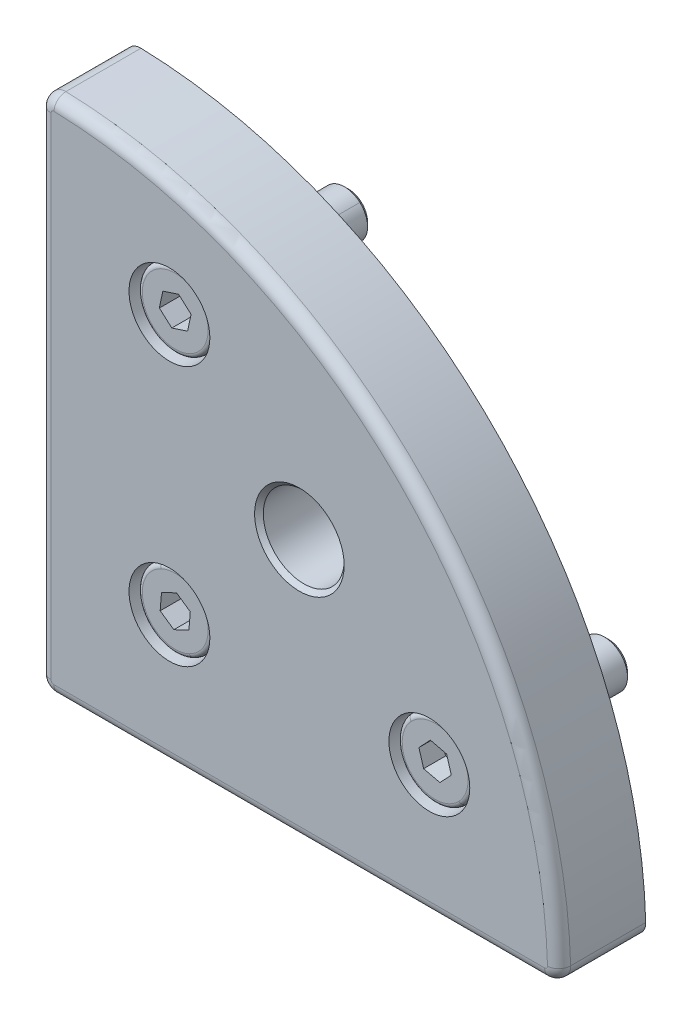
ISO-10303-21;
HEADER;
FILE_DESCRIPTION(('STEP AP214'),'2;1');
FILE_NAME('part.step','',(''),(''),'','','');
FILE_SCHEMA(('AUTOMOTIVE_DESIGN { 1 0 10303 214 1 1 1 1 }'));
ENDSEC;
DATA;
#1=APPLICATION_CONTEXT('core data for automotive mechanical design processes');
#2=APPLICATION_PROTOCOL_DEFINITION('international standard','automotive_design',2000,#1);
#3=PRODUCT_CONTEXT('',#1,'mechanical');
#4=PRODUCT('Part','Part','',(#3));
#5=PRODUCT_RELATED_PRODUCT_CATEGORY('part','',(#4));
#6=PRODUCT_DEFINITION_FORMATION('','',#4);
#7=PRODUCT_DEFINITION_CONTEXT('part definition',#1,'design');
#8=PRODUCT_DEFINITION('design','',#6,#7);
#9=PRODUCT_DEFINITION_SHAPE('','',#8);
#10=(LENGTH_UNIT() NAMED_UNIT(*) SI_UNIT(.MILLI.,.METRE.));
#11=(NAMED_UNIT(*) PLANE_ANGLE_UNIT() SI_UNIT($,.RADIAN.));
#12=(NAMED_UNIT(*) SI_UNIT($,.STERADIAN.) SOLID_ANGLE_UNIT());
#13=UNCERTAINTY_MEASURE_WITH_UNIT(LENGTH_MEASURE(1.E-05),#10,'distance_accuracy_value','');
#14=(GEOMETRIC_REPRESENTATION_CONTEXT(3) GLOBAL_UNCERTAINTY_ASSIGNED_CONTEXT((#13)) GLOBAL_UNIT_ASSIGNED_CONTEXT((#10,
#11,#12)) REPRESENTATION_CONTEXT('',''));
#15=CARTESIAN_POINT('',(0.,0.,0.));
#16=DIRECTION('',(0.,0.,1.));
#17=DIRECTION('',(1.,0.,0.));
#18=AXIS2_PLACEMENT_3D('',#15,#16,#17);
#19=CARTESIAN_POINT('',(-23.4140656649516,28.8549941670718,-1.11359000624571));
#20=DIRECTION('',(0.,0.,1.));
#21=DIRECTION('',(0.66714668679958,0.744926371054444,0.));
#22=AXIS2_PLACEMENT_3D('',#19,#20,#21);
#23=CONICAL_SURFACE('',#22,2.5,1.0471975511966);
#24=DIRECTION('',(-0.577765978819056,-0.6451251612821,0.5));
#25=VECTOR('',#24,1.);
#26=CARTESIAN_POINT('',(-25.0819323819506,26.9926782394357,-1.11359000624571));
#27=LINE('',#26,#25);
#28=CARTESIAN_POINT('',(-23.4140656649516,28.8549941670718,-2.55696567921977));
#29=VERTEX_POINT('',#28);
#30=CARTESIAN_POINT('',(-25.0819323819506,26.9926782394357,-1.11359000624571));
#31=VERTEX_POINT('',#30);
#32=EDGE_CURVE('P0_E333',#29,#31,#27,.T.);
#33=ORIENTED_EDGE('',*,*,#32,.F.);
#34=DIRECTION('',(0.577765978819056,0.6451251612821,0.5));
#35=VECTOR('',#34,1.);
#36=CARTESIAN_POINT('',(-21.7461989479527,30.7173100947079,-1.11359000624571));
#37=LINE('',#36,#35);
#38=CARTESIAN_POINT('',(-21.7461989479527,30.7173100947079,-1.11359000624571));
#39=VERTEX_POINT('',#38);
#40=EDGE_CURVE('P0_E336',#29,#39,#37,.T.);
#41=ORIENTED_EDGE('',*,*,#40,.T.);
#42=CARTESIAN_POINT('',(-23.4140656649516,28.8549941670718,-1.11359000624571));
#43=DIRECTION('',(0.,0.,1.));
#44=DIRECTION('',(0.66714668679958,0.744926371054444,0.));
#45=AXIS2_PLACEMENT_3D('',#42,#43,#44);
#46=CIRCLE('',#45,2.5);
#47=CARTESIAN_POINT('',(-24.1929452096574,31.2305670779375,-1.11359000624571));
#48=VERTEX_POINT('',#47);
#49=EDGE_CURVE('P0_E10',#39,#48,#46,.T.);
#50=ORIENTED_EDGE('',*,*,#49,.T.);
#51=CARTESIAN_POINT('',(-23.4140656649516,28.8549941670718,-1.11359000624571));
#52=DIRECTION('',(0.,0.,1.));
#53=DIRECTION('',(0.66714668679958,0.744926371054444,0.));
#54=AXIS2_PLACEMENT_3D('',#51,#52,#53);
#55=CIRCLE('',#54,2.5);
#56=CARTESIAN_POINT('',(-25.8608119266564,29.3682511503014,-1.11359000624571));
#57=VERTEX_POINT('',#56);
#58=EDGE_CURVE('P0_E26',#48,#57,#55,.T.);
#59=ORIENTED_EDGE('',*,*,#58,.T.);
#60=CARTESIAN_POINT('',(-23.4140656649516,28.8549941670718,-1.11359000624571));
#61=DIRECTION('',(0.,0.,1.));
#62=DIRECTION('',(0.66714668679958,0.744926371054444,0.));
#63=AXIS2_PLACEMENT_3D('',#60,#61,#62);
#64=CIRCLE('',#63,2.5);
#65=EDGE_CURVE('P0_E19',#57,#31,#64,.T.);
#66=ORIENTED_EDGE('',*,*,#65,.T.);
#67=EDGE_LOOP('',(#33,#41,#50,#59,#66));
#68=FACE_BOUND('',#67,.T.);
#69=ADVANCED_FACE('P0_F16',(#68),#23,.F.);
#70=CARTESIAN_POINT('',(-22.8214075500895,31.6802533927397,-1.11359000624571));
#71=DIRECTION('',(0.,0.,1.));
#72=DIRECTION('',(0.66714668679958,0.744926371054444,0.));
#73=AXIS2_PLACEMENT_3D('',#70,#71,#72);
#74=PLANE('',#73);
#75=ORIENTED_EDGE('',*,*,#49,.F.);
#76=DIRECTION('',(-0.744926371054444,0.66714668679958,0.));
#77=VECTOR('',#76,1.);
#78=CARTESIAN_POINT('',(-20.6709903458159,29.7543667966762,-1.11359000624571));
#79=LINE('',#78,#77);
#80=CARTESIAN_POINT('',(-22.8214075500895,31.6802533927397,-1.11359000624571));
#81=VERTEX_POINT('',#80);
#82=EDGE_CURVE('P0_E294',#39,#81,#79,.T.);
#83=ORIENTED_EDGE('',*,*,#82,.T.);
#84=DIRECTION('',(0.95022916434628,0.311551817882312,0.));
#85=VECTOR('',#84,1.);
#86=CARTESIAN_POINT('',(-25.5644828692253,30.7808807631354,-1.11359000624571));
#87=LINE('',#86,#85);
#88=EDGE_CURVE('P0_E275',#48,#81,#87,.T.);
#89=ORIENTED_EDGE('',*,*,#88,.F.);
#90=EDGE_LOOP('',(#75,#83,#89));
#91=FACE_BOUND('',#90,.T.);
#92=ADVANCED_FACE('P0_F598',(#91),#74,.T.);
#93=CARTESIAN_POINT('',(-22.8214075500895,31.6802533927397,-1.11359000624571));
#94=DIRECTION('',(0.,0.,1.));
#95=DIRECTION('',(0.66714668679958,0.744926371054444,0.));
#96=AXIS2_PLACEMENT_3D('',#93,#94,#95);
#97=PLANE('',#96);
#98=ORIENTED_EDGE('',*,*,#58,.F.);
#99=DIRECTION('',(0.95022916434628,0.311551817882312,0.));
#100=VECTOR('',#99,1.);
#101=CARTESIAN_POINT('',(-25.5644828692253,30.7808807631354,-1.11359000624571));
#102=LINE('',#101,#100);
#103=CARTESIAN_POINT('',(-25.5644828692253,30.7808807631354,-1.11359000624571));
#104=VERTEX_POINT('',#103);
#105=EDGE_CURVE('P0_E271',#104,#48,#102,.T.);
#106=ORIENTED_EDGE('',*,*,#105,.F.);
#107=DIRECTION('',(-0.205302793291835,-0.978698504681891,0.));
#108=VECTOR('',#107,1.);
#109=CARTESIAN_POINT('',(-25.5644828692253,30.7808807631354,-1.11359000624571));
#110=LINE('',#109,#108);
#111=EDGE_CURVE('P0_E207',#104,#57,#110,.T.);
#112=ORIENTED_EDGE('',*,*,#111,.T.);
#113=EDGE_LOOP('',(#98,#106,#112));
#114=FACE_BOUND('',#113,.T.);
#115=ADVANCED_FACE('P0_F599',(#114),#97,.T.);
#116=CARTESIAN_POINT('',(-22.8214075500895,31.6802533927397,-1.11359000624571));
#117=DIRECTION('',(0.,0.,1.));
#118=DIRECTION('',(0.66714668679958,0.744926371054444,0.));
#119=AXIS2_PLACEMENT_3D('',#116,#117,#118);
#120=PLANE('',#119);
#121=ORIENTED_EDGE('',*,*,#65,.F.);
#122=DIRECTION('',(-0.205302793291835,-0.978698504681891,0.));
#123=VECTOR('',#122,1.);
#124=CARTESIAN_POINT('',(-25.5644828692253,30.7808807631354,-1.11359000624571));
#125=LINE('',#124,#123);
#126=CARTESIAN_POINT('',(-26.1571409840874,27.9556215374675,-1.11359000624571));
#127=VERTEX_POINT('',#126);
#128=EDGE_CURVE('P0_E205',#57,#127,#125,.T.);
#129=ORIENTED_EDGE('',*,*,#128,.T.);
#130=DIRECTION('',(0.744926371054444,-0.66714668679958,0.));
#131=VECTOR('',#130,1.);
#132=CARTESIAN_POINT('',(-26.1571409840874,27.9556215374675,-1.11359000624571));
#133=LINE('',#132,#131);
#134=EDGE_CURVE('P0_E175',#127,#31,#133,.T.);
#135=ORIENTED_EDGE('',*,*,#134,.T.);
#136=EDGE_LOOP('',(#121,#129,#135));
#137=FACE_BOUND('',#136,.T.);
#138=ADVANCED_FACE('P0_F609',(#137),#120,.T.);
#139=CARTESIAN_POINT('',(-22.8214075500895,31.6802533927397,-1.11359000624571));
#140=DIRECTION('',(0.,0.,1.));
#141=DIRECTION('',(0.66714668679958,0.744926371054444,0.));
#142=AXIS2_PLACEMENT_3D('',#139,#140,#141);
#143=PLANE('',#142);
#144=CARTESIAN_POINT('',(-23.4140656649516,28.8549941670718,-1.11359000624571));
#145=DIRECTION('',(0.,0.,1.));
#146=DIRECTION('',(0.66714668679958,0.744926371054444,0.));
#147=AXIS2_PLACEMENT_3D('',#144,#145,#146);
#148=CIRCLE('',#147,2.5);
#149=CARTESIAN_POINT('',(-22.6351861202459,26.4794212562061,-1.11359000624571));
#150=VERTEX_POINT('',#149);
#151=EDGE_CURVE('P0_E170',#31,#150,#148,.T.);
#152=ORIENTED_EDGE('',*,*,#151,.F.);
#153=DIRECTION('',(0.744926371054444,-0.66714668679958,0.));
#154=VECTOR('',#153,1.);
#155=CARTESIAN_POINT('',(-26.1571409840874,27.9556215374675,-1.11359000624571));
#156=LINE('',#155,#154);
#157=CARTESIAN_POINT('',(-24.0067237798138,26.029734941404,-1.11359000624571));
#158=VERTEX_POINT('',#157);
#159=EDGE_CURVE('P0_E163',#31,#158,#156,.T.);
#160=ORIENTED_EDGE('',*,*,#159,.T.);
#161=DIRECTION('',(-0.95022916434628,-0.311551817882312,0.));
#162=VECTOR('',#161,1.);
#163=CARTESIAN_POINT('',(-21.263648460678,26.9291075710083,-1.11359000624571));
#164=LINE('',#163,#162);
#165=EDGE_CURVE('P0_E167',#150,#158,#164,.T.);
#166=ORIENTED_EDGE('',*,*,#165,.F.);
#167=EDGE_LOOP('',(#152,#160,#166));
#168=FACE_BOUND('',#167,.T.);
#169=ADVANCED_FACE('P0_F165',(#168),#143,.T.);
#170=CARTESIAN_POINT('',(-22.8214075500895,31.6802533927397,-1.11359000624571));
#171=DIRECTION('',(0.,0.,1.));
#172=DIRECTION('',(0.66714668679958,0.744926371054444,0.));
#173=AXIS2_PLACEMENT_3D('',#170,#171,#172);
#174=PLANE('',#173);
#175=CARTESIAN_POINT('',(-23.4140656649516,28.8549941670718,-1.11359000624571));
#176=DIRECTION('',(0.,0.,1.));
#177=DIRECTION('',(0.66714668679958,0.744926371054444,0.));
#178=AXIS2_PLACEMENT_3D('',#175,#176,#177);
#179=CIRCLE('',#178,2.5);
#180=CARTESIAN_POINT('',(-20.9673194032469,28.3417371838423,-1.11359000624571));
#181=VERTEX_POINT('',#180);
#182=EDGE_CURVE('P0_E317',#150,#181,#179,.T.);
#183=ORIENTED_EDGE('',*,*,#182,.F.);
#184=DIRECTION('',(-0.95022916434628,-0.311551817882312,0.));
#185=VECTOR('',#184,1.);
#186=CARTESIAN_POINT('',(-21.263648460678,26.9291075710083,-1.11359000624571));
#187=LINE('',#186,#185);
#188=CARTESIAN_POINT('',(-21.263648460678,26.9291075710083,-1.11359000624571));
#189=VERTEX_POINT('',#188);
#190=EDGE_CURVE('P0_E189',#189,#150,#187,.T.);
#191=ORIENTED_EDGE('',*,*,#190,.F.);
#192=DIRECTION('',(-0.205302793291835,-0.978698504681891,0.));
#193=VECTOR('',#192,1.);
#194=CARTESIAN_POINT('',(-20.6709903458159,29.7543667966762,-1.11359000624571));
#195=LINE('',#194,#193);
#196=EDGE_CURVE('P0_E291',#181,#189,#195,.T.);
#197=ORIENTED_EDGE('',*,*,#196,.F.);
#198=EDGE_LOOP('',(#183,#191,#197));
#199=FACE_BOUND('',#198,.T.);
#200=ADVANCED_FACE('P0_F315',(#199),#174,.T.);
#201=CARTESIAN_POINT('',(-22.8214075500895,31.6802533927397,-1.11359000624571));
#202=DIRECTION('',(0.,0.,1.));
#203=DIRECTION('',(0.66714668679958,0.744926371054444,0.));
#204=AXIS2_PLACEMENT_3D('',#201,#202,#203);
#205=PLANE('',#204);
#206=CARTESIAN_POINT('',(-23.4140656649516,28.8549941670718,-1.11359000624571));
#207=DIRECTION('',(0.,0.,1.));
#208=DIRECTION('',(0.66714668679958,0.744926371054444,0.));
#209=AXIS2_PLACEMENT_3D('',#206,#207,#208);
#210=CIRCLE('',#209,2.5);
#211=EDGE_CURVE('P0_E344',#181,#39,#210,.T.);
#212=ORIENTED_EDGE('',*,*,#211,.F.);
#213=DIRECTION('',(-0.205302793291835,-0.978698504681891,0.));
#214=VECTOR('',#213,1.);
#215=CARTESIAN_POINT('',(-20.6709903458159,29.7543667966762,-1.11359000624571));
#216=LINE('',#215,#214);
#217=CARTESIAN_POINT('',(-20.6709903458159,29.7543667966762,-1.11359000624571));
#218=VERTEX_POINT('',#217);
#219=EDGE_CURVE('P0_E302',#218,#181,#216,.T.);
#220=ORIENTED_EDGE('',*,*,#219,.F.);
#221=DIRECTION('',(-0.744926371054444,0.66714668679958,0.));
#222=VECTOR('',#221,1.);
#223=CARTESIAN_POINT('',(-20.6709903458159,29.7543667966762,-1.11359000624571));
#224=LINE('',#223,#222);
#225=EDGE_CURVE('P0_E297',#218,#39,#224,.T.);
#226=ORIENTED_EDGE('',*,*,#225,.T.);
#227=EDGE_LOOP('',(#212,#220,#226));
#228=FACE_BOUND('',#227,.T.);
#229=ADVANCED_FACE('P0_F590',(#228),#205,.T.);
#230=CARTESIAN_POINT('',(-25.5644828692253,30.7808807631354,-1.11359000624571));
#231=DIRECTION('',(-0.978698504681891,0.205302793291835,0.));
#232=DIRECTION('',(0.,0.,1.));
#233=AXIS2_PLACEMENT_3D('',#230,#231,#232);
#234=PLANE('',#233);
#235=DIRECTION('',(-0.205302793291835,-0.978698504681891,0.));
#236=VECTOR('',#235,1.);
#237=CARTESIAN_POINT('',(-25.5644828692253,30.7808807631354,2.68640999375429));
#238=LINE('',#237,#236);
#239=CARTESIAN_POINT('',(-25.5644828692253,30.7808807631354,2.68640999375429));
#240=VERTEX_POINT('',#239);
#241=CARTESIAN_POINT('',(-26.1571409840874,27.9556215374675,2.68640999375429));
#242=VERTEX_POINT('',#241);
#243=EDGE_CURVE('P0_E260',#240,#242,#238,.T.);
#244=ORIENTED_EDGE('',*,*,#243,.T.);
#245=DIRECTION('',(0.,0.,1.));
#246=VECTOR('',#245,1.);
#247=CARTESIAN_POINT('',(-26.1571409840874,27.9556215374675,-1.11359000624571));
#248=LINE('',#247,#246);
#249=EDGE_CURVE('P0_E203',#127,#242,#248,.T.);
#250=ORIENTED_EDGE('',*,*,#249,.F.);
#251=ORIENTED_EDGE('',*,*,#128,.F.);
#252=ORIENTED_EDGE('',*,*,#111,.F.);
#253=DIRECTION('',(0.,0.,1.));
#254=VECTOR('',#253,1.);
#255=CARTESIAN_POINT('',(-25.5644828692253,30.7808807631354,-1.11359000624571));
#256=LINE('',#255,#254);
#257=EDGE_CURVE('P0_E276',#104,#240,#256,.T.);
#258=ORIENTED_EDGE('',*,*,#257,.T.);
#259=EDGE_LOOP('',(#244,#250,#251,#252,#258));
#260=FACE_BOUND('',#259,.T.);
#261=ADVANCED_FACE('P0_F606',(#260),#234,.F.);
#262=CARTESIAN_POINT('',(-26.1571409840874,27.9556215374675,-1.11359000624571));
#263=DIRECTION('',(-0.66714668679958,-0.744926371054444,0.));
#264=DIRECTION('',(0.744926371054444,-0.66714668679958,0.));
#265=AXIS2_PLACEMENT_3D('',#262,#263,#264);
#266=PLANE('',#265);
#267=DIRECTION('',(0.744926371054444,-0.66714668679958,0.));
#268=VECTOR('',#267,1.);
#269=CARTESIAN_POINT('',(-26.1571409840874,27.9556215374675,2.68640999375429));
#270=LINE('',#269,#268);
#271=CARTESIAN_POINT('',(-24.0067237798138,26.029734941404,2.68640999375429));
#272=VERTEX_POINT('',#271);
#273=EDGE_CURVE('P0_E181',#242,#272,#270,.T.);
#274=ORIENTED_EDGE('',*,*,#273,.T.);
#275=DIRECTION('',(0.,0.,1.));
#276=VECTOR('',#275,1.);
#277=CARTESIAN_POINT('',(-24.0067237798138,26.029734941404,-1.11359000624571));
#278=LINE('',#277,#276);
#279=EDGE_CURVE('P0_E176',#158,#272,#278,.T.);
#280=ORIENTED_EDGE('',*,*,#279,.F.);
#281=ORIENTED_EDGE('',*,*,#159,.F.);
#282=ORIENTED_EDGE('',*,*,#134,.F.);
#283=ORIENTED_EDGE('',*,*,#249,.T.);
#284=EDGE_LOOP('',(#274,#280,#281,#282,#283));
#285=FACE_BOUND('',#284,.T.);
#286=ADVANCED_FACE('P0_F179',(#285),#266,.F.);
#287=CARTESIAN_POINT('',(-21.263648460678,26.9291075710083,-1.11359000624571));
#288=DIRECTION('',(-0.311551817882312,0.95022916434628,0.));
#289=DIRECTION('',(0.,0.,-1.));
#290=AXIS2_PLACEMENT_3D('',#287,#288,#289);
#291=PLANE('',#290);
#292=DIRECTION('',(-0.95022916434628,-0.311551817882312,0.));
#293=VECTOR('',#292,1.);
#294=CARTESIAN_POINT('',(-21.263648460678,26.9291075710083,2.68640999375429));
#295=LINE('',#294,#293);
#296=CARTESIAN_POINT('',(-21.263648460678,26.9291075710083,2.68640999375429));
#297=VERTEX_POINT('',#296);
#298=EDGE_CURVE('P0_E254',#297,#272,#295,.T.);
#299=ORIENTED_EDGE('',*,*,#298,.F.);
#300=DIRECTION('',(0.,0.,1.));
#301=VECTOR('',#300,1.);
#302=CARTESIAN_POINT('',(-21.263648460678,26.9291075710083,-1.11359000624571));
#303=LINE('',#302,#301);
#304=EDGE_CURVE('P0_E197',#189,#297,#303,.T.);
#305=ORIENTED_EDGE('',*,*,#304,.F.);
#306=ORIENTED_EDGE('',*,*,#190,.T.);
#307=ORIENTED_EDGE('',*,*,#165,.T.);
#308=ORIENTED_EDGE('',*,*,#279,.T.);
#309=EDGE_LOOP('',(#299,#305,#306,#307,#308));
#310=FACE_BOUND('',#309,.T.);
#311=ADVANCED_FACE('P0_F187',(#310),#291,.T.);
#312=CARTESIAN_POINT('',(-20.6709903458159,29.7543667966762,-1.11359000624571));
#313=DIRECTION('',(-0.978698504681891,0.205302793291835,0.));
#314=DIRECTION('',(0.,0.,1.));
#315=AXIS2_PLACEMENT_3D('',#312,#313,#314);
#316=PLANE('',#315);
#317=DIRECTION('',(-0.205302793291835,-0.978698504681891,0.));
#318=VECTOR('',#317,1.);
#319=CARTESIAN_POINT('',(-20.6709903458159,29.7543667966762,2.68640999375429));
#320=LINE('',#319,#318);
#321=CARTESIAN_POINT('',(-20.6709903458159,29.7543667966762,2.68640999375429));
#322=VERTEX_POINT('',#321);
#323=EDGE_CURVE('P0_E257',#322,#297,#320,.T.);
#324=ORIENTED_EDGE('',*,*,#323,.F.);
#325=DIRECTION('',(0.,0.,1.));
#326=VECTOR('',#325,1.);
#327=CARTESIAN_POINT('',(-20.6709903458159,29.7543667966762,-1.11359000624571));
#328=LINE('',#327,#326);
#329=EDGE_CURVE('P0_E301',#218,#322,#328,.T.);
#330=ORIENTED_EDGE('',*,*,#329,.F.);
#331=ORIENTED_EDGE('',*,*,#219,.T.);
#332=ORIENTED_EDGE('',*,*,#196,.T.);
#333=ORIENTED_EDGE('',*,*,#304,.T.);
#334=EDGE_LOOP('',(#324,#330,#331,#332,#333));
#335=FACE_BOUND('',#334,.T.);
#336=ADVANCED_FACE('P0_F311',(#335),#316,.T.);
#337=CARTESIAN_POINT('',(-20.6709903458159,29.7543667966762,-1.11359000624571));
#338=DIRECTION('',(0.66714668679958,0.744926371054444,0.));
#339=DIRECTION('',(0.744926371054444,-0.66714668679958,0.));
#340=AXIS2_PLACEMENT_3D('',#337,#338,#339);
#341=PLANE('',#340);
#342=DIRECTION('',(-0.744926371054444,0.66714668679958,0.));
#343=VECTOR('',#342,1.);
#344=CARTESIAN_POINT('',(-20.6709903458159,29.7543667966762,2.68640999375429));
#345=LINE('',#344,#343);
#346=CARTESIAN_POINT('',(-22.8214075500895,31.6802533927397,2.68640999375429));
#347=VERTEX_POINT('',#346);
#348=EDGE_CURVE('P0_E251',#322,#347,#345,.T.);
#349=ORIENTED_EDGE('',*,*,#348,.T.);
#350=DIRECTION('',(0.,0.,1.));
#351=VECTOR('',#350,1.);
#352=CARTESIAN_POINT('',(-22.8214075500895,31.6802533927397,-1.11359000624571));
#353=LINE('',#352,#351);
#354=EDGE_CURVE('P0_E288',#81,#347,#353,.T.);
#355=ORIENTED_EDGE('',*,*,#354,.F.);
#356=ORIENTED_EDGE('',*,*,#82,.F.);
#357=ORIENTED_EDGE('',*,*,#225,.F.);
#358=ORIENTED_EDGE('',*,*,#329,.T.);
#359=EDGE_LOOP('',(#349,#355,#356,#357,#358));
#360=FACE_BOUND('',#359,.T.);
#361=ADVANCED_FACE('P0_F595',(#360),#341,.F.);
#362=CARTESIAN_POINT('',(-25.5644828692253,30.7808807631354,-1.11359000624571));
#363=DIRECTION('',(0.311551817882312,-0.95022916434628,0.));
#364=DIRECTION('',(-0.95022916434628,-0.311551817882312,0.));
#365=AXIS2_PLACEMENT_3D('',#362,#363,#364);
#366=PLANE('',#365);
#367=DIRECTION('',(0.95022916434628,0.311551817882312,0.));
#368=VECTOR('',#367,1.);
#369=CARTESIAN_POINT('',(-25.5644828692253,30.7808807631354,2.68640999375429));
#370=LINE('',#369,#368);
#371=EDGE_CURVE('P0_E247',#240,#347,#370,.T.);
#372=ORIENTED_EDGE('',*,*,#371,.F.);
#373=ORIENTED_EDGE('',*,*,#257,.F.);
#374=ORIENTED_EDGE('',*,*,#105,.T.);
#375=ORIENTED_EDGE('',*,*,#88,.T.);
#376=ORIENTED_EDGE('',*,*,#354,.T.);
#377=EDGE_LOOP('',(#372,#373,#374,#375,#376));
#378=FACE_BOUND('',#377,.T.);
#379=ADVANCED_FACE('P0_F603',(#378),#366,.T.);
#380=CARTESIAN_POINT('',(-23.4140656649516,28.8549941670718,1.88640999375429));
#381=DIRECTION('',(0.,0.,1.));
#382=DIRECTION('',(0.66714668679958,0.744926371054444,0.));
#383=AXIS2_PLACEMENT_3D('',#380,#381,#382);
#384=TOROIDAL_SURFACE('',#383,5.7,0.8);
#385=CARTESIAN_POINT('',(-27.2168017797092,24.6089138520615,1.88640999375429));
#386=DIRECTION('',(-0.744926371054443,0.667146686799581,0.));
#387=DIRECTION('',(0.667146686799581,0.744926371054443,0.));
#388=AXIS2_PLACEMENT_3D('',#385,#386,#387);
#389=CIRCLE('',#388,0.8);
#390=CARTESIAN_POINT('',(-27.7505191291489,24.012972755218,1.88640999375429));
#391=VERTEX_POINT('',#390);
#392=CARTESIAN_POINT('',(-27.2168017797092,24.6089138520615,2.68640999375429));
#393=VERTEX_POINT('',#392);
#394=EDGE_CURVE('P0_E343',#391,#393,#389,.T.);
#395=ORIENTED_EDGE('',*,*,#394,.F.);
#396=CARTESIAN_POINT('',(-23.4140656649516,28.8549941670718,1.88640999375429));
#397=DIRECTION('',(0.,0.,-1.));
#398=DIRECTION('',(0.66714668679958,0.744926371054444,0.));
#399=AXIS2_PLACEMENT_3D('',#396,#397,#398);
#400=CIRCLE('',#399,6.5);
#401=CARTESIAN_POINT('',(-19.0776122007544,33.6970155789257,1.88640999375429));
#402=VERTEX_POINT('',#401);
#403=EDGE_CURVE('P0_E267',#402,#391,#400,.T.);
#404=ORIENTED_EDGE('',*,*,#403,.F.);
#405=CARTESIAN_POINT('',(-19.611329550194,33.1010744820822,1.88640999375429));
#406=DIRECTION('',(0.744926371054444,-0.66714668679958,0.));
#407=DIRECTION('',(-0.66714668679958,-0.744926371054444,0.));
#408=AXIS2_PLACEMENT_3D('',#405,#406,#407);
#409=CIRCLE('',#408,0.8);
#410=CARTESIAN_POINT('',(-19.611329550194,33.1010744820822,2.68640999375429));
#411=VERTEX_POINT('',#410);
#412=EDGE_CURVE('P0_E362',#402,#411,#409,.T.);
#413=ORIENTED_EDGE('',*,*,#412,.T.);
#414=CARTESIAN_POINT('',(-23.4140656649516,28.8549941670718,2.68640999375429));
#415=DIRECTION('',(0.,0.,1.));
#416=DIRECTION('',(0.66714668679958,0.744926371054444,0.));
#417=AXIS2_PLACEMENT_3D('',#414,#415,#416);
#418=CIRCLE('',#417,5.7);
#419=EDGE_CURVE('P0_E244',#393,#411,#418,.T.);
#420=ORIENTED_EDGE('',*,*,#419,.F.);
#421=EDGE_LOOP('',(#395,#404,#413,#420));
#422=FACE_BOUND('',#421,.T.);
#423=ADVANCED_FACE('P0_F640',(#422),#384,.T.);
#424=CARTESIAN_POINT('',(-23.4140656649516,28.8549941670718,-2.71359000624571));
#425=DIRECTION('',(0.,0.,-1.));
#426=DIRECTION('',(-0.66714668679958,-0.744926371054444,0.));
#427=AXIS2_PLACEMENT_3D('',#424,#425,#426);
#428=TOROIDAL_SURFACE('',#427,4.39999999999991,0.4);
#429=CARTESIAN_POINT('',(-20.4786202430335,32.1326701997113,-2.71359000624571));
#430=DIRECTION('',(-0.744926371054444,0.66714668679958,0.));
#431=DIRECTION('',(0.66714668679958,0.744926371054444,0.));
#432=AXIS2_PLACEMENT_3D('',#429,#430,#431);
#433=CIRCLE('',#432,0.4);
#434=CARTESIAN_POINT('',(-20.7454789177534,31.8346996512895,-2.71359000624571));
#435=VERTEX_POINT('',#434);
#436=CARTESIAN_POINT('',(-20.4786202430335,32.1326701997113,-2.31359000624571));
#437=VERTEX_POINT('',#436);
#438=EDGE_CURVE('P0_E372',#435,#437,#433,.T.);
#439=ORIENTED_EDGE('',*,*,#438,.F.);
#440=CARTESIAN_POINT('',(-23.4140656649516,28.8549941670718,-2.71359000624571));
#441=DIRECTION('',(0.,0.,-1.));
#442=DIRECTION('',(-0.66714668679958,-0.744926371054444,0.));
#443=AXIS2_PLACEMENT_3D('',#440,#441,#442);
#444=CIRCLE('',#443,3.99999999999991);
#445=CARTESIAN_POINT('',(-26.0826524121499,25.8752886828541,-2.71359000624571));
#446=VERTEX_POINT('',#445);
#447=EDGE_CURVE('P0_E227',#446,#435,#444,.T.);
#448=ORIENTED_EDGE('',*,*,#447,.F.);
#449=CARTESIAN_POINT('',(-26.3495110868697,25.5773181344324,-2.71359000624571));
#450=DIRECTION('',(0.744926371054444,-0.66714668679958,0.));
#451=DIRECTION('',(-0.66714668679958,-0.744926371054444,0.));
#452=AXIS2_PLACEMENT_3D('',#449,#450,#451);
#453=CIRCLE('',#452,0.4);
#454=CARTESIAN_POINT('',(-26.3495110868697,25.5773181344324,-2.31359000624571));
#455=VERTEX_POINT('',#454);
#456=EDGE_CURVE('P0_E354',#446,#455,#453,.T.);
#457=ORIENTED_EDGE('',*,*,#456,.T.);
#458=CARTESIAN_POINT('',(-23.4140656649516,28.8549941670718,-2.31359000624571));
#459=DIRECTION('',(0.,0.,1.));
#460=DIRECTION('',(-0.66714668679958,-0.744926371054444,0.));
#461=AXIS2_PLACEMENT_3D('',#458,#459,#460);
#462=CIRCLE('',#461,4.39999999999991);
#463=EDGE_CURVE('P0_E270',#437,#455,#462,.T.);
#464=ORIENTED_EDGE('',*,*,#463,.F.);
#465=EDGE_LOOP('',(#439,#448,#457,#464));
#466=FACE_BOUND('',#465,.T.);
#467=ADVANCED_FACE('P0_F643',(#466),#428,.F.);
#468=CARTESIAN_POINT('',(-25.8793994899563,31.062916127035,-27.3135900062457));
#469=DIRECTION('',(0.,0.,-1.));
#470=DIRECTION('',(-0.744926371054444,0.66714668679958,0.));
#471=AXIS2_PLACEMENT_3D('',#468,#469,#470);
#472=PLANE('',#471);
#473=CARTESIAN_POINT('',(-23.4140656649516,28.8549941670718,-27.3135900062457));
#474=DIRECTION('',(0.,0.,1.));
#475=DIRECTION('',(0.66714668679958,0.744926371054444,0.));
#476=AXIS2_PLACEMENT_3D('',#473,#474,#475);
#477=CIRCLE('',#476,3.3095);
#478=CARTESIAN_POINT('',(-21.2061437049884,31.3203279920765,-27.3135900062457));
#479=VERTEX_POINT('',#478);
#480=CARTESIAN_POINT('',(-25.6219876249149,26.3896603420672,-27.3135900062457));
#481=VERTEX_POINT('',#480);
#482=EDGE_CURVE('P0_E350',#479,#481,#477,.T.);
#483=ORIENTED_EDGE('',*,*,#482,.F.);
#484=CARTESIAN_POINT('',(-23.4140656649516,28.8549941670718,-27.3135900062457));
#485=DIRECTION('',(0.,0.,1.));
#486=DIRECTION('',(0.66714668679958,0.744926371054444,0.));
#487=AXIS2_PLACEMENT_3D('',#484,#485,#486);
#488=CIRCLE('',#487,3.3095);
#489=EDGE_CURVE('P0_E280',#481,#479,#488,.T.);
#490=ORIENTED_EDGE('',*,*,#489,.F.);
#491=EDGE_LOOP('',(#483,#490));
#492=FACE_BOUND('',#491,.T.);
#493=ADVANCED_FACE('P0_F649',(#492),#472,.T.);
#494=CARTESIAN_POINT('',(-23.4140656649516,28.8549941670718,-27.3135900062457));
#495=DIRECTION('',(0.,0.,1.));
#496=DIRECTION('',(0.66714668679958,0.744926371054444,0.));
#497=AXIS2_PLACEMENT_3D('',#494,#495,#496);
#498=CONICAL_SURFACE('',#497,3.3095,0.785398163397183);
#499=DIRECTION('',(-0.471743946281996,-0.526742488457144,0.707106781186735));
#500=VECTOR('',#499,1.);
#501=CARTESIAN_POINT('',(-25.6219876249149,26.3896603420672,-27.3135900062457));
#502=LINE('',#501,#500);
#503=CARTESIAN_POINT('',(-26.0826524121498,25.8752886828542,-26.6230900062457));
#504=VERTEX_POINT('',#503);
#505=EDGE_CURVE('P0_E345',#481,#504,#502,.T.);
#506=ORIENTED_EDGE('',*,*,#505,.F.);
#507=ORIENTED_EDGE('',*,*,#489,.T.);
#508=DIRECTION('',(0.471743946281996,0.526742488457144,0.707106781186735));
#509=VECTOR('',#508,1.);
#510=CARTESIAN_POINT('',(-21.2061437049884,31.3203279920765,-27.3135900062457));
#511=LINE('',#510,#509);
#512=CARTESIAN_POINT('',(-20.7454789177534,31.8346996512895,-26.6230900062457));
#513=VERTEX_POINT('',#512);
#514=EDGE_CURVE('P0_E384',#479,#513,#511,.T.);
#515=ORIENTED_EDGE('',*,*,#514,.T.);
#516=CARTESIAN_POINT('',(-23.4140656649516,28.8549941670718,-26.6230900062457));
#517=DIRECTION('',(0.,0.,1.));
#518=DIRECTION('',(0.66714668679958,0.744926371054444,0.));
#519=AXIS2_PLACEMENT_3D('',#516,#517,#518);
#520=CIRCLE('',#519,3.99999999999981);
#521=EDGE_CURVE('P0_E277',#504,#513,#520,.T.);
#522=ORIENTED_EDGE('',*,*,#521,.F.);
#523=EDGE_LOOP('',(#506,#507,#515,#522));
#524=FACE_BOUND('',#523,.T.);
#525=ADVANCED_FACE('P0_F653',(#524),#498,.T.);
#526=CARTESIAN_POINT('',(-23.4140656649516,28.8549941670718,34.4364099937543));
#527=DIRECTION('',(0.,0.,1.));
#528=DIRECTION('',(0.66714668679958,0.744926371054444,0.));
#529=AXIS2_PLACEMENT_3D('',#526,#527,#528);
#530=CYLINDRICAL_SURFACE('',#529,3.99999999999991);
#531=DIRECTION('',(0.,0.,1.));
#532=VECTOR('',#531,1.);
#533=CARTESIAN_POINT('',(-26.0826524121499,25.8752886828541,34.4364099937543));
#534=LINE('',#533,#532);
#535=EDGE_CURVE('P0_E225',#504,#446,#534,.T.);
#536=ORIENTED_EDGE('',*,*,#535,.F.);
#537=ORIENTED_EDGE('',*,*,#521,.T.);
#538=DIRECTION('',(0.,0.,1.));
#539=VECTOR('',#538,1.);
#540=CARTESIAN_POINT('',(-20.7454789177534,31.8346996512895,34.4364099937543));
#541=LINE('',#540,#539);
#542=EDGE_CURVE('P0_E231',#513,#435,#541,.T.);
#543=ORIENTED_EDGE('',*,*,#542,.T.);
#544=CARTESIAN_POINT('',(-23.4140656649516,28.8549941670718,-2.71359000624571));
#545=DIRECTION('',(0.,0.,-1.));
#546=DIRECTION('',(-0.66714668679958,-0.744926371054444,0.));
#547=AXIS2_PLACEMENT_3D('',#544,#545,#546);
#548=CIRCLE('',#547,3.99999999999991);
#549=EDGE_CURVE('P0_E366',#435,#446,#548,.T.);
#550=ORIENTED_EDGE('',*,*,#549,.T.);
#551=EDGE_LOOP('',(#536,#537,#543,#550));
#552=FACE_BOUND('',#551,.T.);
#553=ADVANCED_FACE('P0_F414',(#552),#530,.T.);
#554=CARTESIAN_POINT('',(-28.2560870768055,33.1914476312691,-2.31359000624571));
#555=DIRECTION('',(0.,0.,-1.));
#556=DIRECTION('',(-0.744926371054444,0.66714668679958,0.));
#557=AXIS2_PLACEMENT_3D('',#554,#555,#556);
#558=PLANE('',#557);
#559=CARTESIAN_POINT('',(-23.4140656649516,28.8549941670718,-2.31359000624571));
#560=DIRECTION('',(0.,0.,1.));
#561=DIRECTION('',(-0.66714668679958,-0.744926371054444,0.));
#562=AXIS2_PLACEMENT_3D('',#559,#560,#561);
#563=CIRCLE('',#562,4.39999999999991);
#564=EDGE_CURVE('P0_E376',#455,#437,#563,.T.);
#565=ORIENTED_EDGE('',*,*,#564,.T.);
#566=ORIENTED_EDGE('',*,*,#463,.T.);
#567=EDGE_LOOP('',(#565,#566));
#568=FACE_BOUND('',#567,.T.);
#569=CARTESIAN_POINT('',(-23.4140656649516,28.8549941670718,-2.31359000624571));
#570=DIRECTION('',(0.,0.,1.));
#571=DIRECTION('',(0.66714668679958,0.744926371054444,0.));
#572=AXIS2_PLACEMENT_3D('',#569,#570,#571);
#573=CIRCLE('',#572,6.5);
#574=CARTESIAN_POINT('',(-19.0776122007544,33.6970155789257,-2.31359000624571));
#575=VERTEX_POINT('',#574);
#576=CARTESIAN_POINT('',(-27.7505191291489,24.012972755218,-2.31359000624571));
#577=VERTEX_POINT('',#576);
#578=EDGE_CURVE('P0_E235',#575,#577,#573,.T.);
#579=ORIENTED_EDGE('',*,*,#578,.F.);
#580=CARTESIAN_POINT('',(-23.4140656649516,28.8549941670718,-2.31359000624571));
#581=DIRECTION('',(0.,0.,1.));
#582=DIRECTION('',(0.66714668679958,0.744926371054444,0.));
#583=AXIS2_PLACEMENT_3D('',#580,#581,#582);
#584=CIRCLE('',#583,6.5);
#585=EDGE_CURVE('P0_E264',#577,#575,#584,.T.);
#586=ORIENTED_EDGE('',*,*,#585,.F.);
#587=EDGE_LOOP('',(#579,#586));
#588=FACE_BOUND('',#587,.T.);
#589=ADVANCED_FACE('P0_F659',(#568,#588),#558,.T.);
#590=CARTESIAN_POINT('',(-23.4140656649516,28.8549941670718,34.4364099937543));
#591=DIRECTION('',(0.,0.,1.));
#592=DIRECTION('',(0.66714668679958,0.744926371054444,0.));
#593=AXIS2_PLACEMENT_3D('',#590,#591,#592);
#594=CYLINDRICAL_SURFACE('',#593,6.5);
#595=DIRECTION('',(0.,0.,1.));
#596=VECTOR('',#595,1.);
#597=CARTESIAN_POINT('',(-27.7505191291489,24.012972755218,34.4364099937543));
#598=LINE('',#597,#596);
#599=EDGE_CURVE('P0_E236',#577,#391,#598,.T.);
#600=ORIENTED_EDGE('',*,*,#599,.F.);
#601=ORIENTED_EDGE('',*,*,#585,.T.);
#602=DIRECTION('',(0.,0.,1.));
#603=VECTOR('',#602,1.);
#604=CARTESIAN_POINT('',(-19.0776122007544,33.6970155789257,34.4364099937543));
#605=LINE('',#604,#603);
#606=EDGE_CURVE('P0_E240',#575,#402,#605,.T.);
#607=ORIENTED_EDGE('',*,*,#606,.T.);
#608=ORIENTED_EDGE('',*,*,#403,.T.);
#609=EDGE_LOOP('',(#600,#601,#607,#608));
#610=FACE_BOUND('',#609,.T.);
#611=ADVANCED_FACE('P0_F662',(#610),#594,.T.);
#612=CARTESIAN_POINT('',(-23.4140656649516,28.8549941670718,2.68640999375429));
#613=DIRECTION('',(0.,0.,1.));
#614=DIRECTION('',(0.66714668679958,0.744926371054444,0.));
#615=AXIS2_PLACEMENT_3D('',#612,#613,#614);
#616=PLANE('',#615);
#617=ORIENTED_EDGE('',*,*,#371,.T.);
#618=ORIENTED_EDGE('',*,*,#348,.F.);
#619=ORIENTED_EDGE('',*,*,#323,.T.);
#620=ORIENTED_EDGE('',*,*,#298,.T.);
#621=ORIENTED_EDGE('',*,*,#273,.F.);
#622=ORIENTED_EDGE('',*,*,#243,.F.);
#623=EDGE_LOOP('',(#617,#618,#619,#620,#621,#622));
#624=FACE_BOUND('',#623,.T.);
#625=CARTESIAN_POINT('',(-23.4140656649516,28.8549941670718,2.68640999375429));
#626=DIRECTION('',(0.,0.,1.));
#627=DIRECTION('',(0.66714668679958,0.744926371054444,0.));
#628=AXIS2_PLACEMENT_3D('',#625,#626,#627);
#629=CIRCLE('',#628,5.7);
#630=EDGE_CURVE('P0_E358',#411,#393,#629,.T.);
#631=ORIENTED_EDGE('',*,*,#630,.T.);
#632=ORIENTED_EDGE('',*,*,#419,.T.);
#633=EDGE_LOOP('',(#631,#632));
#634=FACE_BOUND('',#633,.T.);
#635=ADVANCED_FACE('P0_F321',(#624,#634),#616,.T.);
#636=CARTESIAN_POINT('',(-23.4140656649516,28.8549941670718,34.4364099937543));
#637=DIRECTION('',(0.,0.,1.));
#638=DIRECTION('',(0.66714668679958,0.744926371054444,0.));
#639=AXIS2_PLACEMENT_3D('',#636,#637,#638);
#640=CYLINDRICAL_SURFACE('',#639,6.5);
#641=ORIENTED_EDGE('',*,*,#578,.T.);
#642=ORIENTED_EDGE('',*,*,#599,.T.);
#643=CARTESIAN_POINT('',(-23.4140656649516,28.8549941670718,1.88640999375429));
#644=DIRECTION('',(0.,0.,-1.));
#645=DIRECTION('',(0.66714668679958,0.744926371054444,0.));
#646=AXIS2_PLACEMENT_3D('',#643,#644,#645);
#647=CIRCLE('',#646,6.5);
#648=EDGE_CURVE('P0_E339',#391,#402,#647,.T.);
#649=ORIENTED_EDGE('',*,*,#648,.T.);
#650=ORIENTED_EDGE('',*,*,#606,.F.);
#651=EDGE_LOOP('',(#641,#642,#649,#650));
#652=FACE_BOUND('',#651,.T.);
#653=ADVANCED_FACE('P0_F669',(#652),#640,.T.);
#654=CARTESIAN_POINT('',(-23.4140656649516,28.8549941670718,34.4364099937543));
#655=DIRECTION('',(0.,0.,1.));
#656=DIRECTION('',(0.66714668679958,0.744926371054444,0.));
#657=AXIS2_PLACEMENT_3D('',#654,#655,#656);
#658=CYLINDRICAL_SURFACE('',#657,3.99999999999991);
#659=CARTESIAN_POINT('',(-23.4140656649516,28.8549941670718,-26.6230900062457));
#660=DIRECTION('',(0.,0.,1.));
#661=DIRECTION('',(0.66714668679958,0.744926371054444,0.));
#662=AXIS2_PLACEMENT_3D('',#659,#660,#661);
#663=CIRCLE('',#662,3.99999999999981);
#664=EDGE_CURVE('P0_E349',#513,#504,#663,.T.);
#665=ORIENTED_EDGE('',*,*,#664,.T.);
#666=ORIENTED_EDGE('',*,*,#535,.T.);
#667=ORIENTED_EDGE('',*,*,#447,.T.);
#668=ORIENTED_EDGE('',*,*,#542,.F.);
#669=EDGE_LOOP('',(#665,#666,#667,#668));
#670=FACE_BOUND('',#669,.T.);
#671=ADVANCED_FACE('P0_F673',(#670),#658,.T.);
#672=CARTESIAN_POINT('',(-23.4140656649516,28.8549941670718,-27.3135900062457));
#673=DIRECTION('',(0.,0.,1.));
#674=DIRECTION('',(0.66714668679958,0.744926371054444,0.));
#675=AXIS2_PLACEMENT_3D('',#672,#673,#674);
#676=CONICAL_SURFACE('',#675,3.3095,0.785398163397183);
#677=ORIENTED_EDGE('',*,*,#482,.T.);
#678=ORIENTED_EDGE('',*,*,#505,.T.);
#679=ORIENTED_EDGE('',*,*,#664,.F.);
#680=ORIENTED_EDGE('',*,*,#514,.F.);
#681=EDGE_LOOP('',(#677,#678,#679,#680));
#682=FACE_BOUND('',#681,.T.);
#683=ADVANCED_FACE('P0_F670',(#682),#676,.T.);
#684=CARTESIAN_POINT('',(-23.4140656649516,28.8549941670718,-2.71359000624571));
#685=DIRECTION('',(0.,0.,-1.));
#686=DIRECTION('',(-0.66714668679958,-0.744926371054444,0.));
#687=AXIS2_PLACEMENT_3D('',#684,#685,#686);
#688=TOROIDAL_SURFACE('',#687,4.39999999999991,0.4);
#689=ORIENTED_EDGE('',*,*,#549,.F.);
#690=ORIENTED_EDGE('',*,*,#438,.T.);
#691=ORIENTED_EDGE('',*,*,#564,.F.);
#692=ORIENTED_EDGE('',*,*,#456,.F.);
#693=EDGE_LOOP('',(#689,#690,#691,#692));
#694=FACE_BOUND('',#693,.T.);
#695=ADVANCED_FACE('P0_F417',(#694),#688,.F.);
#696=CARTESIAN_POINT('',(-23.4140656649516,28.8549941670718,1.88640999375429));
#697=DIRECTION('',(0.,0.,1.));
#698=DIRECTION('',(0.66714668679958,0.744926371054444,0.));
#699=AXIS2_PLACEMENT_3D('',#696,#697,#698);
#700=TOROIDAL_SURFACE('',#699,5.7,0.8);
#701=ORIENTED_EDGE('',*,*,#648,.F.);
#702=ORIENTED_EDGE('',*,*,#394,.T.);
#703=ORIENTED_EDGE('',*,*,#630,.F.);
#704=ORIENTED_EDGE('',*,*,#412,.F.);
#705=EDGE_LOOP('',(#701,#702,#703,#704));
#706=FACE_BOUND('',#705,.T.);
#707=ADVANCED_FACE('P0_F680',(#706),#700,.T.);
#708=CARTESIAN_POINT('',(-23.4140656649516,28.8549941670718,-1.11359000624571));
#709=DIRECTION('',(0.,0.,1.));
#710=DIRECTION('',(0.66714668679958,0.744926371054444,0.));
#711=AXIS2_PLACEMENT_3D('',#708,#709,#710);
#712=CONICAL_SURFACE('',#711,2.5,1.0471975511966);
#713=ORIENTED_EDGE('',*,*,#40,.F.);
#714=ORIENTED_EDGE('',*,*,#32,.T.);
#715=ORIENTED_EDGE('',*,*,#151,.T.);
#716=ORIENTED_EDGE('',*,*,#182,.T.);
#717=ORIENTED_EDGE('',*,*,#211,.T.);
#718=EDGE_LOOP('',(#713,#714,#715,#716,#717));
#719=FACE_BOUND('',#718,.T.);
#720=ADVANCED_FACE('P0_F588',(#719),#712,.F.);
#721=CLOSED_SHELL('',(#69,#92,#115,#138,#169,#200,#229,#261,#286,#311,#336,#361,#379,#423,#467,
#493,#525,#553,#589,#611,#635,#653,#671,#683,#695,#707,#720));
#722=MANIFOLD_SOLID_BREP('P0_B1',#721);
#723=CARTESIAN_POINT('',(-23.4140656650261,-16.1450058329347,-1.11359000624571));
#724=DIRECTION('',(0.,0.,1.));
#725=DIRECTION('',(-0.427399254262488,0.904062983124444,0.));
#726=AXIS2_PLACEMENT_3D('',#723,#724,#725);
#727=CONICAL_SURFACE('',#726,2.5,1.0471975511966);
#728=DIRECTION('',(0.370138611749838,-0.78294151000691,0.5));
#729=VECTOR('',#728,1.);
#730=CARTESIAN_POINT('',(-22.3455675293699,-18.4051632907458,-1.11359000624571));
#731=LINE('',#730,#729);
#732=CARTESIAN_POINT('',(-23.4140656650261,-16.1450058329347,-2.55696567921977));
#733=VERTEX_POINT('',#732);
#734=CARTESIAN_POINT('',(-22.3455675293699,-18.4051632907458,-1.11359000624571));
#735=VERTEX_POINT('',#734);
#736=EDGE_CURVE('P1_E334',#733,#735,#731,.T.);
#737=ORIENTED_EDGE('',*,*,#736,.F.);
#738=DIRECTION('',(-0.370138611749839,0.78294151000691,0.5));
#739=VECTOR('',#738,1.);
#740=CARTESIAN_POINT('',(-24.4825638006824,-13.8848483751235,-1.11359000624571));
#741=LINE('',#740,#739);
#742=CARTESIAN_POINT('',(-24.4825638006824,-13.8848483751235,-1.11359000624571));
#743=VERTEX_POINT('',#742);
#744=EDGE_CURVE('P1_E337',#733,#743,#741,.T.);
#745=ORIENTED_EDGE('',*,*,#744,.T.);
#746=CARTESIAN_POINT('',(-23.4140656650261,-16.1450058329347,-1.11359000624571));
#747=DIRECTION('',(0.,0.,1.));
#748=DIRECTION('',(-0.427399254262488,0.904062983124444,0.));
#749=AXIS2_PLACEMENT_3D('',#746,#747,#748);
#750=CIRCLE('',#749,2.5);
#751=CARTESIAN_POINT('',(-25.9056685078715,-15.9402736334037,-1.11359000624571));
#752=VERTEX_POINT('',#751);
#753=EDGE_CURVE('P1_E11',#743,#752,#750,.T.);
#754=ORIENTED_EDGE('',*,*,#753,.T.);
#755=CARTESIAN_POINT('',(-23.4140656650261,-16.1450058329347,-1.11359000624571));
#756=DIRECTION('',(0.,0.,1.));
#757=DIRECTION('',(-0.427399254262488,0.904062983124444,0.));
#758=AXIS2_PLACEMENT_3D('',#755,#756,#757);
#759=CIRCLE('',#758,2.5);
#760=CARTESIAN_POINT('',(-24.8371703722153,-18.2004310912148,-1.11359000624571));
#761=VERTEX_POINT('',#760);
#762=EDGE_CURVE('P1_E27',#752,#761,#759,.T.);
#763=ORIENTED_EDGE('',*,*,#762,.T.);
#764=CARTESIAN_POINT('',(-23.4140656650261,-16.1450058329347,-1.11359000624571));
#765=DIRECTION('',(0.,0.,1.));
#766=DIRECTION('',(-0.427399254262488,0.904062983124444,0.));
#767=AXIS2_PLACEMENT_3D('',#764,#765,#766);
#768=CIRCLE('',#767,2.5);
#769=EDGE_CURVE('P1_E20',#761,#735,#768,.T.);
#770=ORIENTED_EDGE('',*,*,#769,.T.);
#771=EDGE_LOOP('',(#737,#745,#754,#763,#770));
#772=FACE_BOUND('',#771,.T.);
#773=ADVANCED_FACE('P1_F17',(#772),#727,.F.);
#774=CARTESIAN_POINT('',(-25.7874663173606,-14.5017460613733,-1.11359000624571));
#775=DIRECTION('',(0.,0.,1.));
#776=DIRECTION('',(-0.427399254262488,0.904062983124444,0.));
#777=AXIS2_PLACEMENT_3D('',#774,#775,#776);
#778=PLANE('',#777);
#779=ORIENTED_EDGE('',*,*,#753,.F.);
#780=DIRECTION('',(-0.904062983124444,-0.427399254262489,0.));
#781=VECTOR('',#780,1.);
#782=CARTESIAN_POINT('',(-23.1776612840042,-13.2679506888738,-1.11359000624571));
#783=LINE('',#782,#781);
#784=CARTESIAN_POINT('',(-25.7874663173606,-14.5017460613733,-1.11359000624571));
#785=VERTEX_POINT('',#784);
#786=EDGE_CURVE('P1_E295',#743,#785,#783,.T.);
#787=ORIENTED_EDGE('',*,*,#786,.T.);
#788=DIRECTION('',(0.0818928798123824,0.996641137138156,0.));
#789=VECTOR('',#788,1.);
#790=CARTESIAN_POINT('',(-26.0238706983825,-17.3788012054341,-1.11359000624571));
#791=LINE('',#790,#789);
#792=EDGE_CURVE('P1_E276',#752,#785,#791,.T.);
#793=ORIENTED_EDGE('',*,*,#792,.F.);
#794=EDGE_LOOP('',(#779,#787,#793));
#795=FACE_BOUND('',#794,.T.);
#796=ADVANCED_FACE('P1_F599',(#795),#778,.T.);
#797=CARTESIAN_POINT('',(-25.7874663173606,-14.5017460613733,-1.11359000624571));
#798=DIRECTION('',(0.,0.,1.));
#799=DIRECTION('',(-0.427399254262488,0.904062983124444,0.));
#800=AXIS2_PLACEMENT_3D('',#797,#798,#799);
#801=PLANE('',#800);
#802=ORIENTED_EDGE('',*,*,#762,.F.);
#803=DIRECTION('',(0.0818928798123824,0.996641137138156,0.));
#804=VECTOR('',#803,1.);
#805=CARTESIAN_POINT('',(-26.0238706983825,-17.3788012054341,-1.11359000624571));
#806=LINE('',#805,#804);
#807=CARTESIAN_POINT('',(-26.0238706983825,-17.3788012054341,-1.11359000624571));
#808=VERTEX_POINT('',#807);
#809=EDGE_CURVE('P1_E272',#808,#752,#806,.T.);
#810=ORIENTED_EDGE('',*,*,#809,.F.);
#811=DIRECTION('',(0.822170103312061,-0.569241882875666,0.));
#812=VECTOR('',#811,1.);
#813=CARTESIAN_POINT('',(-26.0238706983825,-17.3788012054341,-1.11359000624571));
#814=LINE('',#813,#812);
#815=EDGE_CURVE('P1_E208',#808,#761,#814,.T.);
#816=ORIENTED_EDGE('',*,*,#815,.T.);
#817=EDGE_LOOP('',(#802,#810,#816));
#818=FACE_BOUND('',#817,.T.);
#819=ADVANCED_FACE('P1_F600',(#818),#801,.T.);
#820=CARTESIAN_POINT('',(-25.7874663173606,-14.5017460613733,-1.11359000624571));
#821=DIRECTION('',(0.,0.,1.));
#822=DIRECTION('',(-0.427399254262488,0.904062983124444,0.));
#823=AXIS2_PLACEMENT_3D('',#820,#821,#822);
#824=PLANE('',#823);
#825=ORIENTED_EDGE('',*,*,#769,.F.);
#826=DIRECTION('',(0.822170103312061,-0.569241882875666,0.));
#827=VECTOR('',#826,1.);
#828=CARTESIAN_POINT('',(-26.0238706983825,-17.3788012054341,-1.11359000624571));
#829=LINE('',#828,#827);
#830=CARTESIAN_POINT('',(-23.6504700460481,-19.0220609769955,-1.11359000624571));
#831=VERTEX_POINT('',#830);
#832=EDGE_CURVE('P1_E206',#761,#831,#829,.T.);
#833=ORIENTED_EDGE('',*,*,#832,.T.);
#834=DIRECTION('',(0.904062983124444,0.427399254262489,0.));
#835=VECTOR('',#834,1.);
#836=CARTESIAN_POINT('',(-23.6504700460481,-19.0220609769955,-1.11359000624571));
#837=LINE('',#836,#835);
#838=EDGE_CURVE('P1_E176',#831,#735,#837,.T.);
#839=ORIENTED_EDGE('',*,*,#838,.T.);
#840=EDGE_LOOP('',(#825,#833,#839));
#841=FACE_BOUND('',#840,.T.);
#842=ADVANCED_FACE('P1_F610',(#841),#824,.T.);
#843=CARTESIAN_POINT('',(-25.7874663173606,-14.5017460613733,-1.11359000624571));
#844=DIRECTION('',(0.,0.,1.));
#845=DIRECTION('',(-0.427399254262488,0.904062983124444,0.));
#846=AXIS2_PLACEMENT_3D('',#843,#844,#845);
#847=PLANE('',#846);
#848=CARTESIAN_POINT('',(-23.4140656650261,-16.1450058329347,-1.11359000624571));
#849=DIRECTION('',(0.,0.,1.));
#850=DIRECTION('',(-0.427399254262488,0.904062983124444,0.));
#851=AXIS2_PLACEMENT_3D('',#848,#849,#850);
#852=CIRCLE('',#851,2.5);
#853=CARTESIAN_POINT('',(-20.9224628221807,-16.3497380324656,-1.11359000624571));
#854=VERTEX_POINT('',#853);
#855=EDGE_CURVE('P1_E171',#735,#854,#852,.T.);
#856=ORIENTED_EDGE('',*,*,#855,.F.);
#857=DIRECTION('',(0.904062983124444,0.427399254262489,0.));
#858=VECTOR('',#857,1.);
#859=CARTESIAN_POINT('',(-23.6504700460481,-19.0220609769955,-1.11359000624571));
#860=LINE('',#859,#858);
#861=CARTESIAN_POINT('',(-21.0406650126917,-17.788265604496,-1.11359000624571));
#862=VERTEX_POINT('',#861);
#863=EDGE_CURVE('P1_E164',#735,#862,#860,.T.);
#864=ORIENTED_EDGE('',*,*,#863,.T.);
#865=DIRECTION('',(-0.0818928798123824,-0.996641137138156,0.));
#866=VECTOR('',#865,1.);
#867=CARTESIAN_POINT('',(-20.8042606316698,-14.9112104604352,-1.11359000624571));
#868=LINE('',#867,#866);
#869=EDGE_CURVE('P1_E168',#854,#862,#868,.T.);
#870=ORIENTED_EDGE('',*,*,#869,.F.);
#871=EDGE_LOOP('',(#856,#864,#870));
#872=FACE_BOUND('',#871,.T.);
#873=ADVANCED_FACE('P1_F166',(#872),#847,.T.);
#874=CARTESIAN_POINT('',(-25.7874663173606,-14.5017460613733,-1.11359000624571));
#875=DIRECTION('',(0.,0.,1.));
#876=DIRECTION('',(-0.427399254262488,0.904062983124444,0.));
#877=AXIS2_PLACEMENT_3D('',#874,#875,#876);
#878=PLANE('',#877);
#879=CARTESIAN_POINT('',(-23.4140656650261,-16.1450058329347,-1.11359000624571));
#880=DIRECTION('',(0.,0.,1.));
#881=DIRECTION('',(-0.427399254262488,0.904062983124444,0.));
#882=AXIS2_PLACEMENT_3D('',#879,#880,#881);
#883=CIRCLE('',#882,2.5);
#884=CARTESIAN_POINT('',(-21.990960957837,-14.0895805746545,-1.11359000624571));
#885=VERTEX_POINT('',#884);
#886=EDGE_CURVE('P1_E318',#854,#885,#883,.T.);
#887=ORIENTED_EDGE('',*,*,#886,.F.);
#888=DIRECTION('',(-0.0818928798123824,-0.996641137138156,0.));
#889=VECTOR('',#888,1.);
#890=CARTESIAN_POINT('',(-20.8042606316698,-14.9112104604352,-1.11359000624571));
#891=LINE('',#890,#889);
#892=CARTESIAN_POINT('',(-20.8042606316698,-14.9112104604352,-1.11359000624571));
#893=VERTEX_POINT('',#892);
#894=EDGE_CURVE('P1_E190',#893,#854,#891,.T.);
#895=ORIENTED_EDGE('',*,*,#894,.F.);
#896=DIRECTION('',(0.822170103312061,-0.569241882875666,0.));
#897=VECTOR('',#896,1.);
#898=CARTESIAN_POINT('',(-23.1776612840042,-13.2679506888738,-1.11359000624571));
#899=LINE('',#898,#897);
#900=EDGE_CURVE('P1_E292',#885,#893,#899,.T.);
#901=ORIENTED_EDGE('',*,*,#900,.F.);
#902=EDGE_LOOP('',(#887,#895,#901));
#903=FACE_BOUND('',#902,.T.);
#904=ADVANCED_FACE('P1_F316',(#903),#878,.T.);
#905=CARTESIAN_POINT('',(-25.7874663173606,-14.5017460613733,-1.11359000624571));
#906=DIRECTION('',(0.,0.,1.));
#907=DIRECTION('',(-0.427399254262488,0.904062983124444,0.));
#908=AXIS2_PLACEMENT_3D('',#905,#906,#907);
#909=PLANE('',#908);
#910=CARTESIAN_POINT('',(-23.4140656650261,-16.1450058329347,-1.11359000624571));
#911=DIRECTION('',(0.,0.,1.));
#912=DIRECTION('',(-0.427399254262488,0.904062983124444,0.));
#913=AXIS2_PLACEMENT_3D('',#910,#911,#912);
#914=CIRCLE('',#913,2.5);
#915=EDGE_CURVE('P1_E345',#885,#743,#914,.T.);
#916=ORIENTED_EDGE('',*,*,#915,.F.);
#917=DIRECTION('',(0.822170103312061,-0.569241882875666,0.));
#918=VECTOR('',#917,1.);
#919=CARTESIAN_POINT('',(-23.1776612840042,-13.2679506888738,-1.11359000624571));
#920=LINE('',#919,#918);
#921=CARTESIAN_POINT('',(-23.1776612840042,-13.2679506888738,-1.11359000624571));
#922=VERTEX_POINT('',#921);
#923=EDGE_CURVE('P1_E303',#922,#885,#920,.T.);
#924=ORIENTED_EDGE('',*,*,#923,.F.);
#925=DIRECTION('',(-0.904062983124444,-0.427399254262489,0.));
#926=VECTOR('',#925,1.);
#927=CARTESIAN_POINT('',(-23.1776612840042,-13.2679506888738,-1.11359000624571));
#928=LINE('',#927,#926);
#929=EDGE_CURVE('P1_E298',#922,#743,#928,.T.);
#930=ORIENTED_EDGE('',*,*,#929,.T.);
#931=EDGE_LOOP('',(#916,#924,#930));
#932=FACE_BOUND('',#931,.T.);
#933=ADVANCED_FACE('P1_F591',(#932),#909,.T.);
#934=CARTESIAN_POINT('',(-26.0238706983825,-17.3788012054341,-1.11359000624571));
#935=DIRECTION('',(-0.569241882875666,-0.822170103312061,0.));
#936=DIRECTION('',(0.,0.,1.));
#937=AXIS2_PLACEMENT_3D('',#934,#935,#936);
#938=PLANE('',#937);
#939=DIRECTION('',(0.822170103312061,-0.569241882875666,0.));
#940=VECTOR('',#939,1.);
#941=CARTESIAN_POINT('',(-26.0238706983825,-17.3788012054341,2.68640999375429));
#942=LINE('',#941,#940);
#943=CARTESIAN_POINT('',(-26.0238706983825,-17.3788012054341,2.68640999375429));
#944=VERTEX_POINT('',#943);
#945=CARTESIAN_POINT('',(-23.6504700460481,-19.0220609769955,2.68640999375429));
#946=VERTEX_POINT('',#945);
#947=EDGE_CURVE('P1_E261',#944,#946,#942,.T.);
#948=ORIENTED_EDGE('',*,*,#947,.T.);
#949=DIRECTION('',(0.,0.,1.));
#950=VECTOR('',#949,1.);
#951=CARTESIAN_POINT('',(-23.6504700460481,-19.0220609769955,-1.11359000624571));
#952=LINE('',#951,#950);
#953=EDGE_CURVE('P1_E204',#831,#946,#952,.T.);
#954=ORIENTED_EDGE('',*,*,#953,.F.);
#955=ORIENTED_EDGE('',*,*,#832,.F.);
#956=ORIENTED_EDGE('',*,*,#815,.F.);
#957=DIRECTION('',(0.,0.,1.));
#958=VECTOR('',#957,1.);
#959=CARTESIAN_POINT('',(-26.0238706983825,-17.3788012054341,-1.11359000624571));
#960=LINE('',#959,#958);
#961=EDGE_CURVE('P1_E277',#808,#944,#960,.T.);
#962=ORIENTED_EDGE('',*,*,#961,.T.);
#963=EDGE_LOOP('',(#948,#954,#955,#956,#962));
#964=FACE_BOUND('',#963,.T.);
#965=ADVANCED_FACE('P1_F607',(#964),#938,.F.);
#966=CARTESIAN_POINT('',(-23.6504700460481,-19.0220609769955,-1.11359000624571));
#967=DIRECTION('',(0.427399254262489,-0.904062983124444,0.));
#968=DIRECTION('',(0.904062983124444,0.427399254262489,0.));
#969=AXIS2_PLACEMENT_3D('',#966,#967,#968);
#970=PLANE('',#969);
#971=DIRECTION('',(0.904062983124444,0.427399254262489,0.));
#972=VECTOR('',#971,1.);
#973=CARTESIAN_POINT('',(-23.6504700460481,-19.0220609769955,2.68640999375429));
#974=LINE('',#973,#972);
#975=CARTESIAN_POINT('',(-21.0406650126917,-17.788265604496,2.68640999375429));
#976=VERTEX_POINT('',#975);
#977=EDGE_CURVE('P1_E182',#946,#976,#974,.T.);
#978=ORIENTED_EDGE('',*,*,#977,.T.);
#979=DIRECTION('',(0.,0.,1.));
#980=VECTOR('',#979,1.);
#981=CARTESIAN_POINT('',(-21.0406650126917,-17.788265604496,-1.11359000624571));
#982=LINE('',#981,#980);
#983=EDGE_CURVE('P1_E177',#862,#976,#982,.T.);
#984=ORIENTED_EDGE('',*,*,#983,.F.);
#985=ORIENTED_EDGE('',*,*,#863,.F.);
#986=ORIENTED_EDGE('',*,*,#838,.F.);
#987=ORIENTED_EDGE('',*,*,#953,.T.);
#988=EDGE_LOOP('',(#978,#984,#985,#986,#987));
#989=FACE_BOUND('',#988,.T.);
#990=ADVANCED_FACE('P1_F180',(#989),#970,.F.);
#991=CARTESIAN_POINT('',(-20.8042606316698,-14.9112104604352,-1.11359000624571));
#992=DIRECTION('',(-0.996641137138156,0.0818928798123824,0.));
#993=DIRECTION('',(0.,0.,-1.));
#994=AXIS2_PLACEMENT_3D('',#991,#992,#993);
#995=PLANE('',#994);
#996=DIRECTION('',(-0.0818928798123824,-0.996641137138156,0.));
#997=VECTOR('',#996,1.);
#998=CARTESIAN_POINT('',(-20.8042606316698,-14.9112104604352,2.68640999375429));
#999=LINE('',#998,#997);
#1000=CARTESIAN_POINT('',(-20.8042606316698,-14.9112104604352,2.68640999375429));
#1001=VERTEX_POINT('',#1000);
#1002=EDGE_CURVE('P1_E255',#1001,#976,#999,.T.);
#1003=ORIENTED_EDGE('',*,*,#1002,.F.);
#1004=DIRECTION('',(0.,0.,1.));
#1005=VECTOR('',#1004,1.);
#1006=CARTESIAN_POINT('',(-20.8042606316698,-14.9112104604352,-1.11359000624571));
#1007=LINE('',#1006,#1005);
#1008=EDGE_CURVE('P1_E198',#893,#1001,#1007,.T.);
#1009=ORIENTED_EDGE('',*,*,#1008,.F.);
#1010=ORIENTED_EDGE('',*,*,#894,.T.);
#1011=ORIENTED_EDGE('',*,*,#869,.T.);
#1012=ORIENTED_EDGE('',*,*,#983,.T.);
#1013=EDGE_LOOP('',(#1003,#1009,#1010,#1011,#1012));
#1014=FACE_BOUND('',#1013,.T.);
#1015=ADVANCED_FACE('P1_F188',(#1014),#995,.T.);
#1016=CARTESIAN_POINT('',(-23.1776612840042,-13.2679506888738,-1.11359000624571));
#1017=DIRECTION('',(-0.569241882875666,-0.822170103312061,0.));
#1018=DIRECTION('',(0.,0.,1.));
#1019=AXIS2_PLACEMENT_3D('',#1016,#1017,#1018);
#1020=PLANE('',#1019);
#1021=DIRECTION('',(0.822170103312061,-0.569241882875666,0.));
#1022=VECTOR('',#1021,1.);
#1023=CARTESIAN_POINT('',(-23.1776612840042,-13.2679506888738,2.68640999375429));
#1024=LINE('',#1023,#1022);
#1025=CARTESIAN_POINT('',(-23.1776612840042,-13.2679506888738,2.68640999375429));
#1026=VERTEX_POINT('',#1025);
#1027=EDGE_CURVE('P1_E258',#1026,#1001,#1024,.T.);
#1028=ORIENTED_EDGE('',*,*,#1027,.F.);
#1029=DIRECTION('',(0.,0.,1.));
#1030=VECTOR('',#1029,1.);
#1031=CARTESIAN_POINT('',(-23.1776612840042,-13.2679506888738,-1.11359000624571));
#1032=LINE('',#1031,#1030);
#1033=EDGE_CURVE('P1_E302',#922,#1026,#1032,.T.);
#1034=ORIENTED_EDGE('',*,*,#1033,.F.);
#1035=ORIENTED_EDGE('',*,*,#923,.T.);
#1036=ORIENTED_EDGE('',*,*,#900,.T.);
#1037=ORIENTED_EDGE('',*,*,#1008,.T.);
#1038=EDGE_LOOP('',(#1028,#1034,#1035,#1036,#1037));
#1039=FACE_BOUND('',#1038,.T.);
#1040=ADVANCED_FACE('P1_F312',(#1039),#1020,.T.);
#1041=CARTESIAN_POINT('',(-23.1776612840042,-13.2679506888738,-1.11359000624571));
#1042=DIRECTION('',(-0.427399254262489,0.904062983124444,0.));
#1043=DIRECTION('',(0.904062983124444,0.427399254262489,0.));
#1044=AXIS2_PLACEMENT_3D('',#1041,#1042,#1043);
#1045=PLANE('',#1044);
#1046=DIRECTION('',(-0.904062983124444,-0.427399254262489,0.));
#1047=VECTOR('',#1046,1.);
#1048=CARTESIAN_POINT('',(-23.1776612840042,-13.2679506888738,2.68640999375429));
#1049=LINE('',#1048,#1047);
#1050=CARTESIAN_POINT('',(-25.7874663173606,-14.5017460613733,2.68640999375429));
#1051=VERTEX_POINT('',#1050);
#1052=EDGE_CURVE('P1_E252',#1026,#1051,#1049,.T.);
#1053=ORIENTED_EDGE('',*,*,#1052,.T.);
#1054=DIRECTION('',(0.,0.,1.));
#1055=VECTOR('',#1054,1.);
#1056=CARTESIAN_POINT('',(-25.7874663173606,-14.5017460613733,-1.11359000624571));
#1057=LINE('',#1056,#1055);
#1058=EDGE_CURVE('P1_E289',#785,#1051,#1057,.T.);
#1059=ORIENTED_EDGE('',*,*,#1058,.F.);
#1060=ORIENTED_EDGE('',*,*,#786,.F.);
#1061=ORIENTED_EDGE('',*,*,#929,.F.);
#1062=ORIENTED_EDGE('',*,*,#1033,.T.);
#1063=EDGE_LOOP('',(#1053,#1059,#1060,#1061,#1062));
#1064=FACE_BOUND('',#1063,.T.);
#1065=ADVANCED_FACE('P1_F596',(#1064),#1045,.F.);
#1066=CARTESIAN_POINT('',(-26.0238706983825,-17.3788012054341,-1.11359000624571));
#1067=DIRECTION('',(0.996641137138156,-0.0818928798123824,0.));
#1068=DIRECTION('',(-0.0818928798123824,-0.996641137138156,0.));
#1069=AXIS2_PLACEMENT_3D('',#1066,#1067,#1068);
#1070=PLANE('',#1069);
#1071=DIRECTION('',(0.0818928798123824,0.996641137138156,0.));
#1072=VECTOR('',#1071,1.);
#1073=CARTESIAN_POINT('',(-26.0238706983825,-17.3788012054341,2.68640999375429));
#1074=LINE('',#1073,#1072);
#1075=EDGE_CURVE('P1_E248',#944,#1051,#1074,.T.);
#1076=ORIENTED_EDGE('',*,*,#1075,.F.);
#1077=ORIENTED_EDGE('',*,*,#961,.F.);
#1078=ORIENTED_EDGE('',*,*,#809,.T.);
#1079=ORIENTED_EDGE('',*,*,#792,.T.);
#1080=ORIENTED_EDGE('',*,*,#1058,.T.);
#1081=EDGE_LOOP('',(#1076,#1077,#1078,#1079,#1080));
#1082=FACE_BOUND('',#1081,.T.);
#1083=ADVANCED_FACE('P1_F604',(#1082),#1070,.T.);
#1084=CARTESIAN_POINT('',(-23.4140656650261,-16.1450058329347,1.88640999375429));
#1085=DIRECTION('',(0.,0.,1.));
#1086=DIRECTION('',(-0.427399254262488,0.904062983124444,0.));
#1087=AXIS2_PLACEMENT_3D('',#1084,#1085,#1086);
#1088=TOROIDAL_SURFACE('',#1087,5.7,0.8);
#1089=CARTESIAN_POINT('',(-20.9778899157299,-21.298164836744,1.88640999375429));
#1090=DIRECTION('',(-0.904062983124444,-0.427399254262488,0.));
#1091=DIRECTION('',(-0.427399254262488,0.904062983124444,0.));
#1092=AXIS2_PLACEMENT_3D('',#1089,#1090,#1091);
#1093=CIRCLE('',#1092,0.8);
#1094=CARTESIAN_POINT('',(-20.63597051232,-22.0214152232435,1.88640999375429));
#1095=VERTEX_POINT('',#1094);
#1096=CARTESIAN_POINT('',(-20.9778899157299,-21.298164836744,2.68640999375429));
#1097=VERTEX_POINT('',#1096);
#1098=EDGE_CURVE('P1_E344',#1095,#1097,#1093,.T.);
#1099=ORIENTED_EDGE('',*,*,#1098,.F.);
#1100=CARTESIAN_POINT('',(-23.4140656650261,-16.1450058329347,1.88640999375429));
#1101=DIRECTION('',(0.,0.,-1.));
#1102=DIRECTION('',(-0.427399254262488,0.904062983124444,0.));
#1103=AXIS2_PLACEMENT_3D('',#1100,#1101,#1102);
#1104=CIRCLE('',#1103,6.5);
#1105=CARTESIAN_POINT('',(-26.1921608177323,-10.2685964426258,1.88640999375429));
#1106=VERTEX_POINT('',#1105);
#1107=EDGE_CURVE('P1_E268',#1106,#1095,#1104,.T.);
#1108=ORIENTED_EDGE('',*,*,#1107,.F.);
#1109=CARTESIAN_POINT('',(-25.8502414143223,-10.9918468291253,1.88640999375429));
#1110=DIRECTION('',(0.904062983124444,0.427399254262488,0.));
#1111=DIRECTION('',(0.427399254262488,-0.904062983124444,0.));
#1112=AXIS2_PLACEMENT_3D('',#1109,#1110,#1111);
#1113=CIRCLE('',#1112,0.8);
#1114=CARTESIAN_POINT('',(-25.8502414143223,-10.9918468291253,2.68640999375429));
#1115=VERTEX_POINT('',#1114);
#1116=EDGE_CURVE('P1_E363',#1106,#1115,#1113,.T.);
#1117=ORIENTED_EDGE('',*,*,#1116,.T.);
#1118=CARTESIAN_POINT('',(-23.4140656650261,-16.1450058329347,2.68640999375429));
#1119=DIRECTION('',(0.,0.,1.));
#1120=DIRECTION('',(-0.427399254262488,0.904062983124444,0.));
#1121=AXIS2_PLACEMENT_3D('',#1118,#1119,#1120);
#1122=CIRCLE('',#1121,5.7);
#1123=EDGE_CURVE('P1_E245',#1097,#1115,#1122,.T.);
#1124=ORIENTED_EDGE('',*,*,#1123,.F.);
#1125=EDGE_LOOP('',(#1099,#1108,#1117,#1124));
#1126=FACE_BOUND('',#1125,.T.);
#1127=ADVANCED_FACE('P1_F641',(#1126),#1088,.T.);
#1128=CARTESIAN_POINT('',(-23.4140656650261,-16.1450058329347,-2.71359000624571));
#1129=DIRECTION('',(0.,0.,-1.));
#1130=DIRECTION('',(0.427399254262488,-0.904062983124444,0.));
#1131=AXIS2_PLACEMENT_3D('',#1128,#1129,#1130);
#1132=TOROIDAL_SURFACE('',#1131,4.39999999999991,0.4);
#1133=CARTESIAN_POINT('',(-25.294622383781,-12.1671287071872,-2.71359000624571));
#1134=DIRECTION('',(-0.904062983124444,-0.427399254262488,0.));
#1135=DIRECTION('',(-0.427399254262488,0.904062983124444,0.));
#1136=AXIS2_PLACEMENT_3D('',#1133,#1134,#1135);
#1137=CIRCLE('',#1136,0.4);
#1138=CARTESIAN_POINT('',(-25.123662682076,-12.528753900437,-2.71359000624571));
#1139=VERTEX_POINT('',#1138);
#1140=CARTESIAN_POINT('',(-25.294622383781,-12.1671287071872,-2.31359000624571));
#1141=VERTEX_POINT('',#1140);
#1142=EDGE_CURVE('P1_E373',#1139,#1141,#1137,.T.);
#1143=ORIENTED_EDGE('',*,*,#1142,.F.);
#1144=CARTESIAN_POINT('',(-23.4140656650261,-16.1450058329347,-2.71359000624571));
#1145=DIRECTION('',(0.,0.,-1.));
#1146=DIRECTION('',(0.427399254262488,-0.904062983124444,0.));
#1147=AXIS2_PLACEMENT_3D('',#1144,#1145,#1146);
#1148=CIRCLE('',#1147,3.99999999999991);
#1149=CARTESIAN_POINT('',(-21.7044686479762,-19.7612577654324,-2.71359000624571));
#1150=VERTEX_POINT('',#1149);
#1151=EDGE_CURVE('P1_E228',#1150,#1139,#1148,.T.);
#1152=ORIENTED_EDGE('',*,*,#1151,.F.);
#1153=CARTESIAN_POINT('',(-21.5335089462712,-20.1228829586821,-2.71359000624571));
#1154=DIRECTION('',(0.904062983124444,0.427399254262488,0.));
#1155=DIRECTION('',(0.427399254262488,-0.904062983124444,0.));
#1156=AXIS2_PLACEMENT_3D('',#1153,#1154,#1155);
#1157=CIRCLE('',#1156,0.4);
#1158=CARTESIAN_POINT('',(-21.5335089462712,-20.1228829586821,-2.31359000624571));
#1159=VERTEX_POINT('',#1158);
#1160=EDGE_CURVE('P1_E355',#1150,#1159,#1157,.T.);
#1161=ORIENTED_EDGE('',*,*,#1160,.T.);
#1162=CARTESIAN_POINT('',(-23.4140656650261,-16.1450058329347,-2.31359000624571));
#1163=DIRECTION('',(0.,0.,1.));
#1164=DIRECTION('',(0.427399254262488,-0.904062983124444,0.));
#1165=AXIS2_PLACEMENT_3D('',#1162,#1163,#1164);
#1166=CIRCLE('',#1165,4.39999999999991);
#1167=EDGE_CURVE('P1_E271',#1141,#1159,#1166,.T.);
#1168=ORIENTED_EDGE('',*,*,#1167,.F.);
#1169=EDGE_LOOP('',(#1143,#1152,#1161,#1168));
#1170=FACE_BOUND('',#1169,.T.);
#1171=ADVANCED_FACE('P1_F644',(#1170),#1132,.F.);
#1172=CARTESIAN_POINT('',(-26.4060621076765,-17.5594836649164,-27.3135900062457));
#1173=DIRECTION('',(0.,0.,-1.));
#1174=DIRECTION('',(-0.904062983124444,-0.427399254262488,0.));
#1175=AXIS2_PLACEMENT_3D('',#1172,#1173,#1174);
#1176=PLANE('',#1175);
#1177=CARTESIAN_POINT('',(-23.4140656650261,-16.1450058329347,-27.3135900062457));
#1178=DIRECTION('',(0.,0.,1.));
#1179=DIRECTION('',(-0.427399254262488,0.904062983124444,0.));
#1180=AXIS2_PLACEMENT_3D('',#1177,#1178,#1179);
#1181=CIRCLE('',#1180,3.3095);
#1182=CARTESIAN_POINT('',(-24.8285434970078,-13.1530093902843,-27.3135900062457));
#1183=VERTEX_POINT('',#1182);
#1184=CARTESIAN_POINT('',(-21.9995878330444,-19.137002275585,-27.3135900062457));
#1185=VERTEX_POINT('',#1184);
#1186=EDGE_CURVE('P1_E351',#1183,#1185,#1181,.T.);
#1187=ORIENTED_EDGE('',*,*,#1186,.F.);
#1188=CARTESIAN_POINT('',(-23.4140656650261,-16.1450058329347,-27.3135900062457));
#1189=DIRECTION('',(0.,0.,1.));
#1190=DIRECTION('',(-0.427399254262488,0.904062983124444,0.));
#1191=AXIS2_PLACEMENT_3D('',#1188,#1189,#1190);
#1192=CIRCLE('',#1191,3.3095);
#1193=EDGE_CURVE('P1_E281',#1185,#1183,#1192,.T.);
#1194=ORIENTED_EDGE('',*,*,#1193,.F.);
#1195=EDGE_LOOP('',(#1187,#1194));
#1196=FACE_BOUND('',#1195,.T.);
#1197=ADVANCED_FACE('P1_F650',(#1196),#1176,.T.);
#1198=CARTESIAN_POINT('',(-23.4140656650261,-16.1450058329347,-27.3135900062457));
#1199=DIRECTION('',(0.,0.,1.));
#1200=DIRECTION('',(-0.427399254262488,0.904062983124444,0.));
#1201=AXIS2_PLACEMENT_3D('',#1198,#1199,#1200);
#1202=CONICAL_SURFACE('',#1201,3.3095,0.785398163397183);
#1203=DIRECTION('',(0.302216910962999,-0.639269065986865,0.707106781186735));
#1204=VECTOR('',#1203,1.);
#1205=CARTESIAN_POINT('',(-21.9995878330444,-19.137002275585,-27.3135900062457));
#1206=LINE('',#1205,#1204);
#1207=CARTESIAN_POINT('',(-21.7044686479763,-19.7612577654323,-26.6230900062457));
#1208=VERTEX_POINT('',#1207);
#1209=EDGE_CURVE('P1_E346',#1185,#1208,#1206,.T.);
#1210=ORIENTED_EDGE('',*,*,#1209,.F.);
#1211=ORIENTED_EDGE('',*,*,#1193,.T.);
#1212=DIRECTION('',(-0.302216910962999,0.639269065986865,0.707106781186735));
#1213=VECTOR('',#1212,1.);
#1214=CARTESIAN_POINT('',(-24.8285434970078,-13.1530093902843,-27.3135900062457));
#1215=LINE('',#1214,#1213);
#1216=CARTESIAN_POINT('',(-25.123662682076,-12.5287539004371,-26.6230900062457));
#1217=VERTEX_POINT('',#1216);
#1218=EDGE_CURVE('P1_E385',#1183,#1217,#1215,.T.);
#1219=ORIENTED_EDGE('',*,*,#1218,.T.);
#1220=CARTESIAN_POINT('',(-23.4140656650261,-16.1450058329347,-26.6230900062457));
#1221=DIRECTION('',(0.,0.,1.));
#1222=DIRECTION('',(-0.427399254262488,0.904062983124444,0.));
#1223=AXIS2_PLACEMENT_3D('',#1220,#1221,#1222);
#1224=CIRCLE('',#1223,3.99999999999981);
#1225=EDGE_CURVE('P1_E278',#1208,#1217,#1224,.T.);
#1226=ORIENTED_EDGE('',*,*,#1225,.F.);
#1227=EDGE_LOOP('',(#1210,#1211,#1219,#1226));
#1228=FACE_BOUND('',#1227,.T.);
#1229=ADVANCED_FACE('P1_F654',(#1228),#1202,.T.);
#1230=CARTESIAN_POINT('',(-23.4140656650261,-16.1450058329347,34.4364099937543));
#1231=DIRECTION('',(0.,0.,1.));
#1232=DIRECTION('',(-0.427399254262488,0.904062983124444,0.));
#1233=AXIS2_PLACEMENT_3D('',#1230,#1231,#1232);
#1234=CYLINDRICAL_SURFACE('',#1233,3.99999999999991);
#1235=DIRECTION('',(0.,0.,1.));
#1236=VECTOR('',#1235,1.);
#1237=CARTESIAN_POINT('',(-21.7044686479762,-19.7612577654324,34.4364099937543));
#1238=LINE('',#1237,#1236);
#1239=EDGE_CURVE('P1_E226',#1208,#1150,#1238,.T.);
#1240=ORIENTED_EDGE('',*,*,#1239,.F.);
#1241=ORIENTED_EDGE('',*,*,#1225,.T.);
#1242=DIRECTION('',(0.,0.,1.));
#1243=VECTOR('',#1242,1.);
#1244=CARTESIAN_POINT('',(-25.123662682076,-12.528753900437,34.4364099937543));
#1245=LINE('',#1244,#1243);
#1246=EDGE_CURVE('P1_E232',#1217,#1139,#1245,.T.);
#1247=ORIENTED_EDGE('',*,*,#1246,.T.);
#1248=CARTESIAN_POINT('',(-23.4140656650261,-16.1450058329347,-2.71359000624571));
#1249=DIRECTION('',(0.,0.,-1.));
#1250=DIRECTION('',(0.427399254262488,-0.904062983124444,0.));
#1251=AXIS2_PLACEMENT_3D('',#1248,#1249,#1250);
#1252=CIRCLE('',#1251,3.99999999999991);
#1253=EDGE_CURVE('P1_E367',#1139,#1150,#1252,.T.);
#1254=ORIENTED_EDGE('',*,*,#1253,.T.);
#1255=EDGE_LOOP('',(#1240,#1241,#1247,#1254));
#1256=FACE_BOUND('',#1255,.T.);
#1257=ADVANCED_FACE('P1_F415',(#1256),#1234,.T.);
#1258=CARTESIAN_POINT('',(-29.290475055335,-18.9231009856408,-2.31359000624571));
#1259=DIRECTION('',(0.,0.,-1.));
#1260=DIRECTION('',(-0.904062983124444,-0.427399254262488,0.));
#1261=AXIS2_PLACEMENT_3D('',#1258,#1259,#1260);
#1262=PLANE('',#1261);
#1263=CARTESIAN_POINT('',(-23.4140656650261,-16.1450058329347,-2.31359000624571));
#1264=DIRECTION('',(0.,0.,1.));
#1265=DIRECTION('',(0.427399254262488,-0.904062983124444,0.));
#1266=AXIS2_PLACEMENT_3D('',#1263,#1264,#1265);
#1267=CIRCLE('',#1266,4.39999999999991);
#1268=EDGE_CURVE('P1_E377',#1159,#1141,#1267,.T.);
#1269=ORIENTED_EDGE('',*,*,#1268,.T.);
#1270=ORIENTED_EDGE('',*,*,#1167,.T.);
#1271=EDGE_LOOP('',(#1269,#1270));
#1272=FACE_BOUND('',#1271,.T.);
#1273=CARTESIAN_POINT('',(-23.4140656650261,-16.1450058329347,-2.31359000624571));
#1274=DIRECTION('',(0.,0.,1.));
#1275=DIRECTION('',(-0.427399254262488,0.904062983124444,0.));
#1276=AXIS2_PLACEMENT_3D('',#1273,#1274,#1275);
#1277=CIRCLE('',#1276,6.5);
#1278=CARTESIAN_POINT('',(-26.1921608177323,-10.2685964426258,-2.31359000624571));
#1279=VERTEX_POINT('',#1278);
#1280=CARTESIAN_POINT('',(-20.63597051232,-22.0214152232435,-2.31359000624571));
#1281=VERTEX_POINT('',#1280);
#1282=EDGE_CURVE('P1_E236',#1279,#1281,#1277,.T.);
#1283=ORIENTED_EDGE('',*,*,#1282,.F.);
#1284=CARTESIAN_POINT('',(-23.4140656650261,-16.1450058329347,-2.31359000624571));
#1285=DIRECTION('',(0.,0.,1.));
#1286=DIRECTION('',(-0.427399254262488,0.904062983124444,0.));
#1287=AXIS2_PLACEMENT_3D('',#1284,#1285,#1286);
#1288=CIRCLE('',#1287,6.5);
#1289=EDGE_CURVE('P1_E265',#1281,#1279,#1288,.T.);
#1290=ORIENTED_EDGE('',*,*,#1289,.F.);
#1291=EDGE_LOOP('',(#1283,#1290));
#1292=FACE_BOUND('',#1291,.T.);
#1293=ADVANCED_FACE('P1_F660',(#1272,#1292),#1262,.T.);
#1294=CARTESIAN_POINT('',(-23.4140656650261,-16.1450058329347,34.4364099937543));
#1295=DIRECTION('',(0.,0.,1.));
#1296=DIRECTION('',(-0.427399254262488,0.904062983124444,0.));
#1297=AXIS2_PLACEMENT_3D('',#1294,#1295,#1296);
#1298=CYLINDRICAL_SURFACE('',#1297,6.5);
#1299=DIRECTION('',(0.,0.,1.));
#1300=VECTOR('',#1299,1.);
#1301=CARTESIAN_POINT('',(-20.63597051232,-22.0214152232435,34.4364099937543));
#1302=LINE('',#1301,#1300);
#1303=EDGE_CURVE('P1_E237',#1281,#1095,#1302,.T.);
#1304=ORIENTED_EDGE('',*,*,#1303,.F.);
#1305=ORIENTED_EDGE('',*,*,#1289,.T.);
#1306=DIRECTION('',(0.,0.,1.));
#1307=VECTOR('',#1306,1.);
#1308=CARTESIAN_POINT('',(-26.1921608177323,-10.2685964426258,34.4364099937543));
#1309=LINE('',#1308,#1307);
#1310=EDGE_CURVE('P1_E241',#1279,#1106,#1309,.T.);
#1311=ORIENTED_EDGE('',*,*,#1310,.T.);
#1312=ORIENTED_EDGE('',*,*,#1107,.T.);
#1313=EDGE_LOOP('',(#1304,#1305,#1311,#1312));
#1314=FACE_BOUND('',#1313,.T.);
#1315=ADVANCED_FACE('P1_F663',(#1314),#1298,.T.);
#1316=CARTESIAN_POINT('',(-23.4140656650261,-16.1450058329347,2.68640999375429));
#1317=DIRECTION('',(0.,0.,1.));
#1318=DIRECTION('',(-0.427399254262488,0.904062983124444,0.));
#1319=AXIS2_PLACEMENT_3D('',#1316,#1317,#1318);
#1320=PLANE('',#1319);
#1321=ORIENTED_EDGE('',*,*,#1075,.T.);
#1322=ORIENTED_EDGE('',*,*,#1052,.F.);
#1323=ORIENTED_EDGE('',*,*,#1027,.T.);
#1324=ORIENTED_EDGE('',*,*,#1002,.T.);
#1325=ORIENTED_EDGE('',*,*,#977,.F.);
#1326=ORIENTED_EDGE('',*,*,#947,.F.);
#1327=EDGE_LOOP('',(#1321,#1322,#1323,#1324,#1325,#1326));
#1328=FACE_BOUND('',#1327,.T.);
#1329=CARTESIAN_POINT('',(-23.4140656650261,-16.1450058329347,2.68640999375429));
#1330=DIRECTION('',(0.,0.,1.));
#1331=DIRECTION('',(-0.427399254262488,0.904062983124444,0.));
#1332=AXIS2_PLACEMENT_3D('',#1329,#1330,#1331);
#1333=CIRCLE('',#1332,5.7);
#1334=EDGE_CURVE('P1_E359',#1115,#1097,#1333,.T.);
#1335=ORIENTED_EDGE('',*,*,#1334,.T.);
#1336=ORIENTED_EDGE('',*,*,#1123,.T.);
#1337=EDGE_LOOP('',(#1335,#1336));
#1338=FACE_BOUND('',#1337,.T.);
#1339=ADVANCED_FACE('P1_F322',(#1328,#1338),#1320,.T.);
#1340=CARTESIAN_POINT('',(-23.4140656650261,-16.1450058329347,34.4364099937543));
#1341=DIRECTION('',(0.,0.,1.));
#1342=DIRECTION('',(-0.427399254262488,0.904062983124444,0.));
#1343=AXIS2_PLACEMENT_3D('',#1340,#1341,#1342);
#1344=CYLINDRICAL_SURFACE('',#1343,6.5);
#1345=ORIENTED_EDGE('',*,*,#1282,.T.);
#1346=ORIENTED_EDGE('',*,*,#1303,.T.);
#1347=CARTESIAN_POINT('',(-23.4140656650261,-16.1450058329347,1.88640999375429));
#1348=DIRECTION('',(0.,0.,-1.));
#1349=DIRECTION('',(-0.427399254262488,0.904062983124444,0.));
#1350=AXIS2_PLACEMENT_3D('',#1347,#1348,#1349);
#1351=CIRCLE('',#1350,6.5);
#1352=EDGE_CURVE('P1_E340',#1095,#1106,#1351,.T.);
#1353=ORIENTED_EDGE('',*,*,#1352,.T.);
#1354=ORIENTED_EDGE('',*,*,#1310,.F.);
#1355=EDGE_LOOP('',(#1345,#1346,#1353,#1354));
#1356=FACE_BOUND('',#1355,.T.);
#1357=ADVANCED_FACE('P1_F670',(#1356),#1344,.T.);
#1358=CARTESIAN_POINT('',(-23.4140656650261,-16.1450058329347,34.4364099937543));
#1359=DIRECTION('',(0.,0.,1.));
#1360=DIRECTION('',(-0.427399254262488,0.904062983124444,0.));
#1361=AXIS2_PLACEMENT_3D('',#1358,#1359,#1360);
#1362=CYLINDRICAL_SURFACE('',#1361,3.99999999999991);
#1363=CARTESIAN_POINT('',(-23.4140656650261,-16.1450058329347,-26.6230900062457));
#1364=DIRECTION('',(0.,0.,1.));
#1365=DIRECTION('',(-0.427399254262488,0.904062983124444,0.));
#1366=AXIS2_PLACEMENT_3D('',#1363,#1364,#1365);
#1367=CIRCLE('',#1366,3.99999999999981);
#1368=EDGE_CURVE('P1_E350',#1217,#1208,#1367,.T.);
#1369=ORIENTED_EDGE('',*,*,#1368,.T.);
#1370=ORIENTED_EDGE('',*,*,#1239,.T.);
#1371=ORIENTED_EDGE('',*,*,#1151,.T.);
#1372=ORIENTED_EDGE('',*,*,#1246,.F.);
#1373=EDGE_LOOP('',(#1369,#1370,#1371,#1372));
#1374=FACE_BOUND('',#1373,.T.);
#1375=ADVANCED_FACE('P1_F674',(#1374),#1362,.T.);
#1376=CARTESIAN_POINT('',(-23.4140656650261,-16.1450058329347,-27.3135900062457));
#1377=DIRECTION('',(0.,0.,1.));
#1378=DIRECTION('',(-0.427399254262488,0.904062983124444,0.));
#1379=AXIS2_PLACEMENT_3D('',#1376,#1377,#1378);
#1380=CONICAL_SURFACE('',#1379,3.3095,0.785398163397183);
#1381=ORIENTED_EDGE('',*,*,#1186,.T.);
#1382=ORIENTED_EDGE('',*,*,#1209,.T.);
#1383=ORIENTED_EDGE('',*,*,#1368,.F.);
#1384=ORIENTED_EDGE('',*,*,#1218,.F.);
#1385=EDGE_LOOP('',(#1381,#1382,#1383,#1384));
#1386=FACE_BOUND('',#1385,.T.);
#1387=ADVANCED_FACE('P1_F671',(#1386),#1380,.T.);
#1388=CARTESIAN_POINT('',(-23.4140656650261,-16.1450058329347,-2.71359000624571));
#1389=DIRECTION('',(0.,0.,-1.));
#1390=DIRECTION('',(0.427399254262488,-0.904062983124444,0.));
#1391=AXIS2_PLACEMENT_3D('',#1388,#1389,#1390);
#1392=TOROIDAL_SURFACE('',#1391,4.39999999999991,0.4);
#1393=ORIENTED_EDGE('',*,*,#1253,.F.);
#1394=ORIENTED_EDGE('',*,*,#1142,.T.);
#1395=ORIENTED_EDGE('',*,*,#1268,.F.);
#1396=ORIENTED_EDGE('',*,*,#1160,.F.);
#1397=EDGE_LOOP('',(#1393,#1394,#1395,#1396));
#1398=FACE_BOUND('',#1397,.T.);
#1399=ADVANCED_FACE('P1_F418',(#1398),#1392,.F.);
#1400=CARTESIAN_POINT('',(-23.4140656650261,-16.1450058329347,1.88640999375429));
#1401=DIRECTION('',(0.,0.,1.));
#1402=DIRECTION('',(-0.427399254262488,0.904062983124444,0.));
#1403=AXIS2_PLACEMENT_3D('',#1400,#1401,#1402);
#1404=TOROIDAL_SURFACE('',#1403,5.7,0.8);
#1405=ORIENTED_EDGE('',*,*,#1352,.F.);
#1406=ORIENTED_EDGE('',*,*,#1098,.T.);
#1407=ORIENTED_EDGE('',*,*,#1334,.F.);
#1408=ORIENTED_EDGE('',*,*,#1116,.F.);
#1409=EDGE_LOOP('',(#1405,#1406,#1407,#1408));
#1410=FACE_BOUND('',#1409,.T.);
#1411=ADVANCED_FACE('P1_F681',(#1410),#1404,.T.);
#1412=CARTESIAN_POINT('',(-23.4140656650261,-16.1450058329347,-1.11359000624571));
#1413=DIRECTION('',(0.,0.,1.));
#1414=DIRECTION('',(-0.427399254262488,0.904062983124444,0.));
#1415=AXIS2_PLACEMENT_3D('',#1412,#1413,#1414);
#1416=CONICAL_SURFACE('',#1415,2.5,1.0471975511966);
#1417=ORIENTED_EDGE('',*,*,#744,.F.);
#1418=ORIENTED_EDGE('',*,*,#736,.T.);
#1419=ORIENTED_EDGE('',*,*,#855,.T.);
#1420=ORIENTED_EDGE('',*,*,#886,.T.);
#1421=ORIENTED_EDGE('',*,*,#915,.T.);
#1422=EDGE_LOOP('',(#1417,#1418,#1419,#1420,#1421));
#1423=FACE_BOUND('',#1422,.T.);
#1424=ADVANCED_FACE('P1_F589',(#1423),#1416,.F.);
#1425=CLOSED_SHELL('',(#773,#796,#819,#842,#873,#904,#933,#965,#990,#1015,#1040,#1065,#1083,
#1127,#1171,#1197,#1229,#1257,#1293,#1315,#1339,#1357,#1375,#1387,#1399,#1411,#1424));
#1426=MANIFOLD_SOLID_BREP('P1_B1',#1425);
#1427=CARTESIAN_POINT('',(21.585934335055,-16.1450058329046,-1.11359000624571));
#1428=DIRECTION('',(0.,0.,1.));
#1429=DIRECTION('',(-0.725450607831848,0.688274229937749,0.));
#1430=AXIS2_PLACEMENT_3D('',#1427,#1428,#1429);
#1431=CONICAL_SURFACE('',#1430,2.5,1.0471975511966);
#1432=DIRECTION('',(0.628258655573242,-0.596062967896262,0.5));
#1433=VECTOR('',#1432,1.);
#1434=CARTESIAN_POINT('',(23.3995608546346,-17.8656914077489,-1.11359000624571));
#1435=LINE('',#1434,#1433);
#1436=CARTESIAN_POINT('',(21.585934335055,-16.1450058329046,-2.55696567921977));
#1437=VERTEX_POINT('',#1436);
#1438=CARTESIAN_POINT('',(23.3995608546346,-17.8656914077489,-1.11359000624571));
#1439=VERTEX_POINT('',#1438);
#1440=EDGE_CURVE('P2_E334',#1437,#1439,#1435,.T.);
#1441=ORIENTED_EDGE('',*,*,#1440,.F.);
#1442=DIRECTION('',(-0.628258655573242,0.596062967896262,0.5));
#1443=VECTOR('',#1442,1.);
#1444=CARTESIAN_POINT('',(19.7723078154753,-14.4243202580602,-1.11359000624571));
#1445=LINE('',#1444,#1443);
#1446=CARTESIAN_POINT('',(19.7723078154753,-14.4243202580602,-1.11359000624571));
#1447=VERTEX_POINT('',#1446);
#1448=EDGE_CURVE('P2_E337',#1437,#1447,#1445,.T.);
#1449=ORIENTED_EDGE('',*,*,#1448,.T.);
#1450=CARTESIAN_POINT('',(21.585934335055,-16.1450058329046,-1.11359000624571));
#1451=DIRECTION('',(0.,0.,1.));
#1452=DIRECTION('',(-0.725450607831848,0.688274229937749,0.));
#1453=AXIS2_PLACEMENT_3D('',#1450,#1451,#1452);
#1454=CIRCLE('',#1453,2.5);
#1455=CARTESIAN_POINT('',(19.1889636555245,-16.8553096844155,-1.11359000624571));
#1456=VERTEX_POINT('',#1455);
#1457=EDGE_CURVE('P2_E11',#1447,#1456,#1454,.T.);
#1458=ORIENTED_EDGE('',*,*,#1457,.T.);
#1459=CARTESIAN_POINT('',(21.585934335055,-16.1450058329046,-1.11359000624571));
#1460=DIRECTION('',(0.,0.,1.));
#1461=DIRECTION('',(-0.725450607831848,0.688274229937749,0.));
#1462=AXIS2_PLACEMENT_3D('',#1459,#1460,#1461);
#1463=CIRCLE('',#1462,2.5);
#1464=CARTESIAN_POINT('',(21.0025901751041,-18.5759952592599,-1.11359000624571));
#1465=VERTEX_POINT('',#1464);
#1466=EDGE_CURVE('P2_E27',#1456,#1465,#1463,.T.);
#1467=ORIENTED_EDGE('',*,*,#1466,.T.);
#1468=CARTESIAN_POINT('',(21.585934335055,-16.1450058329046,-1.11359000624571));
#1469=DIRECTION('',(0.,0.,1.));
#1470=DIRECTION('',(-0.725450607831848,0.688274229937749,0.));
#1471=AXIS2_PLACEMENT_3D('',#1468,#1469,#1470);
#1472=CIRCLE('',#1471,2.5);
#1473=EDGE_CURVE('P2_E20',#1465,#1439,#1472,.T.);
#1474=ORIENTED_EDGE('',*,*,#1473,.T.);
#1475=EDGE_LOOP('',(#1441,#1449,#1458,#1467,#1474));
#1476=FACE_BOUND('',#1475,.T.);
#1477=ADVANCED_FACE('P2_F17',(#1476),#1431,.F.);
#1478=CARTESIAN_POINT('',(18.7788695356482,-15.4714180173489,-1.11359000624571));
#1479=DIRECTION('',(0.,0.,1.));
#1480=DIRECTION('',(-0.725450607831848,0.688274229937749,0.));
#1481=AXIS2_PLACEMENT_3D('',#1478,#1479,#1480);
#1482=PLANE('',#1481);
#1483=ORIENTED_EDGE('',*,*,#1457,.F.);
#1484=DIRECTION('',(-0.688274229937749,-0.725450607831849,0.));
#1485=VECTOR('',#1484,1.);
#1486=CARTESIAN_POINT('',(20.7657460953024,-13.3772224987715,-1.11359000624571));
#1487=LINE('',#1486,#1485);
#1488=CARTESIAN_POINT('',(18.7788695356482,-15.4714180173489,-1.11359000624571));
#1489=VERTEX_POINT('',#1488);
#1490=EDGE_CURVE('P2_E295',#1447,#1489,#1487,.T.);
#1491=ORIENTED_EDGE('',*,*,#1490,.T.);
#1492=DIRECTION('',(-0.284121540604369,0.958788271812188,0.));
#1493=VECTOR('',#1492,1.);
#1494=CARTESIAN_POINT('',(19.5990577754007,-18.2392013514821,-1.11359000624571));
#1495=LINE('',#1494,#1493);
#1496=EDGE_CURVE('P2_E276',#1456,#1489,#1495,.T.);
#1497=ORIENTED_EDGE('',*,*,#1496,.F.);
#1498=EDGE_LOOP('',(#1483,#1491,#1497));
#1499=FACE_BOUND('',#1498,.T.);
#1500=ADVANCED_FACE('P2_F599',(#1499),#1482,.T.);
#1501=CARTESIAN_POINT('',(18.7788695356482,-15.4714180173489,-1.11359000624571));
#1502=DIRECTION('',(0.,0.,1.));
#1503=DIRECTION('',(-0.725450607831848,0.688274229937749,0.));
#1504=AXIS2_PLACEMENT_3D('',#1501,#1502,#1503);
#1505=PLANE('',#1504);
#1506=ORIENTED_EDGE('',*,*,#1466,.F.);
#1507=DIRECTION('',(-0.284121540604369,0.958788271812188,0.));
#1508=VECTOR('',#1507,1.);
#1509=CARTESIAN_POINT('',(19.5990577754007,-18.2392013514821,-1.11359000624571));
#1510=LINE('',#1509,#1508);
#1511=CARTESIAN_POINT('',(19.5990577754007,-18.2392013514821,-1.11359000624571));
#1512=VERTEX_POINT('',#1511);
#1513=EDGE_CURVE('P2_E272',#1512,#1456,#1510,.T.);
#1514=ORIENTED_EDGE('',*,*,#1513,.F.);
#1515=DIRECTION('',(0.972395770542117,-0.233337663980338,0.));
#1516=VECTOR('',#1515,1.);
#1517=CARTESIAN_POINT('',(19.5990577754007,-18.2392013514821,-1.11359000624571));
#1518=LINE('',#1517,#1516);
#1519=EDGE_CURVE('P2_E208',#1512,#1465,#1518,.T.);
#1520=ORIENTED_EDGE('',*,*,#1519,.T.);
#1521=EDGE_LOOP('',(#1506,#1514,#1520));
#1522=FACE_BOUND('',#1521,.T.);
#1523=ADVANCED_FACE('P2_F600',(#1522),#1505,.T.);
#1524=CARTESIAN_POINT('',(18.7788695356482,-15.4714180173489,-1.11359000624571));
#1525=DIRECTION('',(0.,0.,1.));
#1526=DIRECTION('',(-0.725450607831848,0.688274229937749,0.));
#1527=AXIS2_PLACEMENT_3D('',#1524,#1525,#1526);
#1528=PLANE('',#1527);
#1529=ORIENTED_EDGE('',*,*,#1473,.F.);
#1530=DIRECTION('',(0.972395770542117,-0.233337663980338,0.));
#1531=VECTOR('',#1530,1.);
#1532=CARTESIAN_POINT('',(19.5990577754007,-18.2392013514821,-1.11359000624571));
#1533=LINE('',#1532,#1531);
#1534=CARTESIAN_POINT('',(22.4061225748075,-18.9127891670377,-1.11359000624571));
#1535=VERTEX_POINT('',#1534);
#1536=EDGE_CURVE('P2_E206',#1465,#1535,#1533,.T.);
#1537=ORIENTED_EDGE('',*,*,#1536,.T.);
#1538=DIRECTION('',(0.688274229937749,0.725450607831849,0.));
#1539=VECTOR('',#1538,1.);
#1540=CARTESIAN_POINT('',(22.4061225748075,-18.9127891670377,-1.11359000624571));
#1541=LINE('',#1540,#1539);
#1542=EDGE_CURVE('P2_E176',#1535,#1439,#1541,.T.);
#1543=ORIENTED_EDGE('',*,*,#1542,.T.);
#1544=EDGE_LOOP('',(#1529,#1537,#1543));
#1545=FACE_BOUND('',#1544,.T.);
#1546=ADVANCED_FACE('P2_F610',(#1545),#1528,.T.);
#1547=CARTESIAN_POINT('',(18.7788695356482,-15.4714180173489,-1.11359000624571));
#1548=DIRECTION('',(0.,0.,1.));
#1549=DIRECTION('',(-0.725450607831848,0.688274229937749,0.));
#1550=AXIS2_PLACEMENT_3D('',#1547,#1548,#1549);
#1551=PLANE('',#1550);
#1552=CARTESIAN_POINT('',(21.585934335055,-16.1450058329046,-1.11359000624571));
#1553=DIRECTION('',(0.,0.,1.));
#1554=DIRECTION('',(-0.725450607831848,0.688274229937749,0.));
#1555=AXIS2_PLACEMENT_3D('',#1552,#1553,#1554);
#1556=CIRCLE('',#1555,2.5);
#1557=CARTESIAN_POINT('',(23.9829050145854,-15.4347019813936,-1.11359000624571));
#1558=VERTEX_POINT('',#1557);
#1559=EDGE_CURVE('P2_E171',#1439,#1558,#1556,.T.);
#1560=ORIENTED_EDGE('',*,*,#1559,.F.);
#1561=DIRECTION('',(0.688274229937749,0.725450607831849,0.));
#1562=VECTOR('',#1561,1.);
#1563=CARTESIAN_POINT('',(22.4061225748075,-18.9127891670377,-1.11359000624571));
#1564=LINE('',#1563,#1562);
#1565=CARTESIAN_POINT('',(24.3929991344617,-16.8185936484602,-1.11359000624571));
#1566=VERTEX_POINT('',#1565);
#1567=EDGE_CURVE('P2_E164',#1439,#1566,#1564,.T.);
#1568=ORIENTED_EDGE('',*,*,#1567,.T.);
#1569=DIRECTION('',(0.284121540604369,-0.958788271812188,0.));
#1570=VECTOR('',#1569,1.);
#1571=CARTESIAN_POINT('',(23.5728108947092,-14.0508103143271,-1.11359000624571));
#1572=LINE('',#1571,#1570);
#1573=EDGE_CURVE('P2_E168',#1558,#1566,#1572,.T.);
#1574=ORIENTED_EDGE('',*,*,#1573,.F.);
#1575=EDGE_LOOP('',(#1560,#1568,#1574));
#1576=FACE_BOUND('',#1575,.T.);
#1577=ADVANCED_FACE('P2_F166',(#1576),#1551,.T.);
#1578=CARTESIAN_POINT('',(18.7788695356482,-15.4714180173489,-1.11359000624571));
#1579=DIRECTION('',(0.,0.,1.));
#1580=DIRECTION('',(-0.725450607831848,0.688274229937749,0.));
#1581=AXIS2_PLACEMENT_3D('',#1578,#1579,#1580);
#1582=PLANE('',#1581);
#1583=CARTESIAN_POINT('',(21.585934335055,-16.1450058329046,-1.11359000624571));
#1584=DIRECTION('',(0.,0.,1.));
#1585=DIRECTION('',(-0.725450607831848,0.688274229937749,0.));
#1586=AXIS2_PLACEMENT_3D('',#1583,#1584,#1585);
#1587=CIRCLE('',#1586,2.5);
#1588=CARTESIAN_POINT('',(22.1692784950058,-13.7140164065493,-1.11359000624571));
#1589=VERTEX_POINT('',#1588);
#1590=EDGE_CURVE('P2_E318',#1558,#1589,#1587,.T.);
#1591=ORIENTED_EDGE('',*,*,#1590,.F.);
#1592=DIRECTION('',(0.284121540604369,-0.958788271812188,0.));
#1593=VECTOR('',#1592,1.);
#1594=CARTESIAN_POINT('',(23.5728108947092,-14.0508103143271,-1.11359000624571));
#1595=LINE('',#1594,#1593);
#1596=CARTESIAN_POINT('',(23.5728108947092,-14.0508103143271,-1.11359000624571));
#1597=VERTEX_POINT('',#1596);
#1598=EDGE_CURVE('P2_E190',#1597,#1558,#1595,.T.);
#1599=ORIENTED_EDGE('',*,*,#1598,.F.);
#1600=DIRECTION('',(0.972395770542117,-0.233337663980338,0.));
#1601=VECTOR('',#1600,1.);
#1602=CARTESIAN_POINT('',(20.7657460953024,-13.3772224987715,-1.11359000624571));
#1603=LINE('',#1602,#1601);
#1604=EDGE_CURVE('P2_E292',#1589,#1597,#1603,.T.);
#1605=ORIENTED_EDGE('',*,*,#1604,.F.);
#1606=EDGE_LOOP('',(#1591,#1599,#1605));
#1607=FACE_BOUND('',#1606,.T.);
#1608=ADVANCED_FACE('P2_F316',(#1607),#1582,.T.);
#1609=CARTESIAN_POINT('',(18.7788695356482,-15.4714180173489,-1.11359000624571));
#1610=DIRECTION('',(0.,0.,1.));
#1611=DIRECTION('',(-0.725450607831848,0.688274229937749,0.));
#1612=AXIS2_PLACEMENT_3D('',#1609,#1610,#1611);
#1613=PLANE('',#1612);
#1614=CARTESIAN_POINT('',(21.585934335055,-16.1450058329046,-1.11359000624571));
#1615=DIRECTION('',(0.,0.,1.));
#1616=DIRECTION('',(-0.725450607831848,0.688274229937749,0.));
#1617=AXIS2_PLACEMENT_3D('',#1614,#1615,#1616);
#1618=CIRCLE('',#1617,2.5);
#1619=EDGE_CURVE('P2_E345',#1589,#1447,#1618,.T.);
#1620=ORIENTED_EDGE('',*,*,#1619,.F.);
#1621=DIRECTION('',(0.972395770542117,-0.233337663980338,0.));
#1622=VECTOR('',#1621,1.);
#1623=CARTESIAN_POINT('',(20.7657460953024,-13.3772224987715,-1.11359000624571));
#1624=LINE('',#1623,#1622);
#1625=CARTESIAN_POINT('',(20.7657460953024,-13.3772224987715,-1.11359000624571));
#1626=VERTEX_POINT('',#1625);
#1627=EDGE_CURVE('P2_E303',#1626,#1589,#1624,.T.);
#1628=ORIENTED_EDGE('',*,*,#1627,.F.);
#1629=DIRECTION('',(-0.688274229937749,-0.725450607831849,0.));
#1630=VECTOR('',#1629,1.);
#1631=CARTESIAN_POINT('',(20.7657460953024,-13.3772224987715,-1.11359000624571));
#1632=LINE('',#1631,#1630);
#1633=EDGE_CURVE('P2_E298',#1626,#1447,#1632,.T.);
#1634=ORIENTED_EDGE('',*,*,#1633,.T.);
#1635=EDGE_LOOP('',(#1620,#1628,#1634));
#1636=FACE_BOUND('',#1635,.T.);
#1637=ADVANCED_FACE('P2_F591',(#1636),#1613,.T.);
#1638=CARTESIAN_POINT('',(19.5990577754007,-18.2392013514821,-1.11359000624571));
#1639=DIRECTION('',(-0.233337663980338,-0.972395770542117,0.));
#1640=DIRECTION('',(0.,0.,1.));
#1641=AXIS2_PLACEMENT_3D('',#1638,#1639,#1640);
#1642=PLANE('',#1641);
#1643=DIRECTION('',(0.972395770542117,-0.233337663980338,0.));
#1644=VECTOR('',#1643,1.);
#1645=CARTESIAN_POINT('',(19.5990577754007,-18.2392013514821,2.68640999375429));
#1646=LINE('',#1645,#1644);
#1647=CARTESIAN_POINT('',(19.5990577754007,-18.2392013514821,2.68640999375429));
#1648=VERTEX_POINT('',#1647);
#1649=CARTESIAN_POINT('',(22.4061225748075,-18.9127891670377,2.68640999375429));
#1650=VERTEX_POINT('',#1649);
#1651=EDGE_CURVE('P2_E261',#1648,#1650,#1646,.T.);
#1652=ORIENTED_EDGE('',*,*,#1651,.T.);
#1653=DIRECTION('',(0.,0.,1.));
#1654=VECTOR('',#1653,1.);
#1655=CARTESIAN_POINT('',(22.4061225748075,-18.9127891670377,-1.11359000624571));
#1656=LINE('',#1655,#1654);
#1657=EDGE_CURVE('P2_E204',#1535,#1650,#1656,.T.);
#1658=ORIENTED_EDGE('',*,*,#1657,.F.);
#1659=ORIENTED_EDGE('',*,*,#1536,.F.);
#1660=ORIENTED_EDGE('',*,*,#1519,.F.);
#1661=DIRECTION('',(0.,0.,1.));
#1662=VECTOR('',#1661,1.);
#1663=CARTESIAN_POINT('',(19.5990577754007,-18.2392013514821,-1.11359000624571));
#1664=LINE('',#1663,#1662);
#1665=EDGE_CURVE('P2_E277',#1512,#1648,#1664,.T.);
#1666=ORIENTED_EDGE('',*,*,#1665,.T.);
#1667=EDGE_LOOP('',(#1652,#1658,#1659,#1660,#1666));
#1668=FACE_BOUND('',#1667,.T.);
#1669=ADVANCED_FACE('P2_F607',(#1668),#1642,.F.);
#1670=CARTESIAN_POINT('',(22.4061225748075,-18.9127891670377,-1.11359000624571));
#1671=DIRECTION('',(0.725450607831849,-0.688274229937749,0.));
#1672=DIRECTION('',(0.688274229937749,0.725450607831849,0.));
#1673=AXIS2_PLACEMENT_3D('',#1670,#1671,#1672);
#1674=PLANE('',#1673);
#1675=DIRECTION('',(0.688274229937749,0.725450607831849,0.));
#1676=VECTOR('',#1675,1.);
#1677=CARTESIAN_POINT('',(22.4061225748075,-18.9127891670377,2.68640999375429));
#1678=LINE('',#1677,#1676);
#1679=CARTESIAN_POINT('',(24.3929991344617,-16.8185936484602,2.68640999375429));
#1680=VERTEX_POINT('',#1679);
#1681=EDGE_CURVE('P2_E182',#1650,#1680,#1678,.T.);
#1682=ORIENTED_EDGE('',*,*,#1681,.T.);
#1683=DIRECTION('',(0.,0.,1.));
#1684=VECTOR('',#1683,1.);
#1685=CARTESIAN_POINT('',(24.3929991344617,-16.8185936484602,-1.11359000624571));
#1686=LINE('',#1685,#1684);
#1687=EDGE_CURVE('P2_E177',#1566,#1680,#1686,.T.);
#1688=ORIENTED_EDGE('',*,*,#1687,.F.);
#1689=ORIENTED_EDGE('',*,*,#1567,.F.);
#1690=ORIENTED_EDGE('',*,*,#1542,.F.);
#1691=ORIENTED_EDGE('',*,*,#1657,.T.);
#1692=EDGE_LOOP('',(#1682,#1688,#1689,#1690,#1691));
#1693=FACE_BOUND('',#1692,.T.);
#1694=ADVANCED_FACE('P2_F180',(#1693),#1674,.F.);
#1695=CARTESIAN_POINT('',(23.5728108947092,-14.0508103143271,-1.11359000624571));
#1696=DIRECTION('',(-0.958788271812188,-0.284121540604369,0.));
#1697=DIRECTION('',(0.,0.,-1.));
#1698=AXIS2_PLACEMENT_3D('',#1695,#1696,#1697);
#1699=PLANE('',#1698);
#1700=DIRECTION('',(0.284121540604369,-0.958788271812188,0.));
#1701=VECTOR('',#1700,1.);
#1702=CARTESIAN_POINT('',(23.5728108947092,-14.0508103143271,2.68640999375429));
#1703=LINE('',#1702,#1701);
#1704=CARTESIAN_POINT('',(23.5728108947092,-14.0508103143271,2.68640999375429));
#1705=VERTEX_POINT('',#1704);
#1706=EDGE_CURVE('P2_E255',#1705,#1680,#1703,.T.);
#1707=ORIENTED_EDGE('',*,*,#1706,.F.);
#1708=DIRECTION('',(0.,0.,1.));
#1709=VECTOR('',#1708,1.);
#1710=CARTESIAN_POINT('',(23.5728108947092,-14.0508103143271,-1.11359000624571));
#1711=LINE('',#1710,#1709);
#1712=EDGE_CURVE('P2_E198',#1597,#1705,#1711,.T.);
#1713=ORIENTED_EDGE('',*,*,#1712,.F.);
#1714=ORIENTED_EDGE('',*,*,#1598,.T.);
#1715=ORIENTED_EDGE('',*,*,#1573,.T.);
#1716=ORIENTED_EDGE('',*,*,#1687,.T.);
#1717=EDGE_LOOP('',(#1707,#1713,#1714,#1715,#1716));
#1718=FACE_BOUND('',#1717,.T.);
#1719=ADVANCED_FACE('P2_F188',(#1718),#1699,.T.);
#1720=CARTESIAN_POINT('',(20.7657460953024,-13.3772224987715,-1.11359000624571));
#1721=DIRECTION('',(-0.233337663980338,-0.972395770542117,0.));
#1722=DIRECTION('',(0.,0.,1.));
#1723=AXIS2_PLACEMENT_3D('',#1720,#1721,#1722);
#1724=PLANE('',#1723);
#1725=DIRECTION('',(0.972395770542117,-0.233337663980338,0.));
#1726=VECTOR('',#1725,1.);
#1727=CARTESIAN_POINT('',(20.7657460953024,-13.3772224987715,2.68640999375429));
#1728=LINE('',#1727,#1726);
#1729=CARTESIAN_POINT('',(20.7657460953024,-13.3772224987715,2.68640999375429));
#1730=VERTEX_POINT('',#1729);
#1731=EDGE_CURVE('P2_E258',#1730,#1705,#1728,.T.);
#1732=ORIENTED_EDGE('',*,*,#1731,.F.);
#1733=DIRECTION('',(0.,0.,1.));
#1734=VECTOR('',#1733,1.);
#1735=CARTESIAN_POINT('',(20.7657460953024,-13.3772224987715,-1.11359000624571));
#1736=LINE('',#1735,#1734);
#1737=EDGE_CURVE('P2_E302',#1626,#1730,#1736,.T.);
#1738=ORIENTED_EDGE('',*,*,#1737,.F.);
#1739=ORIENTED_EDGE('',*,*,#1627,.T.);
#1740=ORIENTED_EDGE('',*,*,#1604,.T.);
#1741=ORIENTED_EDGE('',*,*,#1712,.T.);
#1742=EDGE_LOOP('',(#1732,#1738,#1739,#1740,#1741));
#1743=FACE_BOUND('',#1742,.T.);
#1744=ADVANCED_FACE('P2_F312',(#1743),#1724,.T.);
#1745=CARTESIAN_POINT('',(20.7657460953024,-13.3772224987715,-1.11359000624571));
#1746=DIRECTION('',(-0.725450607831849,0.688274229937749,0.));
#1747=DIRECTION('',(0.688274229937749,0.725450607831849,0.));
#1748=AXIS2_PLACEMENT_3D('',#1745,#1746,#1747);
#1749=PLANE('',#1748);
#1750=DIRECTION('',(-0.688274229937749,-0.725450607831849,0.));
#1751=VECTOR('',#1750,1.);
#1752=CARTESIAN_POINT('',(20.7657460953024,-13.3772224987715,2.68640999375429));
#1753=LINE('',#1752,#1751);
#1754=CARTESIAN_POINT('',(18.7788695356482,-15.4714180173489,2.68640999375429));
#1755=VERTEX_POINT('',#1754);
#1756=EDGE_CURVE('P2_E252',#1730,#1755,#1753,.T.);
#1757=ORIENTED_EDGE('',*,*,#1756,.T.);
#1758=DIRECTION('',(0.,0.,1.));
#1759=VECTOR('',#1758,1.);
#1760=CARTESIAN_POINT('',(18.7788695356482,-15.4714180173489,-1.11359000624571));
#1761=LINE('',#1760,#1759);
#1762=EDGE_CURVE('P2_E289',#1489,#1755,#1761,.T.);
#1763=ORIENTED_EDGE('',*,*,#1762,.F.);
#1764=ORIENTED_EDGE('',*,*,#1490,.F.);
#1765=ORIENTED_EDGE('',*,*,#1633,.F.);
#1766=ORIENTED_EDGE('',*,*,#1737,.T.);
#1767=EDGE_LOOP('',(#1757,#1763,#1764,#1765,#1766));
#1768=FACE_BOUND('',#1767,.T.);
#1769=ADVANCED_FACE('P2_F596',(#1768),#1749,.F.);
#1770=CARTESIAN_POINT('',(19.5990577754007,-18.2392013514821,-1.11359000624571));
#1771=DIRECTION('',(0.958788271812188,0.284121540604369,0.));
#1772=DIRECTION('',(0.284121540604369,-0.958788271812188,0.));
#1773=AXIS2_PLACEMENT_3D('',#1770,#1771,#1772);
#1774=PLANE('',#1773);
#1775=DIRECTION('',(-0.284121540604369,0.958788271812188,0.));
#1776=VECTOR('',#1775,1.);
#1777=CARTESIAN_POINT('',(19.5990577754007,-18.2392013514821,2.68640999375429));
#1778=LINE('',#1777,#1776);
#1779=EDGE_CURVE('P2_E248',#1648,#1755,#1778,.T.);
#1780=ORIENTED_EDGE('',*,*,#1779,.F.);
#1781=ORIENTED_EDGE('',*,*,#1665,.F.);
#1782=ORIENTED_EDGE('',*,*,#1513,.T.);
#1783=ORIENTED_EDGE('',*,*,#1496,.T.);
#1784=ORIENTED_EDGE('',*,*,#1762,.T.);
#1785=EDGE_LOOP('',(#1780,#1781,#1782,#1783,#1784));
#1786=FACE_BOUND('',#1785,.T.);
#1787=ADVANCED_FACE('P2_F604',(#1786),#1774,.T.);
#1788=CARTESIAN_POINT('',(21.585934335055,-16.1450058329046,1.88640999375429));
#1789=DIRECTION('',(0.,0.,1.));
#1790=DIRECTION('',(-0.725450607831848,0.688274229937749,0.));
#1791=AXIS2_PLACEMENT_3D('',#1788,#1789,#1790);
#1792=TOROIDAL_SURFACE('',#1791,5.7,0.8);
#1793=CARTESIAN_POINT('',(25.7210027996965,-20.0681689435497,1.88640999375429));
#1794=DIRECTION('',(-0.688274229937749,-0.725450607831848,0.));
#1795=DIRECTION('',(-0.725450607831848,0.688274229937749,0.));
#1796=AXIS2_PLACEMENT_3D('',#1793,#1794,#1795);
#1797=CIRCLE('',#1796,0.8);
#1798=CARTESIAN_POINT('',(26.301363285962,-20.6187883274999,1.88640999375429));
#1799=VERTEX_POINT('',#1798);
#1800=CARTESIAN_POINT('',(25.7210027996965,-20.0681689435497,2.68640999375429));
#1801=VERTEX_POINT('',#1800);
#1802=EDGE_CURVE('P2_E344',#1799,#1801,#1797,.T.);
#1803=ORIENTED_EDGE('',*,*,#1802,.F.);
#1804=CARTESIAN_POINT('',(21.585934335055,-16.1450058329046,1.88640999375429));
#1805=DIRECTION('',(0.,0.,-1.));
#1806=DIRECTION('',(-0.725450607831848,0.688274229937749,0.));
#1807=AXIS2_PLACEMENT_3D('',#1804,#1805,#1806);
#1808=CIRCLE('',#1807,6.5);
#1809=CARTESIAN_POINT('',(16.8705053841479,-11.6712233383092,1.88640999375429));
#1810=VERTEX_POINT('',#1809);
#1811=EDGE_CURVE('P2_E268',#1810,#1799,#1808,.T.);
#1812=ORIENTED_EDGE('',*,*,#1811,.F.);
#1813=CARTESIAN_POINT('',(17.4508658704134,-12.2218427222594,1.88640999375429));
#1814=DIRECTION('',(0.688274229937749,0.725450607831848,0.));
#1815=DIRECTION('',(0.725450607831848,-0.688274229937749,0.));
#1816=AXIS2_PLACEMENT_3D('',#1813,#1814,#1815);
#1817=CIRCLE('',#1816,0.8);
#1818=CARTESIAN_POINT('',(17.4508658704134,-12.2218427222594,2.68640999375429));
#1819=VERTEX_POINT('',#1818);
#1820=EDGE_CURVE('P2_E363',#1810,#1819,#1817,.T.);
#1821=ORIENTED_EDGE('',*,*,#1820,.T.);
#1822=CARTESIAN_POINT('',(21.585934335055,-16.1450058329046,2.68640999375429));
#1823=DIRECTION('',(0.,0.,1.));
#1824=DIRECTION('',(-0.725450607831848,0.688274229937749,0.));
#1825=AXIS2_PLACEMENT_3D('',#1822,#1823,#1824);
#1826=CIRCLE('',#1825,5.7);
#1827=EDGE_CURVE('P2_E245',#1801,#1819,#1826,.T.);
#1828=ORIENTED_EDGE('',*,*,#1827,.F.);
#1829=EDGE_LOOP('',(#1803,#1812,#1821,#1828));
#1830=FACE_BOUND('',#1829,.T.);
#1831=ADVANCED_FACE('P2_F641',(#1830),#1792,.T.);
#1832=CARTESIAN_POINT('',(21.585934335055,-16.1450058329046,-2.71359000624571));
#1833=DIRECTION('',(0.,0.,-1.));
#1834=DIRECTION('',(0.725450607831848,-0.688274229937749,0.));
#1835=AXIS2_PLACEMENT_3D('',#1832,#1833,#1834);
#1836=TOROIDAL_SURFACE('',#1835,4.39999999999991,0.4);
#1837=CARTESIAN_POINT('',(18.3939516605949,-13.1165992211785,-2.71359000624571));
#1838=DIRECTION('',(-0.688274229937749,-0.725450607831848,0.));
#1839=DIRECTION('',(-0.725450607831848,0.688274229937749,0.));
#1840=AXIS2_PLACEMENT_3D('',#1837,#1838,#1839);
#1841=CIRCLE('',#1840,0.4);
#1842=CARTESIAN_POINT('',(18.6841319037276,-13.3919089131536,-2.71359000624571));
#1843=VERTEX_POINT('',#1842);
#1844=CARTESIAN_POINT('',(18.3939516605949,-13.1165992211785,-2.31359000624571));
#1845=VERTEX_POINT('',#1844);
#1846=EDGE_CURVE('P2_E373',#1843,#1845,#1841,.T.);
#1847=ORIENTED_EDGE('',*,*,#1846,.F.);
#1848=CARTESIAN_POINT('',(21.585934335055,-16.1450058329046,-2.71359000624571));
#1849=DIRECTION('',(0.,0.,-1.));
#1850=DIRECTION('',(0.725450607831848,-0.688274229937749,0.));
#1851=AXIS2_PLACEMENT_3D('',#1848,#1849,#1850);
#1852=CIRCLE('',#1851,3.99999999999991);
#1853=CARTESIAN_POINT('',(24.4877367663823,-18.8981027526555,-2.71359000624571));
#1854=VERTEX_POINT('',#1853);
#1855=EDGE_CURVE('P2_E228',#1854,#1843,#1852,.T.);
#1856=ORIENTED_EDGE('',*,*,#1855,.F.);
#1857=CARTESIAN_POINT('',(24.777917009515,-19.1734124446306,-2.71359000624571));
#1858=DIRECTION('',(0.688274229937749,0.725450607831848,0.));
#1859=DIRECTION('',(0.725450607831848,-0.688274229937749,0.));
#1860=AXIS2_PLACEMENT_3D('',#1857,#1858,#1859);
#1861=CIRCLE('',#1860,0.4);
#1862=CARTESIAN_POINT('',(24.777917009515,-19.1734124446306,-2.31359000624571));
#1863=VERTEX_POINT('',#1862);
#1864=EDGE_CURVE('P2_E355',#1854,#1863,#1861,.T.);
#1865=ORIENTED_EDGE('',*,*,#1864,.T.);
#1866=CARTESIAN_POINT('',(21.585934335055,-16.1450058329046,-2.31359000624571));
#1867=DIRECTION('',(0.,0.,1.));
#1868=DIRECTION('',(0.725450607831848,-0.688274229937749,0.));
#1869=AXIS2_PLACEMENT_3D('',#1866,#1867,#1868);
#1870=CIRCLE('',#1869,4.39999999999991);
#1871=EDGE_CURVE('P2_E271',#1845,#1863,#1870,.T.);
#1872=ORIENTED_EDGE('',*,*,#1871,.F.);
#1873=EDGE_LOOP('',(#1847,#1856,#1865,#1872));
#1874=FACE_BOUND('',#1873,.T.);
#1875=ADVANCED_FACE('P2_F644',(#1874),#1836,.F.);
#1876=CARTESIAN_POINT('',(19.308090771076,-18.5458846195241,-27.3135900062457));
#1877=DIRECTION('',(0.,0.,-1.));
#1878=DIRECTION('',(-0.688274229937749,-0.725450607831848,0.));
#1879=AXIS2_PLACEMENT_3D('',#1876,#1877,#1878);
#1880=PLANE('',#1879);
#1881=CARTESIAN_POINT('',(21.585934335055,-16.1450058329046,-27.3135900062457));
#1882=DIRECTION('',(0.,0.,1.));
#1883=DIRECTION('',(-0.725450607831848,0.688274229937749,0.));
#1884=AXIS2_PLACEMENT_3D('',#1881,#1882,#1883);
#1885=CIRCLE('',#1884,3.3095);
#1886=CARTESIAN_POINT('',(19.1850555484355,-13.8671622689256,-27.3135900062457));
#1887=VERTEX_POINT('',#1886);
#1888=CARTESIAN_POINT('',(23.9868131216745,-18.4228493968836,-27.3135900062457));
#1889=VERTEX_POINT('',#1888);
#1890=EDGE_CURVE('P2_E351',#1887,#1889,#1885,.T.);
#1891=ORIENTED_EDGE('',*,*,#1890,.F.);
#1892=CARTESIAN_POINT('',(21.585934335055,-16.1450058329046,-27.3135900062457));
#1893=DIRECTION('',(0.,0.,1.));
#1894=DIRECTION('',(-0.725450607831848,0.688274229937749,0.));
#1895=AXIS2_PLACEMENT_3D('',#1892,#1893,#1894);
#1896=CIRCLE('',#1895,3.3095);
#1897=EDGE_CURVE('P2_E281',#1889,#1887,#1896,.T.);
#1898=ORIENTED_EDGE('',*,*,#1897,.F.);
#1899=EDGE_LOOP('',(#1891,#1898));
#1900=FACE_BOUND('',#1899,.T.);
#1901=ADVANCED_FACE('P2_F650',(#1900),#1880,.T.);
#1902=CARTESIAN_POINT('',(21.585934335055,-16.1450058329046,-27.3135900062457));
#1903=DIRECTION('',(0.,0.,1.));
#1904=DIRECTION('',(-0.725450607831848,0.688274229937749,0.));
#1905=AXIS2_PLACEMENT_3D('',#1902,#1903,#1904);
#1906=CONICAL_SURFACE('',#1905,3.3095,0.785398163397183);
#1907=DIRECTION('',(0.512971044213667,-0.486683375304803,0.707106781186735));
#1908=VECTOR('',#1907,1.);
#1909=CARTESIAN_POINT('',(23.9868131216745,-18.4228493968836,-27.3135900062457));
#1910=LINE('',#1909,#1908);
#1911=CARTESIAN_POINT('',(24.4877367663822,-18.8981027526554,-26.6230900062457));
#1912=VERTEX_POINT('',#1911);
#1913=EDGE_CURVE('P2_E346',#1889,#1912,#1910,.T.);
#1914=ORIENTED_EDGE('',*,*,#1913,.F.);
#1915=ORIENTED_EDGE('',*,*,#1897,.T.);
#1916=DIRECTION('',(-0.512971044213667,0.486683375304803,0.707106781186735));
#1917=VECTOR('',#1916,1.);
#1918=CARTESIAN_POINT('',(19.1850555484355,-13.8671622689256,-27.3135900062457));
#1919=LINE('',#1918,#1917);
#1920=CARTESIAN_POINT('',(18.6841319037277,-13.3919089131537,-26.6230900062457));
#1921=VERTEX_POINT('',#1920);
#1922=EDGE_CURVE('P2_E385',#1887,#1921,#1919,.T.);
#1923=ORIENTED_EDGE('',*,*,#1922,.T.);
#1924=CARTESIAN_POINT('',(21.585934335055,-16.1450058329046,-26.6230900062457));
#1925=DIRECTION('',(0.,0.,1.));
#1926=DIRECTION('',(-0.725450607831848,0.688274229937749,0.));
#1927=AXIS2_PLACEMENT_3D('',#1924,#1925,#1926);
#1928=CIRCLE('',#1927,3.99999999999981);
#1929=EDGE_CURVE('P2_E278',#1912,#1921,#1928,.T.);
#1930=ORIENTED_EDGE('',*,*,#1929,.F.);
#1931=EDGE_LOOP('',(#1914,#1915,#1923,#1930));
#1932=FACE_BOUND('',#1931,.T.);
#1933=ADVANCED_FACE('P2_F654',(#1932),#1906,.T.);
#1934=CARTESIAN_POINT('',(21.585934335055,-16.1450058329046,34.4364099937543));
#1935=DIRECTION('',(0.,0.,1.));
#1936=DIRECTION('',(-0.725450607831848,0.688274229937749,0.));
#1937=AXIS2_PLACEMENT_3D('',#1934,#1935,#1936);
#1938=CYLINDRICAL_SURFACE('',#1937,3.99999999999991);
#1939=DIRECTION('',(0.,0.,1.));
#1940=VECTOR('',#1939,1.);
#1941=CARTESIAN_POINT('',(24.4877367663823,-18.8981027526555,34.4364099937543));
#1942=LINE('',#1941,#1940);
#1943=EDGE_CURVE('P2_E226',#1912,#1854,#1942,.T.);
#1944=ORIENTED_EDGE('',*,*,#1943,.F.);
#1945=ORIENTED_EDGE('',*,*,#1929,.T.);
#1946=DIRECTION('',(0.,0.,1.));
#1947=VECTOR('',#1946,1.);
#1948=CARTESIAN_POINT('',(18.6841319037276,-13.3919089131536,34.4364099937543));
#1949=LINE('',#1948,#1947);
#1950=EDGE_CURVE('P2_E232',#1921,#1843,#1949,.T.);
#1951=ORIENTED_EDGE('',*,*,#1950,.T.);
#1952=CARTESIAN_POINT('',(21.585934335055,-16.1450058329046,-2.71359000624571));
#1953=DIRECTION('',(0.,0.,-1.));
#1954=DIRECTION('',(0.725450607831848,-0.688274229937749,0.));
#1955=AXIS2_PLACEMENT_3D('',#1952,#1953,#1954);
#1956=CIRCLE('',#1955,3.99999999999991);
#1957=EDGE_CURVE('P2_E367',#1843,#1854,#1956,.T.);
#1958=ORIENTED_EDGE('',*,*,#1957,.T.);
#1959=EDGE_LOOP('',(#1944,#1945,#1951,#1958));
#1960=FACE_BOUND('',#1959,.T.);
#1961=ADVANCED_FACE('P2_F415',(#1960),#1938,.T.);
#1962=CARTESIAN_POINT('',(17.1121518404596,-20.8604347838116,-2.31359000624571));
#1963=DIRECTION('',(0.,0.,-1.));
#1964=DIRECTION('',(-0.688274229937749,-0.725450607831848,0.));
#1965=AXIS2_PLACEMENT_3D('',#1962,#1963,#1964);
#1966=PLANE('',#1965);
#1967=CARTESIAN_POINT('',(21.585934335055,-16.1450058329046,-2.31359000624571));
#1968=DIRECTION('',(0.,0.,1.));
#1969=DIRECTION('',(0.725450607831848,-0.688274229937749,0.));
#1970=AXIS2_PLACEMENT_3D('',#1967,#1968,#1969);
#1971=CIRCLE('',#1970,4.39999999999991);
#1972=EDGE_CURVE('P2_E377',#1863,#1845,#1971,.T.);
#1973=ORIENTED_EDGE('',*,*,#1972,.T.);
#1974=ORIENTED_EDGE('',*,*,#1871,.T.);
#1975=EDGE_LOOP('',(#1973,#1974));
#1976=FACE_BOUND('',#1975,.T.);
#1977=CARTESIAN_POINT('',(21.585934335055,-16.1450058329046,-2.31359000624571));
#1978=DIRECTION('',(0.,0.,1.));
#1979=DIRECTION('',(-0.725450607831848,0.688274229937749,0.));
#1980=AXIS2_PLACEMENT_3D('',#1977,#1978,#1979);
#1981=CIRCLE('',#1980,6.5);
#1982=CARTESIAN_POINT('',(16.8705053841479,-11.6712233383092,-2.31359000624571));
#1983=VERTEX_POINT('',#1982);
#1984=CARTESIAN_POINT('',(26.301363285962,-20.6187883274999,-2.31359000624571));
#1985=VERTEX_POINT('',#1984);
#1986=EDGE_CURVE('P2_E236',#1983,#1985,#1981,.T.);
#1987=ORIENTED_EDGE('',*,*,#1986,.F.);
#1988=CARTESIAN_POINT('',(21.585934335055,-16.1450058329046,-2.31359000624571));
#1989=DIRECTION('',(0.,0.,1.));
#1990=DIRECTION('',(-0.725450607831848,0.688274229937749,0.));
#1991=AXIS2_PLACEMENT_3D('',#1988,#1989,#1990);
#1992=CIRCLE('',#1991,6.5);
#1993=EDGE_CURVE('P2_E265',#1985,#1983,#1992,.T.);
#1994=ORIENTED_EDGE('',*,*,#1993,.F.);
#1995=EDGE_LOOP('',(#1987,#1994));
#1996=FACE_BOUND('',#1995,.T.);
#1997=ADVANCED_FACE('P2_F660',(#1976,#1996),#1966,.T.);
#1998=CARTESIAN_POINT('',(21.585934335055,-16.1450058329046,34.4364099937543));
#1999=DIRECTION('',(0.,0.,1.));
#2000=DIRECTION('',(-0.725450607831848,0.688274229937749,0.));
#2001=AXIS2_PLACEMENT_3D('',#1998,#1999,#2000);
#2002=CYLINDRICAL_SURFACE('',#2001,6.5);
#2003=DIRECTION('',(0.,0.,1.));
#2004=VECTOR('',#2003,1.);
#2005=CARTESIAN_POINT('',(26.301363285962,-20.6187883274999,34.4364099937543));
#2006=LINE('',#2005,#2004);
#2007=EDGE_CURVE('P2_E237',#1985,#1799,#2006,.T.);
#2008=ORIENTED_EDGE('',*,*,#2007,.F.);
#2009=ORIENTED_EDGE('',*,*,#1993,.T.);
#2010=DIRECTION('',(0.,0.,1.));
#2011=VECTOR('',#2010,1.);
#2012=CARTESIAN_POINT('',(16.8705053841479,-11.6712233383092,34.4364099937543));
#2013=LINE('',#2012,#2011);
#2014=EDGE_CURVE('P2_E241',#1983,#1810,#2013,.T.);
#2015=ORIENTED_EDGE('',*,*,#2014,.T.);
#2016=ORIENTED_EDGE('',*,*,#1811,.T.);
#2017=EDGE_LOOP('',(#2008,#2009,#2015,#2016));
#2018=FACE_BOUND('',#2017,.T.);
#2019=ADVANCED_FACE('P2_F663',(#2018),#2002,.T.);
#2020=CARTESIAN_POINT('',(21.585934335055,-16.1450058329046,2.68640999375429));
#2021=DIRECTION('',(0.,0.,1.));
#2022=DIRECTION('',(-0.725450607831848,0.688274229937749,0.));
#2023=AXIS2_PLACEMENT_3D('',#2020,#2021,#2022);
#2024=PLANE('',#2023);
#2025=ORIENTED_EDGE('',*,*,#1779,.T.);
#2026=ORIENTED_EDGE('',*,*,#1756,.F.);
#2027=ORIENTED_EDGE('',*,*,#1731,.T.);
#2028=ORIENTED_EDGE('',*,*,#1706,.T.);
#2029=ORIENTED_EDGE('',*,*,#1681,.F.);
#2030=ORIENTED_EDGE('',*,*,#1651,.F.);
#2031=EDGE_LOOP('',(#2025,#2026,#2027,#2028,#2029,#2030));
#2032=FACE_BOUND('',#2031,.T.);
#2033=CARTESIAN_POINT('',(21.585934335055,-16.1450058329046,2.68640999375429));
#2034=DIRECTION('',(0.,0.,1.));
#2035=DIRECTION('',(-0.725450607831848,0.688274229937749,0.));
#2036=AXIS2_PLACEMENT_3D('',#2033,#2034,#2035);
#2037=CIRCLE('',#2036,5.7);
#2038=EDGE_CURVE('P2_E359',#1819,#1801,#2037,.T.);
#2039=ORIENTED_EDGE('',*,*,#2038,.T.);
#2040=ORIENTED_EDGE('',*,*,#1827,.T.);
#2041=EDGE_LOOP('',(#2039,#2040));
#2042=FACE_BOUND('',#2041,.T.);
#2043=ADVANCED_FACE('P2_F322',(#2032,#2042),#2024,.T.);
#2044=CARTESIAN_POINT('',(21.585934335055,-16.1450058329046,34.4364099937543));
#2045=DIRECTION('',(0.,0.,1.));
#2046=DIRECTION('',(-0.725450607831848,0.688274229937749,0.));
#2047=AXIS2_PLACEMENT_3D('',#2044,#2045,#2046);
#2048=CYLINDRICAL_SURFACE('',#2047,6.5);
#2049=ORIENTED_EDGE('',*,*,#1986,.T.);
#2050=ORIENTED_EDGE('',*,*,#2007,.T.);
#2051=CARTESIAN_POINT('',(21.585934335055,-16.1450058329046,1.88640999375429));
#2052=DIRECTION('',(0.,0.,-1.));
#2053=DIRECTION('',(-0.725450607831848,0.688274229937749,0.));
#2054=AXIS2_PLACEMENT_3D('',#2051,#2052,#2053);
#2055=CIRCLE('',#2054,6.5);
#2056=EDGE_CURVE('P2_E340',#1799,#1810,#2055,.T.);
#2057=ORIENTED_EDGE('',*,*,#2056,.T.);
#2058=ORIENTED_EDGE('',*,*,#2014,.F.);
#2059=EDGE_LOOP('',(#2049,#2050,#2057,#2058));
#2060=FACE_BOUND('',#2059,.T.);
#2061=ADVANCED_FACE('P2_F670',(#2060),#2048,.T.);
#2062=CARTESIAN_POINT('',(21.585934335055,-16.1450058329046,34.4364099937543));
#2063=DIRECTION('',(0.,0.,1.));
#2064=DIRECTION('',(-0.725450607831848,0.688274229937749,0.));
#2065=AXIS2_PLACEMENT_3D('',#2062,#2063,#2064);
#2066=CYLINDRICAL_SURFACE('',#2065,3.99999999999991);
#2067=CARTESIAN_POINT('',(21.585934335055,-16.1450058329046,-26.6230900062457));
#2068=DIRECTION('',(0.,0.,1.));
#2069=DIRECTION('',(-0.725450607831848,0.688274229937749,0.));
#2070=AXIS2_PLACEMENT_3D('',#2067,#2068,#2069);
#2071=CIRCLE('',#2070,3.99999999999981);
#2072=EDGE_CURVE('P2_E350',#1921,#1912,#2071,.T.);
#2073=ORIENTED_EDGE('',*,*,#2072,.T.);
#2074=ORIENTED_EDGE('',*,*,#1943,.T.);
#2075=ORIENTED_EDGE('',*,*,#1855,.T.);
#2076=ORIENTED_EDGE('',*,*,#1950,.F.);
#2077=EDGE_LOOP('',(#2073,#2074,#2075,#2076));
#2078=FACE_BOUND('',#2077,.T.);
#2079=ADVANCED_FACE('P2_F674',(#2078),#2066,.T.);
#2080=CARTESIAN_POINT('',(21.585934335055,-16.1450058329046,-27.3135900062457));
#2081=DIRECTION('',(0.,0.,1.));
#2082=DIRECTION('',(-0.725450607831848,0.688274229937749,0.));
#2083=AXIS2_PLACEMENT_3D('',#2080,#2081,#2082);
#2084=CONICAL_SURFACE('',#2083,3.3095,0.785398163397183);
#2085=ORIENTED_EDGE('',*,*,#1890,.T.);
#2086=ORIENTED_EDGE('',*,*,#1913,.T.);
#2087=ORIENTED_EDGE('',*,*,#2072,.F.);
#2088=ORIENTED_EDGE('',*,*,#1922,.F.);
#2089=EDGE_LOOP('',(#2085,#2086,#2087,#2088));
#2090=FACE_BOUND('',#2089,.T.);
#2091=ADVANCED_FACE('P2_F671',(#2090),#2084,.T.);
#2092=CARTESIAN_POINT('',(21.585934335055,-16.1450058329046,-2.71359000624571));
#2093=DIRECTION('',(0.,0.,-1.));
#2094=DIRECTION('',(0.725450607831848,-0.688274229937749,0.));
#2095=AXIS2_PLACEMENT_3D('',#2092,#2093,#2094);
#2096=TOROIDAL_SURFACE('',#2095,4.39999999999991,0.4);
#2097=ORIENTED_EDGE('',*,*,#1957,.F.);
#2098=ORIENTED_EDGE('',*,*,#1846,.T.);
#2099=ORIENTED_EDGE('',*,*,#1972,.F.);
#2100=ORIENTED_EDGE('',*,*,#1864,.F.);
#2101=EDGE_LOOP('',(#2097,#2098,#2099,#2100));
#2102=FACE_BOUND('',#2101,.T.);
#2103=ADVANCED_FACE('P2_F418',(#2102),#2096,.F.);
#2104=CARTESIAN_POINT('',(21.585934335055,-16.1450058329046,1.88640999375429));
#2105=DIRECTION('',(0.,0.,1.));
#2106=DIRECTION('',(-0.725450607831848,0.688274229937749,0.));
#2107=AXIS2_PLACEMENT_3D('',#2104,#2105,#2106);
#2108=TOROIDAL_SURFACE('',#2107,5.7,0.8);
#2109=ORIENTED_EDGE('',*,*,#2056,.F.);
#2110=ORIENTED_EDGE('',*,*,#1802,.T.);
#2111=ORIENTED_EDGE('',*,*,#2038,.F.);
#2112=ORIENTED_EDGE('',*,*,#1820,.F.);
#2113=EDGE_LOOP('',(#2109,#2110,#2111,#2112));
#2114=FACE_BOUND('',#2113,.T.);
#2115=ADVANCED_FACE('P2_F681',(#2114),#2108,.T.);
#2116=CARTESIAN_POINT('',(21.585934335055,-16.1450058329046,-1.11359000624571));
#2117=DIRECTION('',(0.,0.,1.));
#2118=DIRECTION('',(-0.725450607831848,0.688274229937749,0.));
#2119=AXIS2_PLACEMENT_3D('',#2116,#2117,#2118);
#2120=CONICAL_SURFACE('',#2119,2.5,1.0471975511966);
#2121=ORIENTED_EDGE('',*,*,#1448,.F.);
#2122=ORIENTED_EDGE('',*,*,#1440,.T.);
#2123=ORIENTED_EDGE('',*,*,#1559,.T.);
#2124=ORIENTED_EDGE('',*,*,#1590,.T.);
#2125=ORIENTED_EDGE('',*,*,#1619,.T.);
#2126=EDGE_LOOP('',(#2121,#2122,#2123,#2124,#2125));
#2127=FACE_BOUND('',#2126,.T.);
#2128=ADVANCED_FACE('P2_F589',(#2127),#2120,.F.);
#2129=CLOSED_SHELL('',(#1477,#1500,#1523,#1546,#1577,#1608,#1637,#1669,#1694,#1719,#1744,#1769,
#1787,#1831,#1875,#1901,#1933,#1961,#1997,#2019,#2043,#2061,#2079,#2091,#2103,#2115,#2128));
#2130=MANIFOLD_SOLID_BREP('P2_B1',#2129);
#2131=CARTESIAN_POINT('',(0.287643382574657,7.86600704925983,3.6864099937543));
#2132=DIRECTION('',(0.,0.,1.));
#2133=DIRECTION('',(1.,0.,0.));
#2134=AXIS2_PLACEMENT_3D('',#2131,#2132,#2133);
#2135=PLANE('',#2134);
#2136=CARTESIAN_POINT('',(-23.4140656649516,28.8549941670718,3.6864099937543));
#2137=DIRECTION('',(0.,0.,1.));
#2138=DIRECTION('',(1.,0.,0.));
#2139=AXIS2_PLACEMENT_3D('',#2136,#2137,#2138);
#2140=CIRCLE('',#2139,7.);
#2141=CARTESIAN_POINT('',(-16.4140656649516,28.8549941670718,3.6864099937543));
#2142=VERTEX_POINT('',#2141);
#2143=EDGE_CURVE('P3_E232',#2142,#2142,#2140,.T.);
#2144=ORIENTED_EDGE('',*,*,#2143,.F.);
#2145=EDGE_LOOP('',(#2144));
#2146=FACE_BOUND('',#2145,.T.);
#2147=CARTESIAN_POINT('',(-23.4140656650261,-16.1450058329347,3.6864099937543));
#2148=DIRECTION('',(0.,0.,1.));
#2149=DIRECTION('',(1.,0.,0.));
#2150=AXIS2_PLACEMENT_3D('',#2147,#2148,#2149);
#2151=CIRCLE('',#2150,7.);
#2152=CARTESIAN_POINT('',(-16.4140656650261,-16.1450058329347,3.6864099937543));
#2153=VERTEX_POINT('',#2152);
#2154=EDGE_CURVE('P3_E250',#2153,#2153,#2151,.T.);
#2155=ORIENTED_EDGE('',*,*,#2154,.F.);
#2156=EDGE_LOOP('',(#2155));
#2157=FACE_BOUND('',#2156,.T.);
#2158=CARTESIAN_POINT('',(21.585934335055,-16.1450058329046,3.6864099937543));
#2159=DIRECTION('',(0.,0.,1.));
#2160=DIRECTION('',(1.,0.,0.));
#2161=AXIS2_PLACEMENT_3D('',#2158,#2159,#2160);
#2162=CIRCLE('',#2161,7.);
#2163=CARTESIAN_POINT('',(28.585934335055,-16.1450058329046,3.6864099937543));
#2164=VERTEX_POINT('',#2163);
#2165=EDGE_CURVE('P3_E266',#2164,#2164,#2162,.T.);
#2166=ORIENTED_EDGE('',*,*,#2165,.F.);
#2167=EDGE_LOOP('',(#2166));
#2168=FACE_BOUND('',#2167,.T.);
#2169=CARTESIAN_POINT('',(-0.914065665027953,6.35499416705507,3.6864099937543));
#2170=DIRECTION('',(0.,0.,1.));
#2171=DIRECTION('',(1.,0.,0.));
#2172=AXIS2_PLACEMENT_3D('',#2169,#2170,#2171);
#2173=CIRCLE('',#2172,7.75);
#2174=CARTESIAN_POINT('',(6.83593433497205,6.35499416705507,3.6864099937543));
#2175=VERTEX_POINT('',#2174);
#2176=EDGE_CURVE('P3_E282',#2175,#2175,#2173,.T.);
#2177=ORIENTED_EDGE('',*,*,#2176,.F.);
#2178=EDGE_LOOP('',(#2177));
#2179=FACE_BOUND('',#2178,.T.);
#2180=CARTESIAN_POINT('',(41.5502127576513,-36.1450058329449,3.6864099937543));
#2181=DIRECTION('',(0.,0.,1.));
#2182=DIRECTION('',(1.,0.,0.));
#2183=AXIS2_PLACEMENT_3D('',#2180,#2181,#2182);
#2184=CIRCLE('',#2183,0.5);
#2185=CARTESIAN_POINT('',(42.0500086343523,-36.1307201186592,3.6864099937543));
#2186=VERTEX_POINT('',#2185);
#2187=CARTESIAN_POINT('',(41.5502127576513,-36.6450058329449,3.6864099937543));
#2188=VERTEX_POINT('',#2187);
#2189=EDGE_CURVE('P3_E121',#2186,#2188,#2184,.F.);
#2190=ORIENTED_EDGE('',*,*,#2189,.F.);
#2191=CARTESIAN_POINT('',(-45.9140656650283,-38.6450058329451,3.6864099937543));
#2192=DIRECTION('',(0.,0.,1.));
#2193=DIRECTION('',(1.,0.,0.));
#2194=AXIS2_PLACEMENT_3D('',#2191,#2192,#2193);
#2195=CIRCLE('',#2194,88.0000000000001);
#2196=CARTESIAN_POINT('',(-43.3997799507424,49.3190684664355,3.6864099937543));
#2197=VERTEX_POINT('',#2196);
#2198=EDGE_CURVE('P3_E216',#2186,#2197,#2195,.T.);
#2199=ORIENTED_EDGE('',*,*,#2198,.T.);
#2200=CARTESIAN_POINT('',(-43.4140656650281,48.8192725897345,3.6864099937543));
#2201=DIRECTION('',(0.,0.,1.));
#2202=DIRECTION('',(1.,0.,0.));
#2203=AXIS2_PLACEMENT_3D('',#2200,#2201,#2202);
#2204=CIRCLE('',#2203,0.5);
#2205=CARTESIAN_POINT('',(-43.9140656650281,48.8192725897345,3.6864099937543));
#2206=VERTEX_POINT('',#2205);
#2207=EDGE_CURVE('P3_E123',#2206,#2197,#2204,.F.);
#2208=ORIENTED_EDGE('',*,*,#2207,.F.);
#2209=DIRECTION('',(0.,-1.,0.));
#2210=VECTOR('',#2209,1.);
#2211=CARTESIAN_POINT('',(-43.9140656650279,7.86600704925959,3.6864099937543));
#2212=LINE('',#2211,#2210);
#2213=CARTESIAN_POINT('',(-43.9140656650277,-36.1450058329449,3.6864099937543));
#2214=VERTEX_POINT('',#2213);
#2215=EDGE_CURVE('P3_E212',#2206,#2214,#2212,.T.);
#2216=ORIENTED_EDGE('',*,*,#2215,.T.);
#2217=CARTESIAN_POINT('',(-43.4140656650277,-36.1450058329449,3.6864099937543));
#2218=DIRECTION('',(0.,0.,1.));
#2219=DIRECTION('',(1.,0.,0.));
#2220=AXIS2_PLACEMENT_3D('',#2217,#2218,#2219);
#2221=CIRCLE('',#2220,0.5);
#2222=CARTESIAN_POINT('',(-43.4140656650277,-36.6450058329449,3.6864099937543));
#2223=VERTEX_POINT('',#2222);
#2224=EDGE_CURVE('P3_E129',#2223,#2214,#2221,.F.);
#2225=ORIENTED_EDGE('',*,*,#2224,.F.);
#2226=DIRECTION('',(1.,0.,0.));
#2227=VECTOR('',#2226,1.);
#2228=CARTESIAN_POINT('',(0.28764338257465,-36.6450058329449,3.6864099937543));
#2229=LINE('',#2228,#2227);
#2230=EDGE_CURVE('P3_E209',#2223,#2188,#2229,.T.);
#2231=ORIENTED_EDGE('',*,*,#2230,.T.);
#2232=EDGE_LOOP('',(#2190,#2199,#2208,#2216,#2225,#2231));
#2233=FACE_BOUND('',#2232,.T.);
#2234=ADVANCED_FACE('P3_F16',(#2146,#2157,#2168,#2179,#2233),#2135,.T.);
#2235=CARTESIAN_POINT('',(0.287643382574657,7.86600704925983,-11.3135900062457));
#2236=DIRECTION('',(0.,0.,1.));
#2237=DIRECTION('',(1.,0.,0.));
#2238=AXIS2_PLACEMENT_3D('',#2235,#2236,#2237);
#2239=PLANE('',#2238);
#2240=CARTESIAN_POINT('',(-23.4140656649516,28.8549941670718,-11.3135900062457));
#2241=DIRECTION('',(0.,0.,1.));
#2242=DIRECTION('',(1.,0.,0.));
#2243=AXIS2_PLACEMENT_3D('',#2240,#2241,#2242);
#2244=CIRCLE('',#2243,4.10000000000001);
#2245=CARTESIAN_POINT('',(-19.3140656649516,28.8549941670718,-11.3135900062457));
#2246=VERTEX_POINT('',#2245);
#2247=EDGE_CURVE('P3_E246',#2246,#2246,#2244,.T.);
#2248=ORIENTED_EDGE('',*,*,#2247,.T.);
#2249=EDGE_LOOP('',(#2248));
#2250=FACE_BOUND('',#2249,.T.);
#2251=CARTESIAN_POINT('',(-23.4140656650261,-16.1450058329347,-11.3135900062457));
#2252=DIRECTION('',(0.,0.,1.));
#2253=DIRECTION('',(1.,0.,0.));
#2254=AXIS2_PLACEMENT_3D('',#2251,#2252,#2253);
#2255=CIRCLE('',#2254,4.10000000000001);
#2256=CARTESIAN_POINT('',(-19.3140656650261,-16.1450058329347,-11.3135900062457));
#2257=VERTEX_POINT('',#2256);
#2258=EDGE_CURVE('P3_E262',#2257,#2257,#2255,.T.);
#2259=ORIENTED_EDGE('',*,*,#2258,.T.);
#2260=EDGE_LOOP('',(#2259));
#2261=FACE_BOUND('',#2260,.T.);
#2262=CARTESIAN_POINT('',(21.585934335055,-16.1450058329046,-11.3135900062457));
#2263=DIRECTION('',(0.,0.,1.));
#2264=DIRECTION('',(1.,0.,0.));
#2265=AXIS2_PLACEMENT_3D('',#2262,#2263,#2264);
#2266=CIRCLE('',#2265,4.10000000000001);
#2267=CARTESIAN_POINT('',(25.685934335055,-16.1450058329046,-11.3135900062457));
#2268=VERTEX_POINT('',#2267);
#2269=EDGE_CURVE('P3_E278',#2268,#2268,#2266,.T.);
#2270=ORIENTED_EDGE('',*,*,#2269,.T.);
#2271=EDGE_LOOP('',(#2270));
#2272=FACE_BOUND('',#2271,.T.);
#2273=CARTESIAN_POINT('',(-0.914065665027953,6.35499416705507,-11.3135900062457));
#2274=DIRECTION('',(0.,0.,1.));
#2275=DIRECTION('',(1.,0.,0.));
#2276=AXIS2_PLACEMENT_3D('',#2273,#2274,#2275);
#2277=CIRCLE('',#2276,7.);
#2278=CARTESIAN_POINT('',(6.08593433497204,6.35499416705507,-11.3135900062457));
#2279=VERTEX_POINT('',#2278);
#2280=EDGE_CURVE('P3_E195',#2279,#2279,#2277,.T.);
#2281=ORIENTED_EDGE('',*,*,#2280,.T.);
#2282=EDGE_LOOP('',(#2281));
#2283=FACE_BOUND('',#2282,.T.);
#2284=DIRECTION('',(0.,-1.,0.));
#2285=VECTOR('',#2284,1.);
#2286=CARTESIAN_POINT('',(-45.9140656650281,51.354994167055,-11.3135900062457));
#2287=LINE('',#2286,#2285);
#2288=CARTESIAN_POINT('',(-45.9140656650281,48.8192725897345,-11.3135900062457));
#2289=VERTEX_POINT('',#2288);
#2290=CARTESIAN_POINT('',(-45.9140656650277,-36.1450058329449,-11.3135900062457));
#2291=VERTEX_POINT('',#2290);
#2292=EDGE_CURVE('P3_E188',#2289,#2291,#2287,.T.);
#2293=ORIENTED_EDGE('',*,*,#2292,.F.);
#2294=CARTESIAN_POINT('',(-43.4140656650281,48.8192725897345,-11.3135900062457));
#2295=DIRECTION('',(0.,0.,1.));
#2296=DIRECTION('',(1.,0.,0.));
#2297=AXIS2_PLACEMENT_3D('',#2294,#2295,#2296);
#2298=CIRCLE('',#2297,2.5);
#2299=CARTESIAN_POINT('',(-43.3426370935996,51.3182519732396,-11.3135900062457));
#2300=VERTEX_POINT('',#2299);
#2301=EDGE_CURVE('P3_E95',#2289,#2300,#2298,.F.);
#2302=ORIENTED_EDGE('',*,*,#2301,.T.);
#2303=CARTESIAN_POINT('',(-45.9140656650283,-38.6450058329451,-11.3135900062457));
#2304=DIRECTION('',(0.,0.,1.));
#2305=DIRECTION('',(1.,0.,0.));
#2306=AXIS2_PLACEMENT_3D('',#2303,#2304,#2305);
#2307=CIRCLE('',#2306,90.0000000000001);
#2308=CARTESIAN_POINT('',(44.0491921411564,-36.0735772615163,-11.3135900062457));
#2309=VERTEX_POINT('',#2308);
#2310=EDGE_CURVE('P3_E117',#2300,#2309,#2307,.F.);
#2311=ORIENTED_EDGE('',*,*,#2310,.T.);
#2312=CARTESIAN_POINT('',(41.5502127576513,-36.1450058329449,-11.3135900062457));
#2313=DIRECTION('',(0.,0.,1.));
#2314=DIRECTION('',(1.,0.,0.));
#2315=AXIS2_PLACEMENT_3D('',#2312,#2313,#2314);
#2316=CIRCLE('',#2315,2.5);
#2317=CARTESIAN_POINT('',(41.5502127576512,-38.6450058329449,-11.3135900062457));
#2318=VERTEX_POINT('',#2317);
#2319=EDGE_CURVE('P3_E34',#2309,#2318,#2316,.F.);
#2320=ORIENTED_EDGE('',*,*,#2319,.T.);
#2321=DIRECTION('',(1.,0.,0.));
#2322=VECTOR('',#2321,1.);
#2323=CARTESIAN_POINT('',(-45.9140656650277,-38.6450058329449,-11.3135900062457));
#2324=LINE('',#2323,#2322);
#2325=CARTESIAN_POINT('',(-43.4140656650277,-38.6450058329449,-11.3135900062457));
#2326=VERTEX_POINT('',#2325);
#2327=EDGE_CURVE('P3_E91',#2326,#2318,#2324,.T.);
#2328=ORIENTED_EDGE('',*,*,#2327,.F.);
#2329=CARTESIAN_POINT('',(-43.4140656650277,-36.1450058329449,-11.3135900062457));
#2330=DIRECTION('',(0.,0.,1.));
#2331=DIRECTION('',(1.,0.,0.));
#2332=AXIS2_PLACEMENT_3D('',#2329,#2330,#2331);
#2333=CIRCLE('',#2332,2.5);
#2334=EDGE_CURVE('P3_E163',#2326,#2291,#2333,.F.);
#2335=ORIENTED_EDGE('',*,*,#2334,.T.);
#2336=EDGE_LOOP('',(#2293,#2302,#2311,#2320,#2328,#2335));
#2337=FACE_BOUND('',#2336,.T.);
#2338=ADVANCED_FACE('P3_F191',(#2250,#2261,#2272,#2283,#2337),#2239,.F.);
#2339=CARTESIAN_POINT('',(-45.9140656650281,51.354994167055,-11.3135900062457));
#2340=DIRECTION('',(-1.,0.,0.));
#2341=DIRECTION('',(0.,-1.,0.));
#2342=AXIS2_PLACEMENT_3D('',#2339,#2340,#2341);
#2343=PLANE('',#2342);
#2344=DIRECTION('',(0.,-1.,0.));
#2345=VECTOR('',#2344,1.);
#2346=CARTESIAN_POINT('',(-45.9140656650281,51.354994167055,1.6864099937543));
#2347=LINE('',#2346,#2345);
#2348=CARTESIAN_POINT('',(-45.9140656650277,-36.1450058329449,1.6864099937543));
#2349=VERTEX_POINT('',#2348);
#2350=CARTESIAN_POINT('',(-45.9140656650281,48.8192725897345,1.6864099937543));
#2351=VERTEX_POINT('',#2350);
#2352=EDGE_CURVE('P3_E107',#2349,#2351,#2347,.F.);
#2353=ORIENTED_EDGE('',*,*,#2352,.T.);
#2354=DIRECTION('',(0.,0.,-1.));
#2355=VECTOR('',#2354,1.);
#2356=CARTESIAN_POINT('',(-45.9140656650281,48.8192725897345,-11.3135900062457));
#2357=LINE('',#2356,#2355);
#2358=EDGE_CURVE('P3_E158',#2351,#2289,#2357,.T.);
#2359=ORIENTED_EDGE('',*,*,#2358,.T.);
#2360=ORIENTED_EDGE('',*,*,#2292,.T.);
#2361=DIRECTION('',(0.,0.,1.));
#2362=VECTOR('',#2361,1.);
#2363=CARTESIAN_POINT('',(-45.9140656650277,-36.1450058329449,-11.3135900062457));
#2364=LINE('',#2363,#2362);
#2365=EDGE_CURVE('P3_E155',#2291,#2349,#2364,.T.);
#2366=ORIENTED_EDGE('',*,*,#2365,.T.);
#2367=EDGE_LOOP('',(#2353,#2359,#2360,#2366));
#2368=FACE_BOUND('',#2367,.T.);
#2369=ADVANCED_FACE('P3_F187',(#2368),#2343,.T.);
#2370=CARTESIAN_POINT('',(-45.9140656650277,-38.6450058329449,-11.3135900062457));
#2371=DIRECTION('',(0.,-1.,0.));
#2372=DIRECTION('',(1.,0.,0.));
#2373=AXIS2_PLACEMENT_3D('',#2370,#2371,#2372);
#2374=PLANE('',#2373);
#2375=DIRECTION('',(1.,0.,0.));
#2376=VECTOR('',#2375,1.);
#2377=CARTESIAN_POINT('',(-45.9140656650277,-38.6450058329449,1.6864099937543));
#2378=LINE('',#2377,#2376);
#2379=CARTESIAN_POINT('',(41.5502127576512,-38.6450058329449,1.6864099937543));
#2380=VERTEX_POINT('',#2379);
#2381=CARTESIAN_POINT('',(-43.4140656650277,-38.6450058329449,1.6864099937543));
#2382=VERTEX_POINT('',#2381);
#2383=EDGE_CURVE('P3_E90',#2380,#2382,#2378,.F.);
#2384=ORIENTED_EDGE('',*,*,#2383,.T.);
#2385=DIRECTION('',(0.,0.,1.));
#2386=VECTOR('',#2385,1.);
#2387=CARTESIAN_POINT('',(-43.4140656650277,-38.6450058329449,-11.3135900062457));
#2388=LINE('',#2387,#2386);
#2389=EDGE_CURVE('P3_E10',#2382,#2326,#2388,.F.);
#2390=ORIENTED_EDGE('',*,*,#2389,.T.);
#2391=ORIENTED_EDGE('',*,*,#2327,.T.);
#2392=DIRECTION('',(0.,0.,-1.));
#2393=VECTOR('',#2392,1.);
#2394=CARTESIAN_POINT('',(41.5502127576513,-38.6450058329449,1.68640999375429));
#2395=LINE('',#2394,#2393);
#2396=EDGE_CURVE('P3_E26',#2318,#2380,#2395,.F.);
#2397=ORIENTED_EDGE('',*,*,#2396,.T.);
#2398=EDGE_LOOP('',(#2384,#2390,#2391,#2397));
#2399=FACE_BOUND('',#2398,.T.);
#2400=ADVANCED_FACE('P3_F89',(#2399),#2374,.T.);
#2401=CARTESIAN_POINT('',(-0.914065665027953,6.35499416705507,3.6864099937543));
#2402=DIRECTION('',(0.,0.,1.));
#2403=DIRECTION('',(1.,0.,0.));
#2404=AXIS2_PLACEMENT_3D('',#2401,#2402,#2403);
#2405=CYLINDRICAL_SURFACE('',#2404,7.);
#2406=ORIENTED_EDGE('',*,*,#2280,.F.);
#2407=EDGE_LOOP('',(#2406));
#2408=FACE_BOUND('',#2407,.T.);
#2409=CARTESIAN_POINT('',(-0.914065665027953,6.35499416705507,2.9364099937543));
#2410=DIRECTION('',(0.,0.,1.));
#2411=DIRECTION('',(1.,0.,0.));
#2412=AXIS2_PLACEMENT_3D('',#2409,#2410,#2411);
#2413=CIRCLE('',#2412,7.);
#2414=CARTESIAN_POINT('',(6.08593433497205,6.35499416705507,2.9364099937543));
#2415=VERTEX_POINT('',#2414);
#2416=EDGE_CURVE('P3_E202',#2415,#2415,#2413,.T.);
#2417=ORIENTED_EDGE('',*,*,#2416,.T.);
#2418=EDGE_LOOP('',(#2417));
#2419=FACE_BOUND('',#2418,.T.);
#2420=ADVANCED_FACE('P3_F289',(#2408,#2419),#2405,.F.);
#2421=CARTESIAN_POINT('',(-0.914065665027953,6.35499416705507,3.6864099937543));
#2422=DIRECTION('',(0.,0.,1.));
#2423=DIRECTION('',(1.,0.,0.));
#2424=AXIS2_PLACEMENT_3D('',#2421,#2422,#2423);
#2425=CONICAL_SURFACE('',#2424,7.75,0.785398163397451);
#2426=ORIENTED_EDGE('',*,*,#2416,.F.);
#2427=EDGE_LOOP('',(#2426));
#2428=FACE_BOUND('',#2427,.T.);
#2429=ORIENTED_EDGE('',*,*,#2176,.T.);
#2430=EDGE_LOOP('',(#2429));
#2431=FACE_BOUND('',#2430,.T.);
#2432=ADVANCED_FACE('P3_F291',(#2428,#2431),#2425,.F.);
#2433=CARTESIAN_POINT('',(21.585934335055,-16.1450058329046,3.6864099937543));
#2434=DIRECTION('',(0.,0.,1.));
#2435=DIRECTION('',(1.,0.,0.));
#2436=AXIS2_PLACEMENT_3D('',#2433,#2434,#2435);
#2437=CYLINDRICAL_SURFACE('',#2436,4.10000000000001);
#2438=ORIENTED_EDGE('',*,*,#2269,.F.);
#2439=EDGE_LOOP('',(#2438));
#2440=FACE_BOUND('',#2439,.T.);
#2441=CARTESIAN_POINT('',(21.585934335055,-16.1450058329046,-2.3135900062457));
#2442=DIRECTION('',(0.,0.,1.));
#2443=DIRECTION('',(1.,0.,0.));
#2444=AXIS2_PLACEMENT_3D('',#2441,#2442,#2443);
#2445=CIRCLE('',#2444,4.10000000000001);
#2446=CARTESIAN_POINT('',(25.685934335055,-16.1450058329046,-2.3135900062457));
#2447=VERTEX_POINT('',#2446);
#2448=EDGE_CURVE('P3_E274',#2447,#2447,#2445,.T.);
#2449=ORIENTED_EDGE('',*,*,#2448,.T.);
#2450=EDGE_LOOP('',(#2449));
#2451=FACE_BOUND('',#2450,.T.);
#2452=ADVANCED_FACE('P3_F294',(#2440,#2451),#2437,.F.);
#2453=CARTESIAN_POINT('',(25.685934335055,-16.1450058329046,-2.3135900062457));
#2454=DIRECTION('',(0.,0.,-1.));
#2455=DIRECTION('',(-1.,0.,0.));
#2456=AXIS2_PLACEMENT_3D('',#2453,#2454,#2455);
#2457=PLANE('',#2456);
#2458=ORIENTED_EDGE('',*,*,#2448,.F.);
#2459=EDGE_LOOP('',(#2458));
#2460=FACE_BOUND('',#2459,.T.);
#2461=CARTESIAN_POINT('',(21.585934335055,-16.1450058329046,-2.3135900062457));
#2462=DIRECTION('',(0.,0.,1.));
#2463=DIRECTION('',(1.,0.,0.));
#2464=AXIS2_PLACEMENT_3D('',#2461,#2462,#2463);
#2465=CIRCLE('',#2464,7.);
#2466=CARTESIAN_POINT('',(28.585934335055,-16.1450058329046,-2.3135900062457));
#2467=VERTEX_POINT('',#2466);
#2468=EDGE_CURVE('P3_E270',#2467,#2467,#2465,.T.);
#2469=ORIENTED_EDGE('',*,*,#2468,.T.);
#2470=EDGE_LOOP('',(#2469));
#2471=FACE_BOUND('',#2470,.T.);
#2472=ADVANCED_FACE('P3_F431',(#2460,#2471),#2457,.F.);
#2473=CARTESIAN_POINT('',(21.585934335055,-16.1450058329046,3.6864099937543));
#2474=DIRECTION('',(0.,0.,1.));
#2475=DIRECTION('',(1.,0.,0.));
#2476=AXIS2_PLACEMENT_3D('',#2473,#2474,#2475);
#2477=CYLINDRICAL_SURFACE('',#2476,7.);
#2478=ORIENTED_EDGE('',*,*,#2468,.F.);
#2479=EDGE_LOOP('',(#2478));
#2480=FACE_BOUND('',#2479,.T.);
#2481=ORIENTED_EDGE('',*,*,#2165,.T.);
#2482=EDGE_LOOP('',(#2481));
#2483=FACE_BOUND('',#2482,.T.);
#2484=ADVANCED_FACE('P3_F423',(#2480,#2483),#2477,.F.);
#2485=CARTESIAN_POINT('',(-23.4140656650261,-16.1450058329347,3.6864099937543));
#2486=DIRECTION('',(0.,0.,1.));
#2487=DIRECTION('',(1.,0.,0.));
#2488=AXIS2_PLACEMENT_3D('',#2485,#2486,#2487);
#2489=CYLINDRICAL_SURFACE('',#2488,4.10000000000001);
#2490=ORIENTED_EDGE('',*,*,#2258,.F.);
#2491=EDGE_LOOP('',(#2490));
#2492=FACE_BOUND('',#2491,.T.);
#2493=CARTESIAN_POINT('',(-23.4140656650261,-16.1450058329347,-2.3135900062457));
#2494=DIRECTION('',(0.,0.,1.));
#2495=DIRECTION('',(1.,0.,0.));
#2496=AXIS2_PLACEMENT_3D('',#2493,#2494,#2495);
#2497=CIRCLE('',#2496,4.10000000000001);
#2498=CARTESIAN_POINT('',(-19.3140656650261,-16.1450058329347,-2.3135900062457));
#2499=VERTEX_POINT('',#2498);
#2500=EDGE_CURVE('P3_E258',#2499,#2499,#2497,.T.);
#2501=ORIENTED_EDGE('',*,*,#2500,.T.);
#2502=EDGE_LOOP('',(#2501));
#2503=FACE_BOUND('',#2502,.T.);
#2504=ADVANCED_FACE('P3_F415',(#2492,#2503),#2489,.F.);
#2505=CARTESIAN_POINT('',(-19.3140656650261,-16.1450058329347,-2.3135900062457));
#2506=DIRECTION('',(0.,0.,-1.));
#2507=DIRECTION('',(-1.,0.,0.));
#2508=AXIS2_PLACEMENT_3D('',#2505,#2506,#2507);
#2509=PLANE('',#2508);
#2510=ORIENTED_EDGE('',*,*,#2500,.F.);
#2511=EDGE_LOOP('',(#2510));
#2512=FACE_BOUND('',#2511,.T.);
#2513=CARTESIAN_POINT('',(-23.4140656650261,-16.1450058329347,-2.3135900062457));
#2514=DIRECTION('',(0.,0.,1.));
#2515=DIRECTION('',(1.,0.,0.));
#2516=AXIS2_PLACEMENT_3D('',#2513,#2514,#2515);
#2517=CIRCLE('',#2516,7.);
#2518=CARTESIAN_POINT('',(-16.4140656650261,-16.1450058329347,-2.3135900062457));
#2519=VERTEX_POINT('',#2518);
#2520=EDGE_CURVE('P3_E254',#2519,#2519,#2517,.T.);
#2521=ORIENTED_EDGE('',*,*,#2520,.T.);
#2522=EDGE_LOOP('',(#2521));
#2523=FACE_BOUND('',#2522,.T.);
#2524=ADVANCED_FACE('P3_F407',(#2512,#2523),#2509,.F.);
#2525=CARTESIAN_POINT('',(-23.4140656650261,-16.1450058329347,3.6864099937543));
#2526=DIRECTION('',(0.,0.,1.));
#2527=DIRECTION('',(1.,0.,0.));
#2528=AXIS2_PLACEMENT_3D('',#2525,#2526,#2527);
#2529=CYLINDRICAL_SURFACE('',#2528,7.);
#2530=ORIENTED_EDGE('',*,*,#2520,.F.);
#2531=EDGE_LOOP('',(#2530));
#2532=FACE_BOUND('',#2531,.T.);
#2533=ORIENTED_EDGE('',*,*,#2154,.T.);
#2534=EDGE_LOOP('',(#2533));
#2535=FACE_BOUND('',#2534,.T.);
#2536=ADVANCED_FACE('P3_F399',(#2532,#2535),#2529,.F.);
#2537=CARTESIAN_POINT('',(-23.4140656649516,28.8549941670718,3.6864099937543));
#2538=DIRECTION('',(0.,0.,1.));
#2539=DIRECTION('',(1.,0.,0.));
#2540=AXIS2_PLACEMENT_3D('',#2537,#2538,#2539);
#2541=CYLINDRICAL_SURFACE('',#2540,4.10000000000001);
#2542=ORIENTED_EDGE('',*,*,#2247,.F.);
#2543=EDGE_LOOP('',(#2542));
#2544=FACE_BOUND('',#2543,.T.);
#2545=CARTESIAN_POINT('',(-23.4140656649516,28.8549941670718,-2.3135900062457));
#2546=DIRECTION('',(0.,0.,1.));
#2547=DIRECTION('',(1.,0.,0.));
#2548=AXIS2_PLACEMENT_3D('',#2545,#2546,#2547);
#2549=CIRCLE('',#2548,4.10000000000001);
#2550=CARTESIAN_POINT('',(-19.3140656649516,28.8549941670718,-2.3135900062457));
#2551=VERTEX_POINT('',#2550);
#2552=EDGE_CURVE('P3_E242',#2551,#2551,#2549,.T.);
#2553=ORIENTED_EDGE('',*,*,#2552,.T.);
#2554=EDGE_LOOP('',(#2553));
#2555=FACE_BOUND('',#2554,.T.);
#2556=ADVANCED_FACE('P3_F391',(#2544,#2555),#2541,.F.);
#2557=CARTESIAN_POINT('',(-19.3140656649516,28.8549941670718,-2.3135900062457));
#2558=DIRECTION('',(0.,0.,-1.));
#2559=DIRECTION('',(-1.,0.,0.));
#2560=AXIS2_PLACEMENT_3D('',#2557,#2558,#2559);
#2561=PLANE('',#2560);
#2562=ORIENTED_EDGE('',*,*,#2552,.F.);
#2563=EDGE_LOOP('',(#2562));
#2564=FACE_BOUND('',#2563,.T.);
#2565=CARTESIAN_POINT('',(-23.4140656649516,28.8549941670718,-2.3135900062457));
#2566=DIRECTION('',(0.,0.,1.));
#2567=DIRECTION('',(1.,0.,0.));
#2568=AXIS2_PLACEMENT_3D('',#2565,#2566,#2567);
#2569=CIRCLE('',#2568,7.);
#2570=CARTESIAN_POINT('',(-16.4140656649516,28.8549941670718,-2.3135900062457));
#2571=VERTEX_POINT('',#2570);
#2572=EDGE_CURVE('P3_E236',#2571,#2571,#2569,.T.);
#2573=ORIENTED_EDGE('',*,*,#2572,.T.);
#2574=EDGE_LOOP('',(#2573));
#2575=FACE_BOUND('',#2574,.T.);
#2576=ADVANCED_FACE('P3_F383',(#2564,#2575),#2561,.F.);
#2577=CARTESIAN_POINT('',(-23.4140656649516,28.8549941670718,3.6864099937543));
#2578=DIRECTION('',(0.,0.,1.));
#2579=DIRECTION('',(1.,0.,0.));
#2580=AXIS2_PLACEMENT_3D('',#2577,#2578,#2579);
#2581=CYLINDRICAL_SURFACE('',#2580,7.);
#2582=ORIENTED_EDGE('',*,*,#2572,.F.);
#2583=EDGE_LOOP('',(#2582));
#2584=FACE_BOUND('',#2583,.T.);
#2585=ORIENTED_EDGE('',*,*,#2143,.T.);
#2586=EDGE_LOOP('',(#2585));
#2587=FACE_BOUND('',#2586,.T.);
#2588=ADVANCED_FACE('P3_F376',(#2584,#2587),#2581,.F.);
#2589=CARTESIAN_POINT('',(-45.9140656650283,-38.6450058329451,-16.3135900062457));
#2590=DIRECTION('',(0.,0.,1.));
#2591=DIRECTION('',(1.,0.,0.));
#2592=AXIS2_PLACEMENT_3D('',#2589,#2590,#2591);
#2593=CYLINDRICAL_SURFACE('',#2592,90.0000000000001);
#2594=ORIENTED_EDGE('',*,*,#2310,.F.);
#2595=DIRECTION('',(0.,0.,1.));
#2596=VECTOR('',#2595,1.);
#2597=CARTESIAN_POINT('',(-43.3426370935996,51.3182519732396,-16.3135900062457));
#2598=LINE('',#2597,#2596);
#2599=CARTESIAN_POINT('',(-43.3426370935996,51.3182519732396,1.68640999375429));
#2600=VERTEX_POINT('',#2599);
#2601=EDGE_CURVE('P3_E152',#2300,#2600,#2598,.T.);
#2602=ORIENTED_EDGE('',*,*,#2601,.T.);
#2603=CARTESIAN_POINT('',(-45.9140656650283,-38.6450058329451,1.68640999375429));
#2604=DIRECTION('',(0.,0.,1.));
#2605=DIRECTION('',(1.,0.,0.));
#2606=AXIS2_PLACEMENT_3D('',#2603,#2604,#2605);
#2607=CIRCLE('',#2606,90.0000000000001);
#2608=CARTESIAN_POINT('',(44.0491921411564,-36.0735772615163,1.68640999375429));
#2609=VERTEX_POINT('',#2608);
#2610=EDGE_CURVE('P3_E199',#2600,#2609,#2607,.F.);
#2611=ORIENTED_EDGE('',*,*,#2610,.T.);
#2612=DIRECTION('',(0.,0.,1.));
#2613=VECTOR('',#2612,1.);
#2614=CARTESIAN_POINT('',(44.0491921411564,-36.0735772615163,-16.3135900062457));
#2615=LINE('',#2614,#2613);
#2616=EDGE_CURVE('P3_E113',#2609,#2309,#2615,.F.);
#2617=ORIENTED_EDGE('',*,*,#2616,.T.);
#2618=EDGE_LOOP('',(#2594,#2602,#2611,#2617));
#2619=FACE_BOUND('',#2618,.T.);
#2620=ADVANCED_FACE('P3_F230',(#2619),#2593,.T.);
#2621=CARTESIAN_POINT('',(-43.9140656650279,7.86600704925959,1.6864099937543));
#2622=DIRECTION('',(0.,-1.,0.));
#2623=DIRECTION('',(1.,0.,0.));
#2624=AXIS2_PLACEMENT_3D('',#2621,#2622,#2623);
#2625=CYLINDRICAL_SURFACE('',#2624,2.);
#2626=ORIENTED_EDGE('',*,*,#2352,.F.);
#2627=CARTESIAN_POINT('',(-43.9140656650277,-36.1450058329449,1.6864099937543));
#2628=DIRECTION('',(0.,1.,0.));
#2629=DIRECTION('',(-1.,0.,0.));
#2630=AXIS2_PLACEMENT_3D('',#2627,#2628,#2629);
#2631=CIRCLE('',#2630,2.);
#2632=EDGE_CURVE('P3_E140',#2349,#2214,#2631,.T.);
#2633=ORIENTED_EDGE('',*,*,#2632,.T.);
#2634=ORIENTED_EDGE('',*,*,#2215,.F.);
#2635=CARTESIAN_POINT('',(-43.9140656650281,48.8192725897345,1.6864099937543));
#2636=DIRECTION('',(0.,-1.,0.));
#2637=DIRECTION('',(1.,0.,0.));
#2638=AXIS2_PLACEMENT_3D('',#2635,#2636,#2637);
#2639=CIRCLE('',#2638,2.);
#2640=EDGE_CURVE('P3_E137',#2206,#2351,#2639,.T.);
#2641=ORIENTED_EDGE('',*,*,#2640,.T.);
#2642=EDGE_LOOP('',(#2626,#2633,#2634,#2641));
#2643=FACE_BOUND('',#2642,.T.);
#2644=ADVANCED_FACE('P3_F317',(#2643),#2625,.T.);
#2645=CARTESIAN_POINT('',(0.28764338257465,-36.6450058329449,1.6864099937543));
#2646=DIRECTION('',(1.,0.,0.));
#2647=DIRECTION('',(0.,1.,0.));
#2648=AXIS2_PLACEMENT_3D('',#2645,#2646,#2647);
#2649=CYLINDRICAL_SURFACE('',#2648,2.);
#2650=ORIENTED_EDGE('',*,*,#2383,.F.);
#2651=CARTESIAN_POINT('',(41.5502127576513,-36.6450058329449,1.6864099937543));
#2652=DIRECTION('',(-1.,0.,0.));
#2653=DIRECTION('',(0.,0.,1.));
#2654=AXIS2_PLACEMENT_3D('',#2651,#2652,#2653);
#2655=CIRCLE('',#2654,2.);
#2656=EDGE_CURVE('P3_E102',#2380,#2188,#2655,.T.);
#2657=ORIENTED_EDGE('',*,*,#2656,.T.);
#2658=ORIENTED_EDGE('',*,*,#2230,.F.);
#2659=CARTESIAN_POINT('',(-43.4140656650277,-36.6450058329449,1.6864099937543));
#2660=DIRECTION('',(1.,0.,0.));
#2661=DIRECTION('',(0.,0.,-1.));
#2662=AXIS2_PLACEMENT_3D('',#2659,#2660,#2661);
#2663=CIRCLE('',#2662,2.);
#2664=EDGE_CURVE('P3_E105',#2223,#2382,#2663,.T.);
#2665=ORIENTED_EDGE('',*,*,#2664,.T.);
#2666=EDGE_LOOP('',(#2650,#2657,#2658,#2665));
#2667=FACE_BOUND('',#2666,.T.);
#2668=ADVANCED_FACE('P3_F99',(#2667),#2649,.T.);
#2669=CARTESIAN_POINT('',(-45.9140656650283,-38.6450058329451,1.68640999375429));
#2670=DIRECTION('',(0.,0.,1.));
#2671=DIRECTION('',(1.,0.,0.));
#2672=AXIS2_PLACEMENT_3D('',#2669,#2670,#2671);
#2673=TOROIDAL_SURFACE('',#2672,88.0000000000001,2.);
#2674=ORIENTED_EDGE('',*,*,#2610,.F.);
#2675=CARTESIAN_POINT('',(-43.3997799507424,49.3190684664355,1.68640999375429));
#2676=DIRECTION('',(0.999591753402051,-0.0285714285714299,0.));
#2677=DIRECTION('',(0.0285714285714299,0.999591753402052,0.));
#2678=AXIS2_PLACEMENT_3D('',#2675,#2676,#2677);
#2679=CIRCLE('',#2678,2.);
#2680=EDGE_CURVE('P3_E147',#2600,#2197,#2679,.T.);
#2681=ORIENTED_EDGE('',*,*,#2680,.T.);
#2682=ORIENTED_EDGE('',*,*,#2198,.F.);
#2683=CARTESIAN_POINT('',(42.0500086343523,-36.1307201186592,1.6864099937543));
#2684=DIRECTION('',(-0.0285714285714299,0.999591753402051,0.));
#2685=DIRECTION('',(-0.999591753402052,-0.0285714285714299,0.));
#2686=AXIS2_PLACEMENT_3D('',#2683,#2684,#2685);
#2687=CIRCLE('',#2686,2.);
#2688=EDGE_CURVE('P3_E144',#2186,#2609,#2687,.T.);
#2689=ORIENTED_EDGE('',*,*,#2688,.T.);
#2690=EDGE_LOOP('',(#2674,#2681,#2682,#2689));
#2691=FACE_BOUND('',#2690,.T.);
#2692=ADVANCED_FACE('P3_F228',(#2691),#2673,.T.);
#2693=CARTESIAN_POINT('',(41.5502127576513,-36.1450058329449,-16.3135900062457));
#2694=DIRECTION('',(0.,0.,1.));
#2695=DIRECTION('',(1.,0.,0.));
#2696=AXIS2_PLACEMENT_3D('',#2693,#2694,#2695);
#2697=CYLINDRICAL_SURFACE('',#2696,2.5);
#2698=ORIENTED_EDGE('',*,*,#2319,.F.);
#2699=ORIENTED_EDGE('',*,*,#2616,.F.);
#2700=CARTESIAN_POINT('',(41.5502127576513,-36.1450058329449,1.68640999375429));
#2701=DIRECTION('',(0.,0.,1.));
#2702=DIRECTION('',(1.,0.,0.));
#2703=AXIS2_PLACEMENT_3D('',#2700,#2701,#2702);
#2704=CIRCLE('',#2703,2.5);
#2705=EDGE_CURVE('P3_E111',#2380,#2609,#2704,.T.);
#2706=ORIENTED_EDGE('',*,*,#2705,.F.);
#2707=ORIENTED_EDGE('',*,*,#2396,.F.);
#2708=EDGE_LOOP('',(#2698,#2699,#2706,#2707));
#2709=FACE_BOUND('',#2708,.T.);
#2710=ADVANCED_FACE('P3_F112',(#2709),#2697,.T.);
#2711=CARTESIAN_POINT('',(41.5502127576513,-36.1450058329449,1.68640999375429));
#2712=DIRECTION('',(0.,0.,1.));
#2713=DIRECTION('',(1.,0.,0.));
#2714=AXIS2_PLACEMENT_3D('',#2711,#2712,#2713);
#2715=DEGENERATE_TOROIDAL_SURFACE('',#2714,0.5,2.,.T.);
#2716=ORIENTED_EDGE('',*,*,#2656,.F.);
#2717=ORIENTED_EDGE('',*,*,#2705,.T.);
#2718=ORIENTED_EDGE('',*,*,#2688,.F.);
#2719=ORIENTED_EDGE('',*,*,#2189,.T.);
#2720=EDGE_LOOP('',(#2716,#2717,#2718,#2719));
#2721=FACE_BOUND('',#2720,.T.);
#2722=ADVANCED_FACE('P3_F120',(#2721),#2715,.T.);
#2723=CARTESIAN_POINT('',(-43.4140656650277,-36.1450058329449,-11.3135900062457));
#2724=DIRECTION('',(0.,0.,1.));
#2725=DIRECTION('',(1.,0.,0.));
#2726=AXIS2_PLACEMENT_3D('',#2723,#2724,#2725);
#2727=CYLINDRICAL_SURFACE('',#2726,2.5);
#2728=ORIENTED_EDGE('',*,*,#2334,.F.);
#2729=ORIENTED_EDGE('',*,*,#2389,.F.);
#2730=CARTESIAN_POINT('',(-43.4140656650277,-36.1450058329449,1.6864099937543));
#2731=DIRECTION('',(0.,0.,1.));
#2732=DIRECTION('',(1.,0.,0.));
#2733=AXIS2_PLACEMENT_3D('',#2730,#2731,#2732);
#2734=CIRCLE('',#2733,2.5);
#2735=EDGE_CURVE('P3_E118',#2349,#2382,#2734,.T.);
#2736=ORIENTED_EDGE('',*,*,#2735,.F.);
#2737=ORIENTED_EDGE('',*,*,#2365,.F.);
#2738=EDGE_LOOP('',(#2728,#2729,#2736,#2737));
#2739=FACE_BOUND('',#2738,.T.);
#2740=ADVANCED_FACE('P3_F325',(#2739),#2727,.T.);
#2741=CARTESIAN_POINT('',(-43.4140656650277,-36.1450058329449,1.6864099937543));
#2742=DIRECTION('',(0.,0.,1.));
#2743=DIRECTION('',(1.,0.,0.));
#2744=AXIS2_PLACEMENT_3D('',#2741,#2742,#2743);
#2745=DEGENERATE_TOROIDAL_SURFACE('',#2744,0.5,2.,.T.);
#2746=ORIENTED_EDGE('',*,*,#2632,.F.);
#2747=ORIENTED_EDGE('',*,*,#2735,.T.);
#2748=ORIENTED_EDGE('',*,*,#2664,.F.);
#2749=ORIENTED_EDGE('',*,*,#2224,.T.);
#2750=EDGE_LOOP('',(#2746,#2747,#2748,#2749));
#2751=FACE_BOUND('',#2750,.T.);
#2752=ADVANCED_FACE('P3_F328',(#2751),#2745,.T.);
#2753=CARTESIAN_POINT('',(-43.4140656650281,48.8192725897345,-16.3135900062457));
#2754=DIRECTION('',(0.,0.,1.));
#2755=DIRECTION('',(1.,0.,0.));
#2756=AXIS2_PLACEMENT_3D('',#2753,#2754,#2755);
#2757=CYLINDRICAL_SURFACE('',#2756,2.5);
#2758=ORIENTED_EDGE('',*,*,#2301,.F.);
#2759=ORIENTED_EDGE('',*,*,#2358,.F.);
#2760=CARTESIAN_POINT('',(-43.4140656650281,48.8192725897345,1.68640999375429));
#2761=DIRECTION('',(0.,0.,1.));
#2762=DIRECTION('',(1.,0.,0.));
#2763=AXIS2_PLACEMENT_3D('',#2760,#2761,#2762);
#2764=CIRCLE('',#2763,2.5);
#2765=EDGE_CURVE('P3_E20',#2600,#2351,#2764,.T.);
#2766=ORIENTED_EDGE('',*,*,#2765,.F.);
#2767=ORIENTED_EDGE('',*,*,#2601,.F.);
#2768=EDGE_LOOP('',(#2758,#2759,#2766,#2767));
#2769=FACE_BOUND('',#2768,.T.);
#2770=ADVANCED_FACE('P3_F18',(#2769),#2757,.T.);
#2771=CARTESIAN_POINT('',(-43.4140656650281,48.8192725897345,1.68640999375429));
#2772=DIRECTION('',(0.,0.,1.));
#2773=DIRECTION('',(1.,0.,0.));
#2774=AXIS2_PLACEMENT_3D('',#2771,#2772,#2773);
#2775=DEGENERATE_TOROIDAL_SURFACE('',#2774,0.5,2.,.T.);
#2776=ORIENTED_EDGE('',*,*,#2640,.F.);
#2777=ORIENTED_EDGE('',*,*,#2207,.T.);
#2778=ORIENTED_EDGE('',*,*,#2680,.F.);
#2779=ORIENTED_EDGE('',*,*,#2765,.T.);
#2780=EDGE_LOOP('',(#2776,#2777,#2778,#2779));
#2781=FACE_BOUND('',#2780,.T.);
#2782=ADVANCED_FACE('P3_F177',(#2781),#2775,.T.);
#2783=CLOSED_SHELL('',(#2234,#2338,#2369,#2400,#2420,#2432,#2452,#2472,#2484,#2504,#2524,#2536,
#2556,#2576,#2588,#2620,#2644,#2668,#2692,#2710,#2722,#2740,#2752,#2770,#2782));
#2784=MANIFOLD_SOLID_BREP('P3_B1',#2783);
#2785=ADVANCED_BREP_SHAPE_REPRESENTATION('',(#18,#722,#1426,#2130,#2784),#14);
#2786=SHAPE_DEFINITION_REPRESENTATION(#9,#2785);
ENDSEC;
END-ISO-10303-21;
